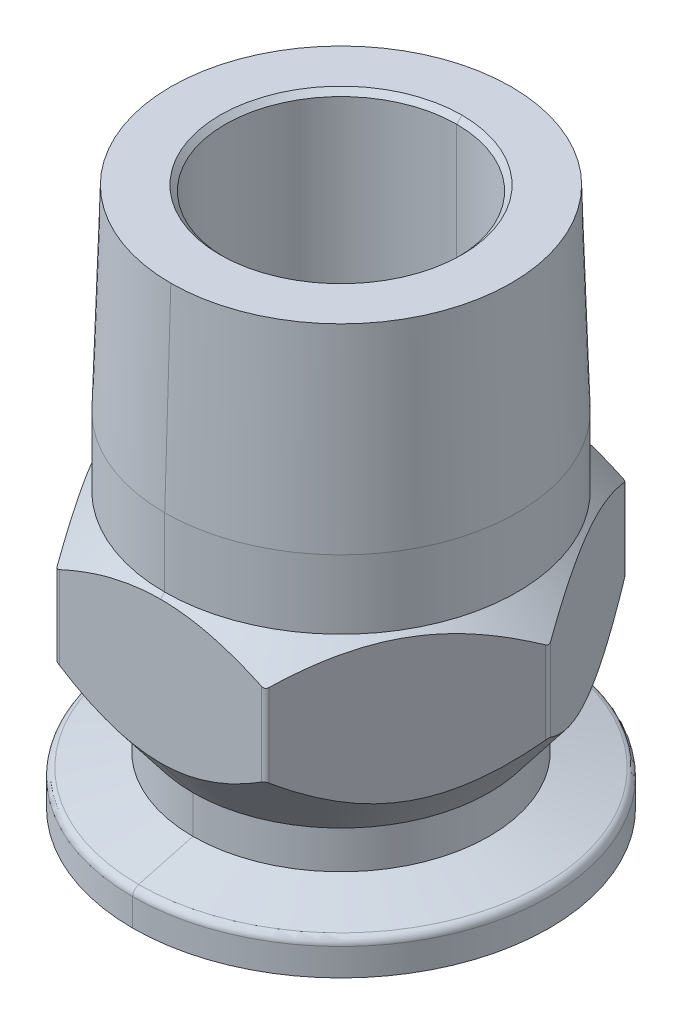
ISO-10303-21;
HEADER;
FILE_DESCRIPTION(('STEP AP214'),'2;1');
FILE_NAME('part.step','',(''),(''),'','','');
FILE_SCHEMA(('AUTOMOTIVE_DESIGN { 1 0 10303 214 1 1 1 1 }'));
ENDSEC;
DATA;
#1=APPLICATION_CONTEXT('core data for automotive mechanical design processes');
#2=APPLICATION_PROTOCOL_DEFINITION('international standard','automotive_design',2000,#1);
#3=PRODUCT_CONTEXT('',#1,'mechanical');
#4=PRODUCT('Part','Part','',(#3));
#5=PRODUCT_RELATED_PRODUCT_CATEGORY('part','',(#4));
#6=PRODUCT_DEFINITION_FORMATION('','',#4);
#7=PRODUCT_DEFINITION_CONTEXT('part definition',#1,'design');
#8=PRODUCT_DEFINITION('design','',#6,#7);
#9=PRODUCT_DEFINITION_SHAPE('','',#8);
#10=(LENGTH_UNIT() NAMED_UNIT(*) SI_UNIT(.MILLI.,.METRE.));
#11=(NAMED_UNIT(*) PLANE_ANGLE_UNIT() SI_UNIT($,.RADIAN.));
#12=(NAMED_UNIT(*) SI_UNIT($,.STERADIAN.) SOLID_ANGLE_UNIT());
#13=UNCERTAINTY_MEASURE_WITH_UNIT(LENGTH_MEASURE(1.E-05),#10,'distance_accuracy_value','');
#14=(GEOMETRIC_REPRESENTATION_CONTEXT(3) GLOBAL_UNCERTAINTY_ASSIGNED_CONTEXT((#13)) GLOBAL_UNIT_ASSIGNED_CONTEXT((#10,
#11,#12)) REPRESENTATION_CONTEXT('',''));
#15=CARTESIAN_POINT('',(0.,0.,0.));
#16=DIRECTION('',(0.,0.,1.));
#17=DIRECTION('',(1.,0.,0.));
#18=AXIS2_PLACEMENT_3D('',#15,#16,#17);
#19=CARTESIAN_POINT('',(0.,51.308,0.));
#20=DIRECTION('',(0.,1.,0.));
#21=DIRECTION('',(0.,0.,1.));
#22=AXIS2_PLACEMENT_3D('',#19,#20,#21);
#23=CONICAL_SURFACE('',#22,11.1125,0.785398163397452);
#24=CARTESIAN_POINT('',(0.,51.308,0.));
#25=DIRECTION('',(0.,1.,0.));
#26=DIRECTION('',(0.,0.,-1.));
#27=AXIS2_PLACEMENT_3D('',#24,#25,#26);
#28=CIRCLE('',#27,11.1125);
#29=CARTESIAN_POINT('',(0.,51.308,-11.1125));
#30=VERTEX_POINT('',#29);
#31=CARTESIAN_POINT('',(0.,51.308,11.1125));
#32=VERTEX_POINT('',#31);
#33=EDGE_CURVE('E11',#30,#32,#28,.T.);
#34=ORIENTED_EDGE('',*,*,#33,.F.);
#35=DIRECTION('',(0.,0.707106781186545,-0.70710678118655));
#36=VECTOR('',#35,1.);
#37=CARTESIAN_POINT('',(0.,51.308,-11.1125));
#38=LINE('',#37,#36);
#39=CARTESIAN_POINT('',(0.,51.816,-11.6205));
#40=VERTEX_POINT('',#39);
#41=EDGE_CURVE('E744',#30,#40,#38,.T.);
#42=ORIENTED_EDGE('',*,*,#41,.T.);
#43=CARTESIAN_POINT('',(0.,51.816,0.));
#44=DIRECTION('',(0.,-1.,0.));
#45=DIRECTION('',(0.,0.,-1.));
#46=AXIS2_PLACEMENT_3D('',#43,#44,#45);
#47=CIRCLE('',#46,11.6205);
#48=CARTESIAN_POINT('',(0.,51.816,11.6205));
#49=VERTEX_POINT('',#48);
#50=EDGE_CURVE('E628',#49,#40,#47,.T.);
#51=ORIENTED_EDGE('',*,*,#50,.F.);
#52=DIRECTION('',(0.,0.707106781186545,0.70710678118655));
#53=VECTOR('',#52,1.);
#54=CARTESIAN_POINT('',(0.,51.308,11.1125));
#55=LINE('',#54,#53);
#56=EDGE_CURVE('E671',#32,#49,#55,.T.);
#57=ORIENTED_EDGE('',*,*,#56,.F.);
#58=EDGE_LOOP('',(#34,#42,#51,#57));
#59=FACE_BOUND('',#58,.T.);
#60=ADVANCED_FACE('F16',(#59),#23,.F.);
#61=CARTESIAN_POINT('',(0.,2.61529683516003,0.));
#62=DIRECTION('',(0.,1.,0.));
#63=DIRECTION('',(0.,0.,1.));
#64=AXIS2_PLACEMENT_3D('',#61,#62,#63);
#65=TOROIDAL_SURFACE('',#64,19.238,0.762);
#66=CARTESIAN_POINT('',(0.,2.61529683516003,0.));
#67=DIRECTION('',(0.,-1.,0.));
#68=DIRECTION('',(0.,0.,1.));
#69=AXIS2_PLACEMENT_3D('',#66,#67,#68);
#70=CIRCLE('',#69,20.);
#71=CARTESIAN_POINT('',(0.,2.61529683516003,-20.));
#72=VERTEX_POINT('',#71);
#73=CARTESIAN_POINT('',(0.,2.61529683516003,20.));
#74=VERTEX_POINT('',#73);
#75=EDGE_CURVE('E805',#72,#74,#70,.T.);
#76=ORIENTED_EDGE('',*,*,#75,.F.);
#77=CARTESIAN_POINT('',(0.,2.61529683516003,-19.238));
#78=DIRECTION('',(1.,0.,0.));
#79=DIRECTION('',(0.,0.,-1.));
#80=AXIS2_PLACEMENT_3D('',#77,#78,#79);
#81=CIRCLE('',#80,0.762);
#82=CARTESIAN_POINT('',(0.,3.3513323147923,-19.4352201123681));
#83=VERTEX_POINT('',#82);
#84=EDGE_CURVE('E855',#72,#83,#81,.T.);
#85=ORIENTED_EDGE('',*,*,#84,.T.);
#86=CARTESIAN_POINT('',(0.,3.3513323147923,0.));
#87=DIRECTION('',(0.,1.,0.));
#88=DIRECTION('',(0.,0.,1.));
#89=AXIS2_PLACEMENT_3D('',#86,#87,#88);
#90=CIRCLE('',#89,19.4352201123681);
#91=CARTESIAN_POINT('',(0.,3.3513323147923,19.4352201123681));
#92=VERTEX_POINT('',#91);
#93=EDGE_CURVE('E713',#92,#83,#90,.T.);
#94=ORIENTED_EDGE('',*,*,#93,.F.);
#95=CARTESIAN_POINT('',(0.,2.61529683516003,19.238));
#96=DIRECTION('',(-1.,0.,0.));
#97=DIRECTION('',(0.,0.,1.));
#98=AXIS2_PLACEMENT_3D('',#95,#96,#97);
#99=CIRCLE('',#98,0.762);
#100=EDGE_CURVE('E778',#74,#92,#99,.T.);
#101=ORIENTED_EDGE('',*,*,#100,.F.);
#102=EDGE_LOOP('',(#76,#85,#94,#101));
#103=FACE_BOUND('',#102,.T.);
#104=ADVANCED_FACE('F908',(#103),#65,.T.);
#105=CARTESIAN_POINT('',(0.,8.382,0.));
#106=DIRECTION('',(0.,1.,0.));
#107=DIRECTION('',(0.,0.,1.));
#108=AXIS2_PLACEMENT_3D('',#105,#106,#107);
#109=CONICAL_SURFACE('',#108,14.224,0.658161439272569);
#110=CARTESIAN_POINT('',(0.,8.382,0.));
#111=DIRECTION('',(0.,-1.,0.));
#112=DIRECTION('',(0.,0.,-1.));
#113=AXIS2_PLACEMENT_3D('',#110,#111,#112);
#114=CIRCLE('',#113,14.224);
#115=CARTESIAN_POINT('',(0.,8.382,-14.224));
#116=VERTEX_POINT('',#115);
#117=CARTESIAN_POINT('',(0.,8.382,14.224));
#118=VERTEX_POINT('',#117);
#119=EDGE_CURVE('E532',#116,#118,#114,.T.);
#120=ORIENTED_EDGE('',*,*,#119,.F.);
#121=DIRECTION('',(0.,0.791118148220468,-0.611663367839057));
#122=VECTOR('',#121,1.);
#123=CARTESIAN_POINT('',(0.,8.382,-14.224));
#124=LINE('',#123,#122);
#125=CARTESIAN_POINT('',(0.,12.4063772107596,-17.3355));
#126=VERTEX_POINT('',#125);
#127=EDGE_CURVE('E521',#116,#126,#124,.T.);
#128=ORIENTED_EDGE('',*,*,#127,.T.);
#129=CARTESIAN_POINT('',(0.,12.4063772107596,-17.3355));
#130=CARTESIAN_POINT('',(0.21459913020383,12.4063407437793,-17.3354904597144));
#131=CARTESIAN_POINT('',(0.429194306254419,12.4114844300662,-17.3354645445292));
#132=CARTESIAN_POINT('',(0.858010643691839,12.432011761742,-17.3354174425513));
#133=CARTESIAN_POINT('',(1.07223154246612,12.4474009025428,-17.3353962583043));
#134=CARTESIAN_POINT('',(1.50087836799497,12.488411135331,-17.3353961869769));
#135=CARTESIAN_POINT('',(1.71529893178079,12.514088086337,-17.335417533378));
#136=CARTESIAN_POINT('',(2.144927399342,12.5756082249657,-17.3354685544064));
#137=CARTESIAN_POINT('',(2.36012062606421,12.611553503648,-17.335498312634));
#138=CARTESIAN_POINT('',(2.78386646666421,12.6920651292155,-17.3355016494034));
#139=CARTESIAN_POINT('',(2.99245955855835,12.7364193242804,-17.3354764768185));
#140=CARTESIAN_POINT('',(3.40983548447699,12.8343655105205,-17.3354392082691));
#141=CARTESIAN_POINT('',(3.6185961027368,12.8880519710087,-17.335427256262));
#142=CARTESIAN_POINT('',(4.03677983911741,13.0046282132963,-17.3354298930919));
#143=CARTESIAN_POINT('',(4.24616888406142,13.0676398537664,-17.3354448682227));
#144=CARTESIAN_POINT('',(4.66607078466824,13.2028379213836,-17.3354788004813));
#145=CARTESIAN_POINT('',(4.87653740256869,13.2751675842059,-17.3354978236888));
#146=CARTESIAN_POINT('',(5.28373821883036,13.423430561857,-17.3355020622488));
#147=CARTESIAN_POINT('',(5.48061401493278,13.4989763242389,-17.3354889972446));
#148=CARTESIAN_POINT('',(5.87514330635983,13.6577413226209,-17.3354711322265));
#149=CARTESIAN_POINT('',(6.07275297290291,13.7410693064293,-17.3354664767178));
#150=CARTESIAN_POINT('',(6.46905495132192,13.9153858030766,-17.3354687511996));
#151=CARTESIAN_POINT('',(6.66769630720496,14.006489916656,-17.3354759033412));
#152=CARTESIAN_POINT('',(7.06635237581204,14.1963520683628,-17.3354909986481));
#153=CARTESIAN_POINT('',(7.26631002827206,14.2952297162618,-17.3354989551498));
#154=CARTESIAN_POINT('',(7.65171250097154,14.4923802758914,-17.3355009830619));
#155=CARTESIAN_POINT('',(7.8373162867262,14.59034316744,-17.3354958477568));
#156=CARTESIAN_POINT('',(8.20973502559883,14.7926193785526,-17.3354894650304));
#157=CARTESIAN_POINT('',(8.39650287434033,14.8970193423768,-17.3354882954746));
#158=CARTESIAN_POINT('',(8.77142943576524,15.1121652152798,-17.3354894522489));
#159=CARTESIAN_POINT('',(8.95953867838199,15.2229971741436,-17.3354918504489));
#160=CARTESIAN_POINT('',(9.33731747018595,15.4510158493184,-17.335496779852));
#161=CARTESIAN_POINT('',(9.5269358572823,15.5682873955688,-17.3354993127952));
#162=CARTESIAN_POINT('',(9.71536165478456,15.6874281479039,-17.3355));
#163=B_SPLINE_CURVE_WITH_KNOTS('',3,(#129,#130,#131,#132,#133,#134,#135,#136,#137,#138,#139,
#140,#141,#142,#143,#144,#145,#146,#147,#148,#149,#150,#151,#152,#153,#154,#155,#156,#157,#158,
#159,#160,#161,#162),.UNSPECIFIED.,.F.,.F.,(4,2,2,2,2,2,2,2,2,2,2,2,2,2,2,2,4),(0.,
0.643728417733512,1.28780239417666,1.93542190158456,2.58971880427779,3.22929527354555,
3.87576948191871,4.53159204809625,5.19907776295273,5.83157999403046,6.47485105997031,
7.13036319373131,7.7994800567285,8.42902801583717,9.07086742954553,9.72581255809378,
10.394611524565),.UNSPECIFIED.);
#164=CARTESIAN_POINT('',(9.71536165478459,15.6874281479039,-17.3355));
#165=VERTEX_POINT('',#164);
#166=EDGE_CURVE('E528',#126,#165,#163,.T.);
#167=ORIENTED_EDGE('',*,*,#166,.T.);
#168=CARTESIAN_POINT('',(9.71536165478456,15.6874281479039,-17.3355));
#169=CARTESIAN_POINT('',(9.72056112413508,15.6907160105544,-17.3355000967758));
#170=CARTESIAN_POINT('',(9.72580261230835,15.6939381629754,-17.3354166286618));
#171=CARTESIAN_POINT('',(9.7362932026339,15.7001980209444,-17.3350780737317));
#172=CARTESIAN_POINT('',(9.74154124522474,15.703237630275,-17.3348253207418));
#173=CARTESIAN_POINT('',(9.75204473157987,15.709132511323,-17.3341482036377));
#174=CARTESIAN_POINT('',(9.7572993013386,15.71198958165,-17.3337259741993));
#175=CARTESIAN_POINT('',(9.76781529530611,15.7175194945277,-17.3327100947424));
#176=CARTESIAN_POINT('',(9.77307603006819,15.7201939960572,-17.3321183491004));
#177=CARTESIAN_POINT('',(9.78360389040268,15.7253589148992,-17.3307636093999));
#178=CARTESIAN_POINT('',(9.78887049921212,15.7278508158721,-17.3300022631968));
#179=CARTESIAN_POINT('',(9.79940961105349,15.7326507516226,-17.3283085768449));
#180=CARTESIAN_POINT('',(9.80468175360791,15.7349600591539,-17.3273776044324));
#181=CARTESIAN_POINT('',(9.81523149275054,15.7393949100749,-17.3253447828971));
#182=CARTESIAN_POINT('',(9.82050886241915,15.7415214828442,-17.3242440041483));
#183=CARTESIAN_POINT('',(9.83106846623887,15.7455915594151,-17.3218722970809));
#184=CARTESIAN_POINT('',(9.8363505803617,15.7475358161,-17.3206021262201));
#185=CARTESIAN_POINT('',(9.8472671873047,15.7513616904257,-17.3178010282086));
#186=CARTESIAN_POINT('',(9.85290287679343,15.7532316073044,-17.3162587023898));
#187=CARTESIAN_POINT('',(9.86408251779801,15.7567188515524,-17.3129958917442));
#188=CARTESIAN_POINT('',(9.86962631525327,15.758340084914,-17.3112790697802));
#189=CARTESIAN_POINT('',(9.88062143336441,15.761330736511,-17.3076683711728));
#190=CARTESIAN_POINT('',(9.88607283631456,15.7627037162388,-17.305777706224));
#191=CARTESIAN_POINT('',(9.89688250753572,15.7651981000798,-17.3018199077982));
#192=CARTESIAN_POINT('',(9.90224104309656,15.766322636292,-17.2997554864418));
#193=CARTESIAN_POINT('',(9.91286436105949,15.7683206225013,-17.2954509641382));
#194=CARTESIAN_POINT('',(9.91812952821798,15.7691966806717,-17.2932130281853));
#195=CARTESIAN_POINT('',(9.92856558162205,15.7706982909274,-17.2885622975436));
#196=CARTESIAN_POINT('',(9.93373688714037,15.7713258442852,-17.2861510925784));
#197=CARTESIAN_POINT('',(9.9439847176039,15.7723309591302,-17.2811545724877));
#198=CARTESIAN_POINT('',(9.94906160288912,15.7727098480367,-17.2785702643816));
#199=CARTESIAN_POINT('',(9.95912040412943,15.7732187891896,-17.2732286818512));
#200=CARTESIAN_POINT('',(9.96410252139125,15.773349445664,-17.2704718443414));
#201=CARTESIAN_POINT('',(9.97396390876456,15.773360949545,-17.2647888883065));
#202=CARTESIAN_POINT('',(9.97884326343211,15.7732420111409,-17.2618629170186));
#203=CARTESIAN_POINT('',(9.98850376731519,15.7727539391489,-17.2558386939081));
#204=CARTESIAN_POINT('',(9.99328454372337,15.7723839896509,-17.2527399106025));
#205=CARTESIAN_POINT('',(10.0027480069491,15.7713951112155,-17.2463710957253));
#206=CARTESIAN_POINT('',(10.007429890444,15.7707746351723,-17.2431001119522));
#207=CARTESIAN_POINT('',(10.0166955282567,15.7692853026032,-17.2363874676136));
#208=CARTESIAN_POINT('',(10.0212779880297,15.768414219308,-17.2329445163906));
#209=CARTESIAN_POINT('',(10.0303448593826,15.7664243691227,-17.2258885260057));
#210=CARTESIAN_POINT('',(10.0348274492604,15.7653027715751,-17.222273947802));
#211=CARTESIAN_POINT('',(10.0436946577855,15.762812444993,-17.2148751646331));
#212=CARTESIAN_POINT('',(10.0480769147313,15.761440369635,-17.2110892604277));
#213=CARTESIAN_POINT('',(10.0567436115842,15.7584496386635,-17.2033482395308));
#214=CARTESIAN_POINT('',(10.0610251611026,15.7568272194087,-17.19939134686));
#215=CARTESIAN_POINT('',(10.0694903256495,15.7533359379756,-17.1913085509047));
#216=CARTESIAN_POINT('',(10.0736705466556,15.7514629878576,-17.1871808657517));
#217=CARTESIAN_POINT('',(10.0816022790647,15.7476320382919,-17.1790951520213));
#218=CARTESIAN_POINT('',(10.0853644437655,15.7456859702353,-17.1751418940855));
#219=CARTESIAN_POINT('',(10.0927380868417,15.7416114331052,-17.1671556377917));
#220=CARTESIAN_POINT('',(10.0963489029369,15.7394822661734,-17.1631223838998));
#221=CARTESIAN_POINT('',(10.1034197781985,15.7350416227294,-17.154976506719));
#222=CARTESIAN_POINT('',(10.1068788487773,15.7327291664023,-17.1508635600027));
#223=CARTESIAN_POINT('',(10.1136465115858,15.7279222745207,-17.1425586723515));
#224=CARTESIAN_POINT('',(10.1169537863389,15.7254266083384,-17.1383663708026));
#225=CARTESIAN_POINT('',(10.123418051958,15.7202535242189,-17.12990310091));
#226=CARTESIAN_POINT('',(10.1265733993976,15.7175746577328,-17.1256317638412));
#227=CARTESIAN_POINT('',(10.1327340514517,15.7120353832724,-17.117010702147));
#228=CARTESIAN_POINT('',(10.135737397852,15.7091733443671,-17.1126606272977));
#229=CARTESIAN_POINT('',(10.141594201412,15.7032679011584,-17.1038823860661));
#230=CARTESIAN_POINT('',(10.1444454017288,15.7002227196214,-17.0994539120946));
#231=CARTESIAN_POINT('',(10.1499983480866,15.6939511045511,-17.0905189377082));
#232=CARTESIAN_POINT('',(10.1526975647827,15.6907227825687,-17.0860121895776));
#233=CARTESIAN_POINT('',(10.1553025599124,15.6874281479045,-17.0814999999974));
#234=B_SPLINE_CURVE_WITH_KNOTS('',3,(#168,#169,#170,#171,#172,#173,#174,#175,#176,#177,#178,
#179,#180,#181,#182,#183,#184,#185,#186,#187,#188,#189,#190,#191,#192,#193,#194,#195,#196,#197,
#198,#199,#200,#201,#202,#203,#204,#205,#206,#207,#208,#209,#210,#211,#212,#213,#214,#215,#216,
#217,#218,#219,#220,#221,#222,#223,#224,#225,#226,#227,#228,#229,#230,#231,#232,#233),
.UNSPECIFIED.,.F.,.F.,(4,2,2,2,2,2,2,2,2,2,2,2,2,2,2,2,2,2,2,2,2,2,2,2,2,2,2,2,2,2,2,2,4),(0.,
0.0184548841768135,0.036660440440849,0.0546435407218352,0.0724320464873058,0.0900547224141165,
0.107541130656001,0.124921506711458,0.142226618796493,0.160624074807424,0.178693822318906,
0.196479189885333,0.214025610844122,0.231380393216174,0.248592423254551,0.265711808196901,
0.282789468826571,0.299852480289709,0.316971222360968,0.334197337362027,0.35158150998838,
0.369173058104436,0.387019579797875,0.405166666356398,0.423657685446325,0.44103413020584,
0.458480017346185,0.476026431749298,0.493703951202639,0.511542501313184,0.529571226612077,
0.547818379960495,0.5663112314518),.UNSPECIFIED.);
#235=CARTESIAN_POINT('',(10.1553025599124,15.6874281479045,-17.0814999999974));
#236=VERTEX_POINT('',#235);
#237=EDGE_CURVE('E558',#165,#236,#234,.T.);
#238=ORIENTED_EDGE('',*,*,#237,.T.);
#239=CARTESIAN_POINT('',(10.1553025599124,15.6874281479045,-17.0814999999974));
#240=CARTESIAN_POINT('',(10.2490992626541,15.5688129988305,-16.9190380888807));
#241=CARTESIAN_POINT('',(10.3434858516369,15.4520510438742,-16.7555515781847));
#242=CARTESIAN_POINT('',(10.5315400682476,15.2249888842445,-16.429824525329));
#243=CARTESIAN_POINT('',(10.6251824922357,15.1146051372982,-16.2676276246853));
#244=CARTESIAN_POINT('',(10.811832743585,14.9002933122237,-15.9443395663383));
#245=CARTESIAN_POINT('',(10.9048161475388,14.7962805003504,-15.7832905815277));
#246=CARTESIAN_POINT('',(11.0902334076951,14.5947152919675,-15.4621489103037));
#247=CARTESIAN_POINT('',(11.1826440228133,14.4970775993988,-15.30209639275));
#248=CARTESIAN_POINT('',(11.3737231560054,14.3013647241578,-14.9711294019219));
#249=CARTESIAN_POINT('',(11.4724589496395,14.2035538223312,-14.8000971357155));
#250=CARTESIAN_POINT('',(11.6693252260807,14.015620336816,-14.4590865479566));
#251=CARTESIAN_POINT('',(11.7674282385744,13.9253830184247,-14.2891557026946));
#252=CARTESIAN_POINT('',(11.9631698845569,13.7525948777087,-13.9501210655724));
#253=CARTESIAN_POINT('',(12.0607838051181,13.6699331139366,-13.7810596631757));
#254=CARTESIAN_POINT('',(12.2556818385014,13.512294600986,-13.4435200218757));
#255=CARTESIAN_POINT('',(12.352944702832,13.4372133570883,-13.2750783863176));
#256=CARTESIAN_POINT('',(12.554726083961,13.2892385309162,-12.9255699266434));
#257=CARTESIAN_POINT('',(12.6593209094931,13.2167683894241,-12.7443672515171));
#258=CARTESIAN_POINT('',(12.8680119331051,13.0811640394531,-12.3828382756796));
#259=CARTESIAN_POINT('',(12.972085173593,13.0178893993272,-12.2025515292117));
#260=CARTESIAN_POINT('',(13.1799638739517,12.9006614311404,-11.8424946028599));
#261=CARTESIAN_POINT('',(13.2837520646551,12.8465882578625,-11.6627535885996));
#262=CARTESIAN_POINT('',(13.4912666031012,12.7477432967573,-11.3034003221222));
#263=CARTESIAN_POINT('',(13.5949816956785,12.7028780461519,-11.1238073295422));
#264=CARTESIAN_POINT('',(13.8065821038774,12.6208347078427,-10.7572917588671));
#265=CARTESIAN_POINT('',(13.914494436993,12.5839495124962,-10.5703189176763));
#266=CARTESIAN_POINT('',(14.1299495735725,12.520615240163,-10.1970362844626));
#267=CARTESIAN_POINT('',(14.2374845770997,12.4940617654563,-10.0107397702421));
#268=CARTESIAN_POINT('',(14.4524940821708,12.4513514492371,-9.63833348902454));
#269=CARTESIAN_POINT('',(14.5599655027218,12.4351368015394,-9.45222859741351));
#270=CARTESIAN_POINT('',(14.7751110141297,12.41305379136,-9.07969265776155));
#271=CARTESIAN_POINT('',(14.8827849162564,12.4071783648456,-8.89326191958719));
#272=CARTESIAN_POINT('',(15.0985016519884,12.4057249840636,-8.51962646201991));
#273=CARTESIAN_POINT('',(15.2065443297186,12.4101863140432,-8.33242149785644));
#274=CARTESIAN_POINT('',(15.4224485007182,12.4295382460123,-7.95835550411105));
#275=CARTESIAN_POINT('',(15.5303099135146,12.4444326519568,-7.77149462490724));
#276=CARTESIAN_POINT('',(15.7461718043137,12.4845977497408,-7.3976148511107));
#277=CARTESIAN_POINT('',(15.854169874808,12.5099241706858,-7.21060057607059));
#278=CARTESIAN_POINT('',(16.0705745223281,12.5708972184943,-6.83588244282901));
#279=CARTESIAN_POINT('',(16.1789738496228,12.6066474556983,-6.64819132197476));
#280=CARTESIAN_POINT('',(16.3914397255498,12.686567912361,-6.28019741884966));
#281=CARTESIAN_POINT('',(16.4955359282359,12.7304405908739,-6.09984684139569));
#282=CARTESIAN_POINT('',(16.7038313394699,12.8273994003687,-5.73899389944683));
#283=CARTESIAN_POINT('',(16.8080197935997,12.880578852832,-5.55851045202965));
#284=CARTESIAN_POINT('',(17.0167466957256,12.9961161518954,-5.1969901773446));
#285=CARTESIAN_POINT('',(17.1212687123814,13.0585947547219,-5.01598257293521));
#286=CARTESIAN_POINT('',(17.3308734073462,13.1927019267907,-4.65300437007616));
#287=CARTESIAN_POINT('',(17.4359333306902,13.2644727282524,-4.4710733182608));
#288=CARTESIAN_POINT('',(17.6399037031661,13.4121680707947,-4.11779462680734));
#289=CARTESIAN_POINT('',(17.7388766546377,13.4877556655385,-3.94634173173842));
#290=CARTESIAN_POINT('',(17.9372190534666,13.6466954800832,-3.60276595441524));
#291=CARTESIAN_POINT('',(18.0365664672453,13.7301581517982,-3.43068152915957));
#292=CARTESIAN_POINT('',(18.2358165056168,13.9048348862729,-3.08557493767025));
#293=CARTESIAN_POINT('',(18.3356935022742,13.9961665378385,-2.91259762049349));
#294=CARTESIAN_POINT('',(18.5361413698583,14.1865743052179,-2.56544281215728));
#295=CARTESIAN_POINT('',(18.6366832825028,14.2857721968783,-2.39131550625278));
#296=CARTESIAN_POINT('',(18.8306728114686,14.4838393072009,-2.05531999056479));
#297=CARTESIAN_POINT('',(18.9241985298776,14.5824059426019,-1.89331807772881));
#298=CARTESIAN_POINT('',(19.1118671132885,14.7859918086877,-1.56825334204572));
#299=CARTESIAN_POINT('',(19.2059859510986,14.8910998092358,-1.40523229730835));
#300=CARTESIAN_POINT('',(19.3949326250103,15.1077637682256,-1.07796943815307));
#301=CARTESIAN_POINT('',(19.4897352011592,15.219407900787,-0.91377152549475));
#302=CARTESIAN_POINT('',(19.6801332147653,15.4491532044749,-0.584002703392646));
#303=CARTESIAN_POINT('',(19.7757024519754,15.5673412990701,-0.418477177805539));
#304=CARTESIAN_POINT('',(19.8706642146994,15.6874281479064,-0.253999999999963));
#305=B_SPLINE_CURVE_WITH_KNOTS('',3,(#239,#240,#241,#242,#243,#244,#245,#246,#247,#248,#249,
#250,#251,#252,#253,#254,#255,#256,#257,#258,#259,#260,#261,#262,#263,#264,#265,#266,#267,#268,
#269,#270,#271,#272,#273,#274,#275,#276,#277,#278,#279,#280,#281,#282,#283,#284,#285,#286,#287,
#288,#289,#290,#291,#292,#293,#294,#295,#296,#297,#298,#299,#300,#301,#302,#303,#304),
.UNSPECIFIED.,.F.,.F.,(4,2,2,2,2,2,2,2,2,2,2,2,2,2,2,2,2,2,2,2,2,2,2,2,2,2,2,2,2,2,2,2,4),(0.,
0.665848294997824,1.31798844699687,1.95715764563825,2.58415792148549,3.24521373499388,
3.89303219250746,4.52892178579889,5.15429395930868,5.81839531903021,6.47094838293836,
7.11421426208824,7.75058702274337,8.40738161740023,9.05735562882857,9.70366289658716,
10.3495284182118,10.9978525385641,11.6464131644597,12.2984843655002,12.9572718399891,
13.5955028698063,14.2405445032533,14.8948422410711,15.5607070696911,16.196314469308,
16.8427637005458,17.5015580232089,18.1740894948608,18.8083465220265,19.4550753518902,
20.1151114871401,20.7892220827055),.UNSPECIFIED.);
#306=CARTESIAN_POINT('',(19.8706642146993,15.6874281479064,-0.254));
#307=VERTEX_POINT('',#306);
#308=EDGE_CURVE('E847',#236,#307,#305,.T.);
#309=ORIENTED_EDGE('',*,*,#308,.T.);
#310=CARTESIAN_POINT('',(19.8706642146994,15.6874281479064,-0.253999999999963));
#311=CARTESIAN_POINT('',(19.8732640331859,15.6907160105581,-0.249497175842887));
#312=CARTESIAN_POINT('',(19.8758124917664,15.6939381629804,-0.244916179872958));
#313=CARTESIAN_POINT('',(19.8807645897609,15.7001980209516,-0.235661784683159));
#314=CARTESIAN_POINT('',(19.8831697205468,15.703237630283,-0.230990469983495));
#315=CARTESIAN_POINT('',(19.8878350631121,15.7091325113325,-0.221555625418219));
#316=CARTESIAN_POINT('',(19.890096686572,15.71198958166,-0.216793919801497));
#317=CARTESIAN_POINT('',(19.8944749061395,15.7175194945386,-0.207178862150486));
#318=CARTESIAN_POINT('',(19.8965928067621,15.7201939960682,-0.20232705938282));
#319=CARTESIAN_POINT('',(19.9006834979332,15.7253589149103,-0.192532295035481));
#320=CARTESIAN_POINT('',(19.9026574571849,15.727850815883,-0.187590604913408));
#321=CARTESIAN_POINT('',(19.9064602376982,15.7326507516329,-0.177616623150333));
#322=CARTESIAN_POINT('',(19.9082900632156,15.7349600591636,-0.172585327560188));
#323=CARTESIAN_POINT('',(19.9118044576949,15.7393949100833,-0.162432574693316));
#324=CARTESIAN_POINT('',(19.9134898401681,15.7415214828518,-0.157311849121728));
#325=CARTESIAN_POINT('',(19.9167156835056,15.7455915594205,-0.146981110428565));
#326=CARTESIAN_POINT('',(19.9182567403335,15.7475358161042,-0.141771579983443));
#327=CARTESIAN_POINT('',(19.9212892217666,15.7513616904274,-0.130916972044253));
#328=CARTESIAN_POINT('',(19.92277137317,15.7532316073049,-0.125265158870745));
#329=CARTESIAN_POINT('',(19.9255355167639,15.7567188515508,-0.113951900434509));
#330=CARTESIAN_POINT('',(19.9268206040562,15.7583400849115,-0.108292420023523));
#331=CARTESIAN_POINT('',(19.9291912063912,15.761330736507,-0.096965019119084));
#332=CARTESIAN_POINT('',(19.9302795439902,15.7627037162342,-0.0912986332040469));
#333=CARTESIAN_POINT('',(19.9322568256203,15.7651981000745,-0.0799582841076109));
#334=CARTESIAN_POINT('',(19.9331482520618,15.7663226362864,-0.0742854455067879));
#335=CARTESIAN_POINT('',(19.9347320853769,15.7683206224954,-0.0629331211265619));
#336=CARTESIAN_POINT('',(19.935426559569,15.7691966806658,-0.0572543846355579));
#337=CARTESIAN_POINT('',(19.9366169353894,15.7706982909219,-0.0458911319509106));
#338=CARTESIAN_POINT('',(19.9371144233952,15.77132584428,-0.0402070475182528));
#339=CARTESIAN_POINT('',(19.9379112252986,15.772330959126,-0.0288339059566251));
#340=CARTESIAN_POINT('',(19.9382115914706,15.772709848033,-0.0231450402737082));
#341=CARTESIAN_POINT('',(19.9386150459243,15.7732187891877,-0.0117630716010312));
#342=CARTESIAN_POINT('',(19.9387186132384,15.773349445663,-0.00607001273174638));
#343=CARTESIAN_POINT('',(19.9387277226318,15.773360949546,0.00531167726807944));
#344=CARTESIAN_POINT('',(19.9386334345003,15.773242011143,0.0110003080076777));
#345=CARTESIAN_POINT('',(19.9382465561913,15.7727539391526,0.0223786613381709));
#346=CARTESIAN_POINT('',(19.9379533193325,15.7723839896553,0.0280683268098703));
#347=CARTESIAN_POINT('',(19.9371694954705,15.7713951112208,0.0394483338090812));
#348=CARTESIAN_POINT('',(19.9366776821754,15.7707746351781,0.0451384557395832));
#349=CARTESIAN_POINT('',(19.9354971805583,15.7692853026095,0.0565190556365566));
#350=CARTESIAN_POINT('',(19.9348067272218,15.7684142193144,0.0622090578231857));
#351=CARTESIAN_POINT('',(19.933229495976,15.7664243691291,0.0735891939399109));
#352=CARTESIAN_POINT('',(19.9323404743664,15.7653027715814,0.0792785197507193));
#353=CARTESIAN_POINT('',(19.9303665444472,15.7628124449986,0.0906571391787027));
#354=CARTESIAN_POINT('',(19.9292789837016,15.7614403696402,0.0963452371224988));
#355=CARTESIAN_POINT('',(19.9269084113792,15.7584496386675,0.107721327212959));
#356=CARTESIAN_POINT('',(19.9256224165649,15.7568272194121,0.113407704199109));
#357=CARTESIAN_POINT('',(19.9228550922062,15.7533359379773,0.124780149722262));
#358=CARTESIAN_POINT('',(19.921370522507,15.7514629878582,0.130464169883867));
#359=CARTESIAN_POINT('',(19.9183339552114,15.74763203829,0.141376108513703));
#360=CARTESIAN_POINT('',(19.9167914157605,15.7456859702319,0.146610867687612));
#361=CARTESIAN_POINT('',(19.9135619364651,15.7416114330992,0.156989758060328));
#362=CARTESIAN_POINT('',(19.9118744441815,15.7394822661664,0.162133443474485));
#363=CARTESIAN_POINT('',(19.9083553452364,15.7350416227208,0.172329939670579));
#364=CARTESIAN_POINT('',(19.9065229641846,15.7327291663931,0.177382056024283));
#365=CARTESIAN_POINT('',(19.9027145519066,15.7279222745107,0.187395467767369));
#366=CARTESIAN_POINT('',(19.9007375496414,15.7254266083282,0.192355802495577));
#367=CARTESIAN_POINT('',(19.8966402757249,15.7202535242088,0.202185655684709));
#368=CARTESIAN_POINT('',(19.8945188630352,15.7175746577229,0.2070539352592));
#369=CARTESIAN_POINT('',(19.8901331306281,15.7120353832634,0.216699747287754));
#370=CARTESIAN_POINT('',(19.8878675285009,15.7091733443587,0.221475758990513));
#371=CARTESIAN_POINT('',(19.8831937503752,15.7032679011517,0.230937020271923));
#372=CARTESIAN_POINT('',(19.8807841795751,15.7002227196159,0.235620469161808));
#373=CARTESIAN_POINT('',(19.8758227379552,15.6939511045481,0.244896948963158));
#374=CARTESIAN_POINT('',(19.873269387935,15.6907227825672,0.249487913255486));
#375=CARTESIAN_POINT('',(19.8706642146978,15.6874281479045,0.25400000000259));
#376=B_SPLINE_CURVE_WITH_KNOTS('',3,(#310,#311,#312,#313,#314,#315,#316,#317,#318,#319,#320,
#321,#322,#323,#324,#325,#326,#327,#328,#329,#330,#331,#332,#333,#334,#335,#336,#337,#338,#339,
#340,#341,#342,#343,#344,#345,#346,#347,#348,#349,#350,#351,#352,#353,#354,#355,#356,#357,#358,
#359,#360,#361,#362,#363,#364,#365,#366,#367,#368,#369,#370,#371,#372,#373,#374,#375),
.UNSPECIFIED.,.F.,.F.,(4,2,2,2,2,2,2,2,2,2,2,2,2,2,2,2,2,2,2,2,2,2,2,2,2,2,2,2,2,2,2,2,4),(0.,
0.0184548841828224,0.0366604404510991,0.0546435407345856,0.0724320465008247,0.0900547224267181,
0.10754113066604,0.124921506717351,0.142226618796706,0.160624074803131,0.178693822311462,
0.196479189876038,0.214025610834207,0.231380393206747,0.248592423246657,0.265711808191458,
0.282789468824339,0.299852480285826,0.316971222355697,0.334197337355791,0.351581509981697,
0.369173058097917,0.38701957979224,0.405166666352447,0.423657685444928,0.441034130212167,
0.458480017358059,0.476026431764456,0.493703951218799,0.511542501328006,0.529571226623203,
0.547818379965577,0.566311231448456),.UNSPECIFIED.);
#377=CARTESIAN_POINT('',(19.8706642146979,15.6874281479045,0.254000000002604));
#378=VERTEX_POINT('',#377);
#379=EDGE_CURVE('E547',#307,#378,#376,.T.);
#380=ORIENTED_EDGE('',*,*,#379,.T.);
#381=CARTESIAN_POINT('',(19.8706642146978,15.6874281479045,0.25400000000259));
#382=CARTESIAN_POINT('',(19.7768664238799,15.5688129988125,0.416461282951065));
#383=CARTESIAN_POINT('',(19.6824762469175,15.4520510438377,0.579945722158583));
#384=CARTESIAN_POINT('',(19.4944154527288,15.224988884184,0.905668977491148));
#385=CARTESIAN_POINT('',(19.4007700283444,15.1146051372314,1.06786414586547));
#386=CARTESIAN_POINT('',(19.2141194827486,14.9002933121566,1.39115203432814));
#387=CARTESIAN_POINT('',(19.12113867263,14.7962805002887,1.55220251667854));
#388=CARTESIAN_POINT('',(18.9357304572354,14.5947152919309,1.8733494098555));
#389=CARTESIAN_POINT('',(18.8433262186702,14.4970775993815,2.03340560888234));
#390=CARTESIAN_POINT('',(18.6522399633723,14.3013647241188,2.36436848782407));
#391=CARTESIAN_POINT('',(18.5534895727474,14.2035538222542,2.53539232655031));
#392=CARTESIAN_POINT('',(18.3565988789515,14.0156203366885,2.87638881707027));
#393=CARTESIAN_POINT('',(18.258485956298,13.9253830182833,3.04631394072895));
#394=CARTESIAN_POINT('',(18.0627441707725,13.7525948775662,3.38534849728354));
#395=CARTESIAN_POINT('',(17.9651396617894,13.6699331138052,3.55441533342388));
#396=CARTESIAN_POINT('',(17.7702707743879,13.5122946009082,3.8919718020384));
#397=CARTESIAN_POINT('',(17.6730274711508,13.437213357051,4.0604247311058));
#398=CARTESIAN_POINT('',(17.4712349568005,13.2892385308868,4.4099267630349));
#399=CARTESIAN_POINT('',(17.3666062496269,13.2167683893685,4.59110987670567));
#400=CARTESIAN_POINT('',(17.1578584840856,13.0811640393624,4.95260609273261));
#401=CARTESIAN_POINT('',(17.0537622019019,13.0178893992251,5.13287953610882));
#402=CARTESIAN_POINT('',(16.8458831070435,12.9006614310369,5.49293623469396));
#403=CARTESIAN_POINT('',(16.7421169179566,12.8465882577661,5.67268995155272));
#404=CARTESIAN_POINT('',(16.5346651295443,12.7477432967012,6.03207944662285));
#405=CARTESIAN_POINT('',(16.4309905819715,12.7028780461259,6.21169584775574));
#406=CARTESIAN_POINT('',(16.2193789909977,12.6208347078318,6.57820496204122));
#407=CARTESIAN_POINT('',(16.1114119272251,12.5839495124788,6.7651462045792));
#408=CARTESIAN_POINT('',(15.8958672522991,12.5206152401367,7.13837714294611));
#409=CARTESIAN_POINT('',(15.7882972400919,12.4940617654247,7.32465344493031));
#410=CARTESIAN_POINT('',(15.5732886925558,12.4513514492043,7.69706027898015));
#411=CARTESIAN_POINT('',(15.4658528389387,12.4351368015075,7.88318570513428));
#412=CARTESIAN_POINT('',(15.2508000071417,12.413053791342,8.25577515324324));
#413=CARTESIAN_POINT('',(15.1431832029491,12.4071783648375,8.44223885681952));
#414=CARTESIAN_POINT('',(14.9274637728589,12.4057249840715,8.81587275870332));
#415=CARTESIAN_POINT('',(14.8193608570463,12.410186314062,9.0030429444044));
#416=CARTESIAN_POINT('',(14.6033622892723,12.4295382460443,9.37705443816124));
#417=CARTESIAN_POINT('',(14.4954667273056,12.4444326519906,9.56389560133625));
#418=CARTESIAN_POINT('',(14.2796082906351,12.4845977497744,9.93777736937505));
#419=CARTESIAN_POINT('',(14.1716482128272,12.509924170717,10.1248135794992));
#420=CARTESIAN_POINT('',(13.9553351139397,12.5708972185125,10.4995845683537));
#421=CARTESIAN_POINT('',(13.8469894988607,12.6066474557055,10.6873066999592));
#422=CARTESIAN_POINT('',(13.6345303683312,12.6865679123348,11.0553044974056));
#423=CARTESIAN_POINT('',(13.5303902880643,12.7304405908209,11.2356297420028));
#424=CARTESIAN_POINT('',(13.3220301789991,12.8273994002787,11.5964453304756));
#425=CARTESIAN_POINT('',(13.2178211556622,12.8805788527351,11.7769169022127));
#426=CARTESIAN_POINT('',(13.0090988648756,12.9961161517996,12.1384398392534));
#427=CARTESIAN_POINT('',(12.904602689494,13.0585947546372,12.3194623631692));
#428=CARTESIAN_POINT('',(12.6950566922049,13.1927019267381,12.6824744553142));
#429=CARTESIAN_POINT('',(12.5900297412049,13.2644727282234,12.8644245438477));
#430=CARTESIAN_POINT('',(12.3860666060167,13.4121680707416,13.2177074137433));
#431=CARTESIAN_POINT('',(12.2870705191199,13.4877556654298,13.3891469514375));
#432=CARTESIAN_POINT('',(12.0886963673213,13.6466954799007,13.7327043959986));
#433=CARTESIAN_POINT('',(11.9893405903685,13.7301581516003,13.9047839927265));
#434=CARTESIAN_POINT('',(11.7900945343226,13.9048348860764,14.2498928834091));
#435=CARTESIAN_POINT('',(11.690230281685,13.9961665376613,14.4228775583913));
#436=CARTESIAN_POINT('',(11.489809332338,14.18657430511,14.7700479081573));
#437=CARTESIAN_POINT('',(11.3892816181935,14.2857721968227,14.9441834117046));
#438=CARTESIAN_POINT('',(11.1952957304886,14.4838393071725,15.2801810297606));
#439=CARTESIAN_POINT('',(11.1017608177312,14.5824059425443,15.4421776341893));
#440=CARTESIAN_POINT('',(10.9140807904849,14.785991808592,15.7672357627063));
#441=CARTESIAN_POINT('',(10.8199598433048,14.8910998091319,15.9302555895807));
#442=CARTESIAN_POINT('',(10.6310152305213,15.1077637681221,16.2575196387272));
#443=CARTESIAN_POINT('',(10.5362169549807,15.219407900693,16.4217200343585));
#444=CARTESIAN_POINT('',(10.3458277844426,15.4491532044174,16.7514939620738));
#445=CARTESIAN_POINT('',(10.2502630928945,15.5673412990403,16.9170221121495));
#446=CARTESIAN_POINT('',(10.1553025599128,15.687428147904,17.0814999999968));
#447=B_SPLINE_CURVE_WITH_KNOTS('',3,(#381,#382,#383,#384,#385,#386,#387,#388,#389,#390,#391,
#392,#393,#394,#395,#396,#397,#398,#399,#400,#401,#402,#403,#404,#405,#406,#407,#408,#409,#410,
#411,#412,#413,#414,#415,#416,#417,#418,#419,#420,#421,#422,#423,#424,#425,#426,#427,#428,#429,
#430,#431,#432,#433,#434,#435,#436,#437,#438,#439,#440,#441,#442,#443,#444,#445,#446),
.UNSPECIFIED.,.F.,.F.,(4,2,2,2,2,2,2,2,2,2,2,2,2,2,2,2,2,2,2,2,2,2,2,2,2,2,2,2,2,2,2,2,4),(0.,
0.665848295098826,1.31798844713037,1.95715764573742,2.58415792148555,3.24521373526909,
3.89303219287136,4.5289217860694,5.15429395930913,5.81839531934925,6.47094838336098,
7.11421426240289,7.75058702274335,8.40738161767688,9.05735562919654,9.70366289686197,
10.349528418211,10.9978525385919,11.6464131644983,12.2984843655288,12.9572718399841,
13.5955028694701,14.2405445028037,14.8948422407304,15.5607070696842,16.1963144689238,
16.8427637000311,17.5015580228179,18.174089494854,18.8083465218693,19.4550753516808,
20.1151114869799,20.7892220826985),.UNSPECIFIED.);
#448=CARTESIAN_POINT('',(10.1553025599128,15.6874281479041,17.0814999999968));
#449=VERTEX_POINT('',#448);
#450=EDGE_CURVE('E621',#378,#449,#447,.T.);
#451=ORIENTED_EDGE('',*,*,#450,.T.);
#452=CARTESIAN_POINT('',(10.1553025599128,15.687428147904,17.0814999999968));
#453=CARTESIAN_POINT('',(10.152702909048,15.6907160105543,17.0860029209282));
#454=CARTESIAN_POINT('',(10.1500098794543,15.6939381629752,17.0905004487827));
#455=CARTESIAN_POINT('',(10.1444713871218,15.700198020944,17.0994162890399));
#456=CARTESIAN_POINT('',(10.1416284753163,15.7032376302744,17.1038348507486));
#457=CARTESIAN_POINT('',(10.1357903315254,15.7091325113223,17.1125925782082));
#458=CARTESIAN_POINT('',(10.1327973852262,15.7119895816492,17.1169320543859));
#459=CARTESIAN_POINT('',(10.1266596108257,15.7175194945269,17.1255312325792));
#460=CARTESIAN_POINT('',(10.1235167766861,15.7201939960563,17.1297912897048));
#461=CARTESIAN_POINT('',(10.1170796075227,15.7253589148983,17.1382313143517));
#462=CARTESIAN_POINT('',(10.113786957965,15.7278508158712,17.1424116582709));
#463=CARTESIAN_POINT('',(10.1070506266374,15.7326507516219,17.1506919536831));
#464=CARTESIAN_POINT('',(10.1036083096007,15.7349600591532,17.1547922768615));
#465=CARTESIAN_POINT('',(10.0965729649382,15.7393949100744,17.1629122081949));
#466=CARTESIAN_POINT('',(10.0929809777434,15.7415214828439,17.1669321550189));
#467=CARTESIAN_POINT('',(10.0856472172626,15.7455915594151,17.1748911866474));
#468=CARTESIAN_POINT('',(10.0819061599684,15.7475358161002,17.1788305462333));
#469=CARTESIAN_POINT('',(10.0740220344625,15.751361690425,17.1868840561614));
#470=CARTESIAN_POINT('',(10.0698684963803,15.7532316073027,17.1909935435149));
#471=CARTESIAN_POINT('',(10.061452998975,15.7567188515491,17.1990439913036));
#472=CARTESIAN_POINT('',(10.0571942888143,15.75834008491,17.2029866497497));
#473=CARTESIAN_POINT('',(10.0485697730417,15.7613307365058,17.2107033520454));
#474=CARTESIAN_POINT('',(10.0442067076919,15.7627037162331,17.2144790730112));
#475=CARTESIAN_POINT('',(10.0353743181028,15.7651981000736,17.2218616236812));
#476=CARTESIAN_POINT('',(10.0309072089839,15.7663226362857,17.2254700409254));
#477=CARTESIAN_POINT('',(10.0218677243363,15.7683206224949,17.232517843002));
#478=CARTESIAN_POINT('',(10.0172970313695,15.7691966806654,17.2359586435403));
#479=CARTESIAN_POINT('',(10.0080513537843,15.7706982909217,17.2426711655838));
#480=CARTESIAN_POINT('',(10.0033775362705,15.7713258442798,17.2459440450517));
#481=CARTESIAN_POINT('',(9.99392650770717,15.7723309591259,17.2523206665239));
#482=CARTESIAN_POINT('',(9.98914998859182,15.772709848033,17.2554252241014));
#483=CARTESIAN_POINT('',(9.97949464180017,15.7732187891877,17.2614656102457));
#484=CARTESIAN_POINT('',(9.97461609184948,15.773349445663,17.2644018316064));
#485=CARTESIAN_POINT('',(9.96476381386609,15.7733609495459,17.2701005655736));
#486=CARTESIAN_POINT('',(9.95979017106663,15.773242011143,17.2728632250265));
#487=CARTESIAN_POINT('',(9.94974278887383,15.7727539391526,17.2782173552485));
#488=CARTESIAN_POINT('',(9.94466877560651,15.7723839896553,17.2808082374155));
#489=CARTESIAN_POINT('',(9.93442148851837,15.7713951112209,17.2858194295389));
#490=CARTESIAN_POINT('',(9.92924779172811,15.7707746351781,17.2882385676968));
#491=CARTESIAN_POINT('',(9.91880165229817,15.7692853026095,17.2929065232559));
#492=CARTESIAN_POINT('',(9.91352873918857,15.7684142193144,17.2951535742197));
#493=CARTESIAN_POINT('',(9.90288463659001,15.7664243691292,17.2994777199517));
#494=CARTESIAN_POINT('',(9.89751302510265,15.7653027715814,17.3015524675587));
#495=CARTESIAN_POINT('',(9.88667188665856,15.7628124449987,17.3055323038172));
#496=CARTESIAN_POINT('',(9.88120206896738,15.7614403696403,17.3074344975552));
#497=CARTESIAN_POINT('',(9.87016479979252,15.7584496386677,17.3110695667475));
#498=CARTESIAN_POINT('',(9.86459725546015,15.7568272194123,17.3127990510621));
#499=CARTESIAN_POINT('',(9.85336476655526,15.7533359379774,17.3160887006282));
#500=CARTESIAN_POINT('',(9.84769997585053,15.7514629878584,17.3176450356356));
#501=CARTESIAN_POINT('',(9.83673167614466,15.7476320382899,17.320471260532));
#502=CARTESIAN_POINT('',(9.83142697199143,15.7456859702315,17.3217527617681));
#503=CARTESIAN_POINT('',(9.82082384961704,15.7416114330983,17.3241453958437));
#504=CARTESIAN_POINT('',(9.81552554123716,15.7394822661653,17.3252558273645));
#505=CARTESIAN_POINT('',(9.80493556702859,15.7350416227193,17.3273064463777));
#506=CARTESIAN_POINT('',(9.79964411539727,15.7327291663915,17.3282456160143));
#507=CARTESIAN_POINT('',(9.78906804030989,15.7279222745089,17.329954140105));
#508=CARTESIAN_POINT('',(9.78378376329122,15.7254266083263,17.3307221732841));
#509=CARTESIAN_POINT('',(9.77322222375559,15.7202535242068,17.3320887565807));
#510=CARTESIAN_POINT('',(9.76794546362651,15.717574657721,17.3326856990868));
#511=CARTESIAN_POINT('',(9.75739907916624,15.7120353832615,17.3337104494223));
#512=CARTESIAN_POINT('',(9.7521301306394,15.7091733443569,17.3341363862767));
#513=CARTESIAN_POINT('',(9.74159954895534,15.7032679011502,17.3348194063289));
#514=CARTESIAN_POINT('',(9.73633877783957,15.7002227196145,17.3350743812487));
#515=CARTESIAN_POINT('',(9.72582438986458,15.693951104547,17.3354158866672));
#516=CARTESIAN_POINT('',(9.72057182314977,15.6907227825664,17.335500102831));
#517=CARTESIAN_POINT('',(9.7153616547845,15.6874281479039,17.3355));
#518=B_SPLINE_CURVE_WITH_KNOTS('',3,(#452,#453,#454,#455,#456,#457,#458,#459,#460,#461,#462,
#463,#464,#465,#466,#467,#468,#469,#470,#471,#472,#473,#474,#475,#476,#477,#478,#479,#480,#481,
#482,#483,#484,#485,#486,#487,#488,#489,#490,#491,#492,#493,#494,#495,#496,#497,#498,#499,#500,
#501,#502,#503,#504,#505,#506,#507,#508,#509,#510,#511,#512,#513,#514,#515,#516,#517),
.UNSPECIFIED.,.F.,.F.,(4,2,2,2,2,2,2,2,2,2,2,2,2,2,2,2,2,2,2,2,2,2,2,2,2,2,2,2,2,2,2,2,4),(0.,
0.0184548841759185,0.0366604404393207,0.0546435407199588,0.0724320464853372,0.0900547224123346,
0.107541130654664,0.124921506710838,0.14222661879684,0.160624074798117,0.178693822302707,
0.196479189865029,0.214025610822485,0.231380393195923,0.248592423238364,0.265711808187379,
0.282789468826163,0.299852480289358,0.316971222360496,0.334197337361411,0.35158150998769,
0.36917305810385,0.387019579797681,0.405166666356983,0.423657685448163,0.441034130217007,
0.458480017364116,0.476026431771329,0.493703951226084,0.511542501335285,0.529571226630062,
0.547818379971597,0.566311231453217),.UNSPECIFIED.);
#519=CARTESIAN_POINT('',(9.71536165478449,15.6874281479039,17.3355));
#520=VERTEX_POINT('',#519);
#521=EDGE_CURVE('E702',#449,#520,#518,.T.);
#522=ORIENTED_EDGE('',*,*,#521,.T.);
#523=CARTESIAN_POINT('',(9.7153616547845,15.6874281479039,17.3355));
#524=CARTESIAN_POINT('',(9.52694666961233,15.5682942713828,17.3354993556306));
#525=CARTESIAN_POINT('',(9.33733903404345,15.4510297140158,17.3354972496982));
#526=CARTESIAN_POINT('',(8.95957448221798,15.223020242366,17.3354933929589));
#527=CARTESIAN_POINT('',(8.77146863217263,15.1121906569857,17.3354916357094));
#528=CARTESIAN_POINT('',(8.39654175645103,14.897044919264,17.3354914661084));
#529=CARTESIAN_POINT('',(8.2097701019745,14.7926428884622,17.3354929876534));
#530=CARTESIAN_POINT('',(7.83733729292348,14.5903571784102,17.3354983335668));
#531=CARTESIAN_POINT('',(7.6517231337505,14.4923870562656,17.3355021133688));
#532=CARTESIAN_POINT('',(7.26633205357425,14.295239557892,17.3354977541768));
#533=CARTESIAN_POINT('',(7.06639659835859,14.1963713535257,17.3354888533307));
#534=CARTESIAN_POINT('',(6.66776983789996,14.0065217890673,17.3354739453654));
#535=CARTESIAN_POINT('',(6.46913540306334,13.9154212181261,17.3354678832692));
#536=CARTESIAN_POINT('',(6.07283287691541,13.7411050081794,17.3354678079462));
#537=CARTESIAN_POINT('',(5.87521554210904,13.6577742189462,17.3354735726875));
#538=CARTESIAN_POINT('',(5.48065729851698,13.4989958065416,17.3354913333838));
#539=CARTESIAN_POINT('',(5.28376001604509,13.4234399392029,17.3355032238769));
#540=CARTESIAN_POINT('',(4.87656042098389,13.2751744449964,17.3354965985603));
#541=CARTESIAN_POINT('',(4.66611708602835,13.2028507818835,17.3354763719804));
#542=CARTESIAN_POINT('',(4.24624597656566,13.0676607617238,17.3354425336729));
#543=CARTESIAN_POINT('',(4.03686426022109,13.0046517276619,17.3354288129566));
#544=CARTESIAN_POINT('',(3.61868010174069,12.8880758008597,17.3354286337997));
#545=CARTESIAN_POINT('',(3.4099115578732,12.8343876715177,17.3354417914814));
#546=CARTESIAN_POINT('',(2.99250515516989,12.7364323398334,17.3354790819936));
#547=CARTESIAN_POINT('',(2.78388935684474,12.6920713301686,17.3355030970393));
#548=CARTESIAN_POINT('',(2.36013232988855,12.6115538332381,17.3354968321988));
#549=CARTESIAN_POINT('',(2.14495091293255,12.5756079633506,17.3354652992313));
#550=CARTESIAN_POINT('',(1.71533813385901,12.5140872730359,17.3354129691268));
#551=CARTESIAN_POINT('',(1.50092140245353,12.4884106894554,17.3353920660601));
#552=CARTESIAN_POINT('',(1.07227452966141,12.4474006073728,17.3353934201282));
#553=CARTESIAN_POINT('',(0.858049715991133,12.4320116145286,17.3354154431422));
#554=CARTESIAN_POINT('',(0.429217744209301,12.4114842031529,17.3354639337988));
#555=CARTESIAN_POINT('',(0.214610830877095,12.4063406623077,17.3354903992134));
#556=CARTESIAN_POINT('',(0.,12.4063772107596,17.3355));
#557=B_SPLINE_CURVE_WITH_KNOTS('',3,(#523,#524,#525,#526,#527,#528,#529,#530,#531,#532,#533,
#534,#535,#536,#537,#538,#539,#540,#541,#542,#543,#544,#545,#546,#547,#548,#549,#550,#551,#552,
#553,#554,#555,#556),.UNSPECIFIED.,.F.,.F.,(4,2,2,2,2,2,2,2,2,2,2,2,2,2,2,2,4),(0.,
0.668760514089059,1.32369325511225,1.96554568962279,2.59513131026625,3.26417590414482,
3.91966469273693,4.56296027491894,5.19553357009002,5.8629473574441,6.51874654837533,
7.16524510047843,7.8048924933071,8.45915471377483,9.10676258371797,9.75084825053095,
10.3946118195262),.UNSPECIFIED.);
#558=CARTESIAN_POINT('',(0.,12.4063772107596,17.3355));
#559=VERTEX_POINT('',#558);
#560=EDGE_CURVE('E734',#520,#559,#557,.T.);
#561=ORIENTED_EDGE('',*,*,#560,.T.);
#562=DIRECTION('',(0.,0.791118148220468,0.611663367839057));
#563=VECTOR('',#562,1.);
#564=CARTESIAN_POINT('',(0.,8.382,14.224));
#565=LINE('',#564,#563);
#566=EDGE_CURVE('E543',#118,#559,#565,.T.);
#567=ORIENTED_EDGE('',*,*,#566,.F.);
#568=EDGE_LOOP('',(#120,#128,#167,#238,#309,#380,#451,#522,#561,#567));
#569=FACE_BOUND('',#568,.T.);
#570=ADVANCED_FACE('F527',(#569),#109,.T.);
#571=CARTESIAN_POINT('',(0.,23.495,0.));
#572=DIRECTION('',(0.,-1.,0.));
#573=DIRECTION('',(0.,0.,-1.));
#574=AXIS2_PLACEMENT_3D('',#571,#572,#573);
#575=CONICAL_SURFACE('',#574,20.0173111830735,0.813216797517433);
#576=CARTESIAN_POINT('',(0.,26.416,0.));
#577=DIRECTION('',(0.,-1.,0.));
#578=DIRECTION('',(0.,0.,-1.));
#579=AXIS2_PLACEMENT_3D('',#576,#577,#578);
#580=CIRCLE('',#579,16.9291);
#581=CARTESIAN_POINT('',(0.,26.416,-16.9291));
#582=VERTEX_POINT('',#581);
#583=CARTESIAN_POINT('',(0.,26.416,16.9291));
#584=VERTEX_POINT('',#583);
#585=EDGE_CURVE('E30',#582,#584,#580,.T.);
#586=ORIENTED_EDGE('',*,*,#585,.T.);
#587=DIRECTION('',(0.,-0.687164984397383,0.726501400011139));
#588=VECTOR('',#587,1.);
#589=CARTESIAN_POINT('',(0.,23.495,20.0173111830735));
#590=LINE('',#589,#588);
#591=CARTESIAN_POINT('',(0.,26.0316045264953,17.3355));
#592=VERTEX_POINT('',#591);
#593=EDGE_CURVE('E524',#584,#592,#590,.T.);
#594=ORIENTED_EDGE('',*,*,#593,.T.);
#595=CARTESIAN_POINT('',(0.,26.0316045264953,17.3355));
#596=CARTESIAN_POINT('',(0.279662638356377,26.0316673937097,17.3354698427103));
#597=CARTESIAN_POINT('',(0.559315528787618,26.0252323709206,17.3354707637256));
#598=CARTESIAN_POINT('',(1.11860800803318,25.9996066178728,17.3355174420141));
#599=CARTESIAN_POINT('',(1.3982464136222,25.9803899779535,17.3355632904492));
#600=CARTESIAN_POINT('',(1.95879465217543,25.9292219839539,17.335683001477));
#601=CARTESIAN_POINT('',(2.23969447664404,25.8971616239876,17.3357571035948));
#602=CARTESIAN_POINT('',(2.79347632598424,25.8218169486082,17.3357579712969));
#603=CARTESIAN_POINT('',(3.06639550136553,25.7788042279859,17.3356880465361));
#604=CARTESIAN_POINT('',(3.61254385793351,25.6812300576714,17.3355723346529));
#605=CARTESIAN_POINT('',(3.88575606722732,25.6265738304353,17.3355267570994));
#606=CARTESIAN_POINT('',(4.43351657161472,25.505764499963,17.3354986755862));
#607=CARTESIAN_POINT('',(4.70803248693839,25.4394651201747,17.3355170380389));
#608=CARTESIAN_POINT('',(5.24096798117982,25.3002850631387,17.3354838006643));
#609=CARTESIAN_POINT('',(5.49951471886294,25.2278890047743,17.3354356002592));
#610=CARTESIAN_POINT('',(6.01761174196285,25.0735520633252,17.3353181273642));
#611=CARTESIAN_POINT('',(6.27712693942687,24.9914936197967,17.335248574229));
#612=CARTESIAN_POINT('',(6.79781342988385,24.8178422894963,17.3351578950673));
#613=CARTESIAN_POINT('',(7.05893872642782,24.7261118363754,17.3351376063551));
#614=CARTESIAN_POINT('',(7.58346121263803,24.5331371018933,17.3351501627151));
#615=CARTESIAN_POINT('',(7.8468026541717,24.4317416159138,17.3351840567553));
#616=CARTESIAN_POINT('',(8.3763225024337,24.219450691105,17.3352823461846));
#617=CARTESIAN_POINT('',(8.6424368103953,24.1083958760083,17.335347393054));
#618=CARTESIAN_POINT('',(9.17802985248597,23.8767801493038,17.335455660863));
#619=CARTESIAN_POINT('',(9.44743807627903,23.7560559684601,17.3354983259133));
#620=CARTESIAN_POINT('',(9.71536165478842,23.6321713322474,17.3355));
#621=B_SPLINE_CURVE_WITH_KNOTS('',3,(#595,#596,#597,#598,#599,#600,#601,#602,#603,#604,#605,
#606,#607,#608,#609,#610,#611,#612,#613,#614,#615,#616,#617,#618,#619,#620),.UNSPECIFIED.,.F.,
.F.,(4,2,2,2,2,2,2,2,2,2,2,2,4),(0.,0.838896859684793,1.679499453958,2.52739281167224,
3.35601955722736,4.19166826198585,5.03868414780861,5.84400538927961,6.66040048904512,
7.49057708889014,8.33702132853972,9.20199560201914,10.0875419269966),.UNSPECIFIED.);
#622=CARTESIAN_POINT('',(9.71536165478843,23.6321713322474,17.3355));
#623=VERTEX_POINT('',#622);
#624=EDGE_CURVE('E731',#592,#623,#621,.T.);
#625=ORIENTED_EDGE('',*,*,#624,.T.);
#626=CARTESIAN_POINT('',(9.71536165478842,23.6321713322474,17.3355));
#627=CARTESIAN_POINT('',(9.72071279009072,23.629696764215,17.3355001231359));
#628=CARTESIAN_POINT('',(9.72609057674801,23.6272792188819,17.3354143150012));
#629=CARTESIAN_POINT('',(9.7368391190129,23.6225884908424,17.3350676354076));
#630=CARTESIAN_POINT('',(9.74220940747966,23.6203141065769,17.3348085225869));
#631=CARTESIAN_POINT('',(9.75294270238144,23.6159096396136,17.3341152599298));
#632=CARTESIAN_POINT('',(9.75830536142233,23.6137784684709,17.3336826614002));
#633=CARTESIAN_POINT('',(9.76902291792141,23.6096602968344,17.3326426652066));
#634=CARTESIAN_POINT('',(9.77437757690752,23.6076723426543,17.3320365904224));
#635=CARTESIAN_POINT('',(9.78507871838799,23.6038404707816,17.3306498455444));
#636=CARTESIAN_POINT('',(9.79042505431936,23.6019957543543,17.3298702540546));
#637=CARTESIAN_POINT('',(9.80110912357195,23.5984501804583,17.3281367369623));
#638=CARTESIAN_POINT('',(9.80644678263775,23.5967486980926,17.3271836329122));
#639=CARTESIAN_POINT('',(9.81711309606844,23.5934894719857,17.3251032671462));
#640=CARTESIAN_POINT('',(9.82244172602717,23.5919312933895,17.3239765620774));
#641=CARTESIAN_POINT('',(9.83308955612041,23.5889582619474,17.3215495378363));
#642=CARTESIAN_POINT('',(9.83840875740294,23.5875431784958,17.3202495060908));
#643=CARTESIAN_POINT('',(9.849241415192,23.584805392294,17.3174218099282));
#644=CARTESIAN_POINT('',(9.85475451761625,23.5834882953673,17.3158873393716));
#645=CARTESIAN_POINT('',(9.86570058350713,23.5810312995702,17.3126430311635));
#646=CARTESIAN_POINT('',(9.87113376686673,23.5798896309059,17.3109352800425));
#647=CARTESIAN_POINT('',(9.88191950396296,23.577783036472,17.3073452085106));
#648=CARTESIAN_POINT('',(9.88727234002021,23.5768165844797,17.3054646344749));
#649=CARTESIAN_POINT('',(9.89789689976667,23.5750602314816,17.301529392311));
#650=CARTESIAN_POINT('',(9.90316893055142,23.5742690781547,17.2994761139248));
#651=CARTESIAN_POINT('',(9.91363143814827,23.5728630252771,17.2951960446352));
#652=CARTESIAN_POINT('',(9.91882220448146,23.5722471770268,17.2929702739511));
#653=CARTESIAN_POINT('',(9.92912179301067,23.571191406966,17.2883458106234));
#654=CARTESIAN_POINT('',(9.93423084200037,23.5707508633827,17.2859477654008));
#655=CARTESIAN_POINT('',(9.94436660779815,23.5700454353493,17.2809792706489));
#656=CARTESIAN_POINT('',(9.94939344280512,23.5697802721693,17.2784091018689));
#657=CARTESIAN_POINT('',(9.95936459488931,23.56942500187,17.2730971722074));
#658=CARTESIAN_POINT('',(9.96430887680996,23.5693349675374,17.270355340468));
#659=CARTESIAN_POINT('',(9.97409629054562,23.5693305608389,17.2647100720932));
#660=CARTESIAN_POINT('',(9.97893953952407,23.5694159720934,17.2618068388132));
#661=CARTESIAN_POINT('',(9.98852146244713,23.5697632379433,17.2558398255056));
#662=CARTESIAN_POINT('',(9.99326010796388,23.5700251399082,17.2527760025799));
#663=CARTESIAN_POINT('',(10.0026327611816,23.57072477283,17.2464886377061));
#664=CARTESIAN_POINT('',(10.0072665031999,23.5711629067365,17.2432647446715));
#665=CARTESIAN_POINT('',(10.016429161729,23.5722147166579,17.2366577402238));
#666=CARTESIAN_POINT('',(10.0209575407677,23.5728291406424,17.2332740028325));
#667=CARTESIAN_POINT('',(10.0299093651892,23.5742331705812,17.2263478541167));
#668=CARTESIAN_POINT('',(10.0343319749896,23.5750238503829,17.222804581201));
#669=CARTESIAN_POINT('',(10.0430721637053,23.5767800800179,17.2155598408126));
#670=CARTESIAN_POINT('',(10.0473885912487,23.5777470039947,17.2118573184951));
#671=CARTESIAN_POINT('',(10.0559163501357,23.5798554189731,17.2042945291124));
#672=CARTESIAN_POINT('',(10.0601262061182,23.5809985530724,17.200433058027));
#673=CARTESIAN_POINT('',(10.0684407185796,23.5834591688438,17.192552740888));
#674=CARTESIAN_POINT('',(10.0725435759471,23.5847785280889,17.1885325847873));
#675=CARTESIAN_POINT('',(10.0804353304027,23.5875187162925,17.180546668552));
#676=CARTESIAN_POINT('',(10.0842302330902,23.588933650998,17.1765848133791));
#677=CARTESIAN_POINT('',(10.0916737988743,23.591906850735,17.168566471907));
#678=CARTESIAN_POINT('',(10.0953222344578,23.5934653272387,17.1645098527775));
#679=CARTESIAN_POINT('',(10.1024728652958,23.5967254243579,17.1563024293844));
#680=CARTESIAN_POINT('',(10.1059745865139,23.5984274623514,17.1521513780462));
#681=CARTESIAN_POINT('',(10.1128318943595,23.6019744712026,17.1437555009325));
#682=CARTESIAN_POINT('',(10.1161867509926,23.6038200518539,17.1395103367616));
#683=CARTESIAN_POINT('',(10.1227504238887,23.6076539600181,17.1309266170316));
#684=CARTESIAN_POINT('',(10.1259582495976,23.6096430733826,17.1265876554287));
#685=CARTESIAN_POINT('',(10.1322279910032,23.6137638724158,17.1178166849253));
#686=CARTESIAN_POINT('',(10.1352886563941,23.6158965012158,17.1133842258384));
#687=CARTESIAN_POINT('',(10.1412641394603,23.620304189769,17.1044266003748));
#688=CARTESIAN_POINT('',(10.1441774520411,23.6225803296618,17.0999009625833));
#689=CARTESIAN_POINT('',(10.1498585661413,23.6272748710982,17.0907571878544));
#690=CARTESIAN_POINT('',(10.1526246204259,23.6296944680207,17.0861385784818));
#691=CARTESIAN_POINT('',(10.1553025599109,23.6321713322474,17.0815));
#692=B_SPLINE_CURVE_WITH_KNOTS('',3,(#626,#627,#628,#629,#630,#631,#632,#633,#634,#635,#636,
#637,#638,#639,#640,#641,#642,#643,#644,#645,#646,#647,#648,#649,#650,#651,#652,#653,#654,#655,
#656,#657,#658,#659,#660,#661,#662,#663,#664,#665,#666,#667,#668,#669,#670,#671,#672,#673,#674,
#675,#676,#677,#678,#679,#680,#681,#682,#683,#684,#685,#686,#687,#688,#689,#690,#691),
.UNSPECIFIED.,.F.,.F.,(4,2,2,2,2,2,2,2,2,2,2,2,2,2,2,2,2,2,2,2,2,2,2,2,2,2,2,2,2,2,2,2,4),(0.,
0.0176862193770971,0.0351956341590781,0.0525518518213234,0.0697790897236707,0.0869020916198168,
0.103946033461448,0.120936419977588,0.137898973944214,0.155510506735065,0.172930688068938,
0.190190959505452,0.207323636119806,0.224361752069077,0.241338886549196,0.258288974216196,
0.275246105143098,0.292182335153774,0.30912311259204,0.326102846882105,0.343155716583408,
0.360315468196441,0.377615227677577,0.395087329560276,0.41276316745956,0.429755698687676,
0.446773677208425,0.463842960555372,0.480989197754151,0.498237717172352,0.515613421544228,
0.533140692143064,0.550843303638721),.UNSPECIFIED.);
#693=CARTESIAN_POINT('',(10.1553025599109,23.6321713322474,17.0815));
#694=VERTEX_POINT('',#693);
#695=EDGE_CURVE('E1014',#623,#694,#692,.T.);
#696=ORIENTED_EDGE('',*,*,#695,.T.);
#697=CARTESIAN_POINT('',(10.1553025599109,23.6321713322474,17.0815));
#698=CARTESIAN_POINT('',(10.288545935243,23.7553931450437,16.8507123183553));
#699=CARTESIAN_POINT('',(10.4224897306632,23.8754871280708,16.6186327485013));
#700=CARTESIAN_POINT('',(10.6887669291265,24.1059523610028,16.1572191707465));
#701=CARTESIAN_POINT('',(10.8210661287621,24.2164840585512,15.92794545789));
#702=CARTESIAN_POINT('',(11.0843526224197,24.4278384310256,15.4717320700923));
#703=CARTESIAN_POINT('',(11.2153078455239,24.5288177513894,15.2448466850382));
#704=CARTESIAN_POINT('',(11.4761955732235,24.7210693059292,14.7929547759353));
#705=CARTESIAN_POINT('',(11.6060997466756,24.8124902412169,14.5679952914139));
#706=CARTESIAN_POINT('',(11.8651714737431,24.9856332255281,14.1194447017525));
#707=CARTESIAN_POINT('',(11.9943156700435,25.0674906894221,13.8958925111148));
#708=CARTESIAN_POINT('',(12.2521232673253,25.2215292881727,13.4495872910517));
#709=CARTESIAN_POINT('',(12.3807694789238,25.2938264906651,13.2268644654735));
#710=CARTESIAN_POINT('',(12.6464250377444,25.4332311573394,12.766763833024));
#711=CARTESIAN_POINT('',(12.7834985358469,25.4998196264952,12.5292650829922));
#712=CARTESIAN_POINT('',(13.0569350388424,25.6212145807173,12.0555815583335));
#713=CARTESIAN_POINT('',(13.1932803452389,25.6761754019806,11.8194262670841));
#714=CARTESIAN_POINT('',(13.4657530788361,25.774362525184,11.3475666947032));
#715=CARTESIAN_POINT('',(13.6018708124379,25.8176928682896,11.1118785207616));
#716=CARTESIAN_POINT('',(13.8790903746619,25.8940019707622,10.6317001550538));
#717=CARTESIAN_POINT('',(14.0202151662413,25.9266154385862,10.3871648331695));
#718=CARTESIAN_POINT('',(14.3020269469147,25.97877340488,9.89895643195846));
#719=CARTESIAN_POINT('',(14.4427090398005,25.998415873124,9.65529104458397));
#720=CARTESIAN_POINT('',(14.724276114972,26.024718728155,9.16769833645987));
#721=CARTESIAN_POINT('',(14.865160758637,26.031391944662,8.92377151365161));
#722=CARTESIAN_POINT('',(15.145376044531,26.0318043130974,8.43845382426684));
#723=CARTESIAN_POINT('',(15.2847073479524,26.0256796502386,8.19706345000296));
#724=CARTESIAN_POINT('',(15.5634181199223,26.0006944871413,7.71435804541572));
#725=CARTESIAN_POINT('',(15.7027971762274,25.9818097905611,7.47304403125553));
#726=CARTESIAN_POINT('',(15.9821912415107,25.9314079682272,6.98935485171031));
#727=CARTESIAN_POINT('',(16.1222015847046,25.8997848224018,6.74698810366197));
#728=CARTESIAN_POINT('',(16.3983922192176,25.825294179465,6.26861224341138));
#729=CARTESIAN_POINT('',(16.5345917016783,25.7826736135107,6.03257556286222));
#730=CARTESIAN_POINT('',(16.8071751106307,25.6859058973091,5.56023295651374));
#731=CARTESIAN_POINT('',(16.9435508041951,25.6316640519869,5.32394172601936));
#732=CARTESIAN_POINT('',(17.2170299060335,25.5117043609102,4.85022057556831));
#733=CARTESIAN_POINT('',(17.3541179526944,25.4458403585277,4.61281893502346));
#734=CARTESIAN_POINT('',(17.6210905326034,25.3070581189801,4.1503443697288));
#735=CARTESIAN_POINT('',(17.7510327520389,25.2345610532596,3.92517777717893));
#736=CARTESIAN_POINT('',(18.011398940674,25.0799114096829,3.47396818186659));
#737=CARTESIAN_POINT('',(18.1418049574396,24.9976397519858,3.24795571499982));
#738=CARTESIAN_POINT('',(18.4034925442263,24.8234524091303,2.79451337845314));
#739=CARTESIAN_POINT('',(18.5347515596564,24.7313970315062,2.56712429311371));
#740=CARTESIAN_POINT('',(18.798463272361,24.537663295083,2.11038787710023));
#741=CARTESIAN_POINT('',(18.9308886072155,24.4358311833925,1.88109010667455));
#742=CARTESIAN_POINT('',(19.1972006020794,24.2225583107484,1.42002610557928));
#743=CARTESIAN_POINT('',(19.3310552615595,24.1109553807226,1.18831664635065));
#744=CARTESIAN_POINT('',(19.600447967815,23.8781346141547,0.721937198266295));
#745=CARTESIAN_POINT('',(19.7359496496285,23.7567506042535,0.4873290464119));
#746=CARTESIAN_POINT('',(19.8706642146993,23.6321713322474,0.253999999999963));
#747=B_SPLINE_CURVE_WITH_KNOTS('',3,(#697,#698,#699,#700,#701,#702,#703,#704,#705,#706,#707,
#708,#709,#710,#711,#712,#713,#714,#715,#716,#717,#718,#719,#720,#721,#722,#723,#724,#725,#726,
#727,#728,#729,#730,#731,#732,#733,#734,#735,#736,#737,#738,#739,#740,#741,#742,#743,#744,#745,
#746),.UNSPECIFIED.,.F.,.F.,(4,2,2,2,2,2,2,2,2,2,2,2,2,2,2,2,2,2,2,2,2,2,2,2,4),(0.,
0.880806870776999,1.741280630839,2.58342795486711,3.40947096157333,4.2218505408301,
5.02322427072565,5.86957411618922,6.70386651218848,7.53042617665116,8.3827835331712,
9.22862708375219,10.073633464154,10.9096937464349,11.7473438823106,12.59211464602,
13.4193567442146,14.2536149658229,15.0992287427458,15.9087437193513,16.7293919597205,
17.5639337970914,18.414903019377,19.284604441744,20.1751173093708),.UNSPECIFIED.);
#748=CARTESIAN_POINT('',(19.8706642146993,23.6321713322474,0.254));
#749=VERTEX_POINT('',#748);
#750=EDGE_CURVE('E624',#694,#749,#747,.T.);
#751=ORIENTED_EDGE('',*,*,#750,.T.);
#752=CARTESIAN_POINT('',(19.8706642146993,23.6321713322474,0.253999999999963));
#753=CARTESIAN_POINT('',(19.8733398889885,23.6296967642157,0.249365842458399));
#754=CARTESIAN_POINT('',(19.8759544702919,23.6272792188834,0.244665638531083));
#755=CARTESIAN_POINT('',(19.8810285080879,23.6225884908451,0.235183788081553));
#756=CARTESIAN_POINT('',(19.8834892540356,23.6203141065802,0.23040342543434));
#757=CARTESIAN_POINT('',(19.888255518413,23.6159096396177,0.220761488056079));
#758=CARTESIAN_POINT('',(19.8905622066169,23.6137784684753,0.215900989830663));
#759=CARTESIAN_POINT('',(19.8950203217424,23.6096602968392,0.206099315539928));
#760=CARTESIAN_POINT('',(19.8971727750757,23.6076723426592,0.201159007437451));
#761=CARTESIAN_POINT('',(19.901322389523,23.6038404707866,0.191198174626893));
#762=CARTESIAN_POINT('',(19.903320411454,23.6019957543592,0.186178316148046));
#763=CARTESIAN_POINT('',(19.907161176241,23.5984501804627,0.176058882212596));
#764=CARTESIAN_POINT('',(19.9090045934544,23.5967486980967,0.170959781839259));
#765=CARTESIAN_POINT('',(19.9125361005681,23.593489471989,0.160682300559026));
#766=CARTESIAN_POINT('',(19.9142246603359,23.5919312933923,0.155504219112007));
#767=CARTESIAN_POINT('',(19.9174467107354,23.5889582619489,0.145069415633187));
#768=CARTESIAN_POINT('',(19.9189804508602,23.5875431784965,0.139812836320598));
#769=CARTESIAN_POINT('',(19.9219479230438,23.5848053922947,0.129017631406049));
#770=CARTESIAN_POINT('',(19.923375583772,23.5834882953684,0.123475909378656));
#771=CARTESIAN_POINT('',(19.9260389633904,23.5810312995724,0.112374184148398));
#772=CARTESIAN_POINT('',(19.9272765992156,23.5798896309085,0.106815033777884));
#773=CARTESIAN_POINT('',(19.9295603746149,23.5777830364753,0.0956792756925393));
#774=CARTESIAN_POINT('',(19.9306081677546,23.5768165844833,0.0901032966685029));
#775=CARTESIAN_POINT('',(19.9325124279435,23.5750602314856,0.0789345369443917));
#776=CARTESIAN_POINT('',(19.9333702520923,23.5742690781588,0.073342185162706));
#777=CARTESIAN_POINT('',(19.934894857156,23.5728630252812,0.0621413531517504));
#778=CARTESIAN_POINT('',(19.9355626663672,23.5722471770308,0.0565331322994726));
#779=CARTESIAN_POINT('',(19.9367075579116,23.5711914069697,0.045301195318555));
#780=CARTESIAN_POINT('',(19.9371853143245,23.5707508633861,0.0396776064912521));
#781=CARTESIAN_POINT('',(19.9379503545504,23.5700454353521,0.0284155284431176));
#782=CARTESIAN_POINT('',(19.9382379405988,23.5697802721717,0.0227770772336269));
#783=CARTESIAN_POINT('',(19.9386232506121,23.5694250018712,0.0114858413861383));
#784=CARTESIAN_POINT('',(19.9387208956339,23.5693349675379,0.00583305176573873));
#785=CARTESIAN_POINT('',(19.9387256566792,23.5693305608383,-0.00546573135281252));
#786=CARTESIAN_POINT('',(19.9386330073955,23.5694159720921,-0.0111117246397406));
#787=CARTESIAN_POINT('',(19.9382563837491,23.569763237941,-0.0223934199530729));
#788=CARTESIAN_POINT('',(19.9379723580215,23.5700251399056,-0.0280291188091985));
#789=CARTESIAN_POINT('',(19.9372136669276,23.5707247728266,-0.0392897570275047));
#790=CARTESIAN_POINT('',(19.93673856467,23.571162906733,-0.0449146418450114));
#791=CARTESIAN_POINT('',(19.9355980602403,23.5722147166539,-0.0561532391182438));
#792=CARTESIAN_POINT('',(19.9349318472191,23.5728291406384,-0.0617667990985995));
#793=CARTESIAN_POINT('',(19.9334095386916,23.5742331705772,-0.0729823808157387));
#794=CARTESIAN_POINT('',(19.9325522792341,23.575023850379,-0.0785841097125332));
#795=CARTESIAN_POINT('',(19.9306482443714,23.5767800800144,-0.0897757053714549));
#796=CARTESIAN_POINT('',(19.9295999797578,23.5777470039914,-0.0953651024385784));
#797=CARTESIAN_POINT('',(19.9273142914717,23.5798554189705,-0.106531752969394));
#798=CARTESIAN_POINT('',(19.9260750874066,23.5809985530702,-0.112108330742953));
#799=CARTESIAN_POINT('',(19.9234077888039,23.5834591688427,-0.123249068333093));
#800=CARTESIAN_POINT('',(19.9219776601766,23.5847785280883,-0.128812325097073));
#801=CARTESIAN_POINT('',(19.9190075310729,23.5875187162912,-0.13963974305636));
#802=CARTESIAN_POINT('',(19.9174739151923,23.5889336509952,-0.144907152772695));
#803=CARTESIAN_POINT('',(19.9142516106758,23.5919068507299,-0.155362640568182));
#804=CARTESIAN_POINT('',(19.9125626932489,23.5934653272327,-0.160550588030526));
#805=CARTESIAN_POINT('',(19.9090301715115,23.5967254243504,-0.170846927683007));
#806=CARTESIAN_POINT('',(19.9071861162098,23.5984274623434,-0.175955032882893));
#807=CARTESIAN_POINT('',(19.903343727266,23.6019744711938,-0.186091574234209));
#808=CARTESIAN_POINT('',(19.9013447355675,23.6038200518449,-0.191119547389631));
#809=CARTESIAN_POINT('',(19.8971928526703,23.6076539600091,-0.201095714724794));
#810=CARTESIAN_POINT('',(19.8950391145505,23.6096430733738,-0.206043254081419));
#811=CARTESIAN_POINT('',(19.8905781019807,23.6137638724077,-0.215858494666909));
#812=CARTESIAN_POINT('',(19.888269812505,23.6158965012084,-0.220725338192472));
#813=CARTESIAN_POINT('',(19.8835000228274,23.6203041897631,-0.23037907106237));
#814=CARTESIAN_POINT('',(19.881037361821,23.6225803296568,-0.235164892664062));
#815=CARTESIAN_POINT('',(19.875959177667,23.6272748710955,-0.244656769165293));
#816=CARTESIAN_POINT('',(19.873342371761,23.6296944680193,-0.249361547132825));
#817=CARTESIAN_POINT('',(19.8706642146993,23.6321713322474,-0.254000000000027));
#818=B_SPLINE_CURVE_WITH_KNOTS('',3,(#752,#753,#754,#755,#756,#757,#758,#759,#760,#761,#762,
#763,#764,#765,#766,#767,#768,#769,#770,#771,#772,#773,#774,#775,#776,#777,#778,#779,#780,#781,
#782,#783,#784,#785,#786,#787,#788,#789,#790,#791,#792,#793,#794,#795,#796,#797,#798,#799,#800,
#801,#802,#803,#804,#805,#806,#807,#808,#809,#810,#811,#812,#813,#814,#815,#816,#817),
.UNSPECIFIED.,.F.,.F.,(4,2,2,2,2,2,2,2,2,2,2,2,2,2,2,2,2,2,2,2,2,2,2,2,2,2,2,2,2,2,2,2,4),(0.,
0.0176862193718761,0.0351956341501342,0.0525518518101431,0.0697790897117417,0.0869020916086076,
0.103946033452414,0.120936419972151,0.13789897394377,0.155510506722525,0.172930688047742,
0.19019095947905,0.207323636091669,0.224361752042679,0.241338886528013,0.258288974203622,
0.275246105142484,0.292182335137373,0.30912311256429,0.326102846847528,0.343155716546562,
0.360315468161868,0.377615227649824,0.395087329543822,0.412763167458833,0.42975569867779,
0.446773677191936,0.463842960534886,0.480989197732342,0.498237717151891,0.515613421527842,
0.533140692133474,0.550843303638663),.UNSPECIFIED.);
#819=CARTESIAN_POINT('',(19.8706642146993,23.6321713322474,-0.253999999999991));
#820=VERTEX_POINT('',#819);
#821=EDGE_CURVE('E641',#749,#820,#818,.T.);
#822=ORIENTED_EDGE('',*,*,#821,.T.);
#823=CARTESIAN_POINT('',(19.8706642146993,23.6321713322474,-0.254000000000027));
#824=CARTESIAN_POINT('',(19.7374179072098,23.7553931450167,-0.48478598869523));
#825=CARTESIAN_POINT('',(19.6034030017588,23.875487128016,-0.716824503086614));
#826=CARTESIAN_POINT('',(19.3369457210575,24.105952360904,-1.1781341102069));
#827=CARTESIAN_POINT('',(19.2045384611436,24.2164840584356,-1.40734543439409));
#828=CARTESIAN_POINT('',(18.9410893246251,24.4278384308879,-1.86346492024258));
#829=CARTESIAN_POINT('',(18.810078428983,24.5288177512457,-2.09031816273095));
#830=CARTESIAN_POINT('',(18.549172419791,24.7210693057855,-2.54219951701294));
#831=CARTESIAN_POINT('',(18.419303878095,24.8124902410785,-2.76717957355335));
#832=CARTESIAN_POINT('',(18.1603835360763,24.9856332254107,-3.21581756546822));
#833=CARTESIAN_POINT('',(18.0313537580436,25.0674906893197,-3.43943581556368));
#834=CARTESIAN_POINT('',(17.7737458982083,25.2215292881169,-3.88585635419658));
#835=CARTESIAN_POINT('',(17.645185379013,25.2938264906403,-4.10862865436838));
#836=CARTESIAN_POINT('',(17.3795543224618,25.4332311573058,-4.56874343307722));
#837=CARTESIAN_POINT('',(17.2424111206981,25.4998196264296,-4.80620193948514));
#838=CARTESIAN_POINT('',(16.9689074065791,25.6212145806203,-5.27984665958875));
#839=CARTESIAN_POINT('',(16.8325635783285,25.6761754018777,-5.51600280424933));
#840=CARTESIAN_POINT('',(16.5601575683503,25.7743625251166,-5.98790089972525));
#841=CARTESIAN_POINT('',(16.4241044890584,25.8176928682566,-6.22362640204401));
#842=CARTESIAN_POINT('',(16.1468676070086,25.8940019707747,-6.70379476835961));
#843=CARTESIAN_POINT('',(16.0056562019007,25.9266154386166,-6.94828008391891));
#844=CARTESIAN_POINT('',(15.7237612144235,25.9787734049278,-7.43644044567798));
#845=CARTESIAN_POINT('',(15.5830818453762,25.9984158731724,-7.68010740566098));
#846=CARTESIAN_POINT('',(15.3015977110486,26.0247187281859,-8.16774799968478));
#847=CARTESIAN_POINT('',(15.1607932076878,26.0313919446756,-8.41172109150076));
#848=CARTESIAN_POINT('',(14.8806034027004,26.0318043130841,-8.89705349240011));
#849=CARTESIAN_POINT('',(14.7412188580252,26.0256796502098,-9.13841312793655));
#850=CARTESIAN_POINT('',(14.4625391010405,26.0006944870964,-9.62113643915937));
#851=CARTESIAN_POINT('',(14.3232445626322,25.9818097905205,-9.862499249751));
#852=CARTESIAN_POINT('',(14.0440544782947,25.9314079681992,-10.3463061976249));
#853=CARTESIAN_POINT('',(13.9041638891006,25.8997848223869,-10.5887420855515));
#854=CARTESIAN_POINT('',(13.6279735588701,25.8252941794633,-11.0671181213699));
#855=CARTESIAN_POINT('',(13.4916595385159,25.7826736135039,-11.3030886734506));
#856=CARTESIAN_POINT('',(13.218890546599,25.6859058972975,-11.7753241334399));
#857=CARTESIAN_POINT('',(13.0824441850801,25.6316640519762,-12.011574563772));
#858=CARTESIAN_POINT('',(12.8089291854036,25.5117043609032,-12.4852749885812));
#859=CARTESIAN_POINT('',(12.6718773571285,25.4458403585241,-12.7226975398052));
#860=CARTESIAN_POINT('',(12.40484892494,25.3070581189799,-13.1851398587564));
#861=CARTESIAN_POINT('',(12.274820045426,25.234561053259,-13.4102564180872));
#862=CARTESIAN_POINT('',(12.0142441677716,25.0799114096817,-13.8613449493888));
#863=CARTESIAN_POINT('',(11.8837146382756,24.9976397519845,-14.0872861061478));
#864=CARTESIAN_POINT('',(11.6218658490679,24.8234524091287,-14.5406353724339));
#865=CARTESIAN_POINT('',(11.4905706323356,24.7313970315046,-14.7680035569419));
#866=CARTESIAN_POINT('',(11.2268811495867,24.5376632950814,-15.2247528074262));
#867=CARTESIAN_POINT('',(11.0945161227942,24.435831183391,-15.4540853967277));
#868=CARTESIAN_POINT('',(10.8283789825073,24.2225583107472,-15.9152503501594));
#869=CARTESIAN_POINT('',(10.6946400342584,24.1109553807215,-16.1470266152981));
#870=CARTESIAN_POINT('',(10.4254399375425,23.8781346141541,-16.6135172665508));
#871=CARTESIAN_POINT('',(10.2900141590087,23.7567506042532,-16.8481692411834));
#872=CARTESIAN_POINT('',(10.1553025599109,23.6321713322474,-17.0815));
#873=B_SPLINE_CURVE_WITH_KNOTS('',3,(#823,#824,#825,#826,#827,#828,#829,#830,#831,#832,#833,
#834,#835,#836,#837,#838,#839,#840,#841,#842,#843,#844,#845,#846,#847,#848,#849,#850,#851,#852,
#853,#854,#855,#856,#857,#858,#859,#860,#861,#862,#863,#864,#865,#866,#867,#868,#869,#870,#871,
#872),.UNSPECIFIED.,.F.,.F.,(4,2,2,2,2,2,2,2,2,2,2,2,2,2,2,2,2,2,2,2,2,2,2,2,4),(0.,
0.880806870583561,1.74128063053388,2.58342795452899,3.40947096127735,4.22185054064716,
5.02322427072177,5.86957411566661,6.70386651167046,7.53042617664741,8.38278353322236,
9.22862708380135,10.0736334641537,10.9096937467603,11.7473438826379,12.5921146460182,
13.419356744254,14.2536149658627,15.0992287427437,15.9087437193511,16.7293919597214,
17.5639337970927,18.4149030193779,19.2846044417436,20.1751173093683),.UNSPECIFIED.);
#874=CARTESIAN_POINT('',(10.1553025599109,23.6321713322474,-17.0815));
#875=VERTEX_POINT('',#874);
#876=EDGE_CURVE('E1469',#820,#875,#873,.T.);
#877=ORIENTED_EDGE('',*,*,#876,.T.);
#878=CARTESIAN_POINT('',(10.1553025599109,23.6321713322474,-17.0815));
#879=CARTESIAN_POINT('',(10.1526270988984,23.6296967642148,-17.0861342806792));
#880=CARTESIAN_POINT('',(10.1498638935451,23.6272792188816,-17.0907486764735));
#881=CARTESIAN_POINT('',(10.1441893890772,23.6225884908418,-17.0998838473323));
#882=CARTESIAN_POINT('',(10.1412798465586,23.6203141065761,-17.1044050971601));
#883=CARTESIAN_POINT('',(10.1353128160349,23.6159096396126,-17.1133537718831));
#884=CARTESIAN_POINT('',(10.1322568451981,23.6137784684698,-17.1177816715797));
#885=CARTESIAN_POINT('',(10.1259974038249,23.6096602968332,-17.1265433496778));
#886=CARTESIAN_POINT('',(10.1227951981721,23.6076723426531,-17.1308775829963));
#887=CARTESIAN_POINT('',(10.116243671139,23.6038404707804,-17.1394516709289));
#888=CARTESIAN_POINT('',(10.1128953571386,23.6019957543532,-17.1436919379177));
#889=CARTESIAN_POINT('',(10.1060520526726,23.5984501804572,-17.1520778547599));
#890=CARTESIAN_POINT('',(10.1025578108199,23.5967486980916,-17.1562238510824));
#891=CARTESIAN_POINT('',(10.0954230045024,23.5934894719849,-17.1644209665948));
#892=CARTESIAN_POINT('',(10.091782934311,23.5919312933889,-17.1684723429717));
#893=CARTESIAN_POINT('',(10.0843571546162,23.588958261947,-17.1764801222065));
#894=CARTESIAN_POINT('',(10.0805716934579,23.5875431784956,-17.1804366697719));
#895=CARTESIAN_POINT('',(10.0727065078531,23.5848053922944,-17.1884041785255));
#896=CARTESIAN_POINT('',(10.0686210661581,23.5834882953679,-17.1924114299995));
#897=CARTESIAN_POINT('',(10.0603383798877,23.5810312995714,-17.2002688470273));
#898=CARTESIAN_POINT('',(10.0561428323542,23.5798896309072,-17.2041202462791));
#899=CARTESIAN_POINT('',(10.0476408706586,23.5777830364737,-17.2116659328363));
#900=CARTESIAN_POINT('',(10.0433358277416,23.5768165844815,-17.215361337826));
#901=CARTESIAN_POINT('',(10.0346155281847,23.5750602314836,-17.2225948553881));
#902=CARTESIAN_POINT('',(10.0302013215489,23.5742690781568,-17.226133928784));
#903=CARTESIAN_POINT('',(10.0212634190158,23.5728630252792,-17.2330546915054));
#904=CARTESIAN_POINT('',(10.0167404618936,23.5722471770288,-17.2364371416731));
#905=CARTESIAN_POINT('',(10.0075857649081,23.5711914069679,-17.2430446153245));
#906=CARTESIAN_POINT('',(10.0029544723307,23.5707508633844,-17.2462701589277));
#907=CARTESIAN_POINT('',(9.99358374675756,23.5700454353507,-17.2525637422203));
#908=CARTESIAN_POINT('',(9.98884449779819,23.5697802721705,-17.2556320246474));
#909=CARTESIAN_POINT('',(9.97925865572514,23.5694250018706,-17.2616113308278));
#910=CARTESIAN_POINT('',(9.9744120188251,23.5693349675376,-17.2645222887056));
#911=CARTESIAN_POINT('',(9.96462936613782,23.5693305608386,-17.2701758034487));
#912=CARTESIAN_POINT('',(9.95969346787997,23.5694159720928,-17.2729185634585));
#913=CARTESIAN_POINT('',(9.94973492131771,23.5697632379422,-17.278233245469));
#914=CARTESIAN_POINT('',(9.94471225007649,23.5700251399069,-17.2808051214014));
#915=CARTESIAN_POINT('',(9.9345809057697,23.5707247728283,-17.2857783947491));
#916=CARTESIAN_POINT('',(9.9294720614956,23.5711629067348,-17.2881793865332));
#917=CARTESIAN_POINT('',(9.91916889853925,23.5722147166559,-17.2928109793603));
#918=CARTESIAN_POINT('',(9.91397430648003,23.5728291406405,-17.2950408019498));
#919=CARTESIAN_POINT('',(9.90350017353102,23.5742331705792,-17.2993302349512));
#920=CARTESIAN_POINT('',(9.89822030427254,23.575023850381,-17.3013886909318));
#921=CARTESIAN_POINT('',(9.88757608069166,23.5767800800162,-17.3053355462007));
#922=CARTESIAN_POINT('',(9.88221138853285,23.5777470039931,-17.3072224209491));
#923=CARTESIAN_POINT('',(9.87139794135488,23.5798554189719,-17.3108262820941));
#924=CARTESIAN_POINT('',(9.8659488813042,23.5809985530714,-17.3125413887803));
#925=CARTESIAN_POINT('',(9.85496707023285,23.5834591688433,-17.3158018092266));
#926=CARTESIAN_POINT('',(9.84943408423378,23.5847785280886,-17.3173449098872));
#927=CARTESIAN_POINT('',(9.83857220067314,23.5875187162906,-17.3201864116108));
#928=CARTESIAN_POINT('',(9.83324368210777,23.5889336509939,-17.3214919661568));
#929=CARTESIAN_POINT('',(9.82257781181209,23.5919068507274,-17.3239291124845));
#930=CARTESIAN_POINT('',(9.81724045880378,23.5934653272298,-17.3250604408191));
#931=CARTESIAN_POINT('',(9.80655730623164,23.5967254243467,-17.3271493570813));
#932=CARTESIAN_POINT('',(9.8012115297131,23.5984274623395,-17.328106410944));
#933=CARTESIAN_POINT('',(9.79051183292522,23.6019744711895,-17.3298470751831));
#934=CARTESIAN_POINT('',(9.78515798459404,23.6038200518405,-17.3306298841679));
#935=CARTESIAN_POINT('',(9.77444242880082,23.6076539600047,-17.3320223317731));
#936=CARTESIAN_POINT('',(9.76908086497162,23.6096430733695,-17.3326309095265));
#937=CARTESIAN_POINT('',(9.75835011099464,23.6137638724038,-17.3336751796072));
#938=CARTESIAN_POINT('',(9.75298115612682,23.6158965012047,-17.3341095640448));
#939=CARTESIAN_POINT('',(9.74223588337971,23.6203041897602,-17.3348056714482));
#940=CARTESIAN_POINT('',(9.73685990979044,23.6225803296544,-17.3350658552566));
#941=CARTESIAN_POINT('',(9.72610061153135,23.6272748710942,-17.3354139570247));
#942=CARTESIAN_POINT('',(9.7207177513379,23.6296944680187,-17.3355001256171));
#943=CARTESIAN_POINT('',(9.71536165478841,23.6321713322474,-17.3355));
#944=B_SPLINE_CURVE_WITH_KNOTS('',3,(#878,#879,#880,#881,#882,#883,#884,#885,#886,#887,#888,
#889,#890,#891,#892,#893,#894,#895,#896,#897,#898,#899,#900,#901,#902,#903,#904,#905,#906,#907,
#908,#909,#910,#911,#912,#913,#914,#915,#916,#917,#918,#919,#920,#921,#922,#923,#924,#925,#926,
#927,#928,#929,#930,#931,#932,#933,#934,#935,#936,#937,#938,#939,#940,#941,#942,#943),
.UNSPECIFIED.,.F.,.F.,(4,2,2,2,2,2,2,2,2,2,2,2,2,2,2,2,2,2,2,2,2,2,2,2,2,2,2,2,2,2,2,2,4),(0.,
0.0176862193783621,0.0351956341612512,0.0525518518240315,0.0697790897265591,0.0869020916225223,
0.103946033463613,0.120936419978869,0.137898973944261,0.155510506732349,0.172930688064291,
0.190190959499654,0.207323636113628,0.224361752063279,0.241338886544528,0.25828897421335,
0.275246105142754,0.292182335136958,0.309123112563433,0.326102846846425,0.34315571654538,
0.360315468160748,0.377615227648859,0.395087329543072,0.412763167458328,0.429755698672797,
0.446773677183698,0.463842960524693,0.480989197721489,0.498237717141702,0.515613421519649,
0.533140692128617,0.550843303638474),.UNSPECIFIED.);
#945=CARTESIAN_POINT('',(9.71536165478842,23.6321713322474,-17.3355));
#946=VERTEX_POINT('',#945);
#947=EDGE_CURVE('E617',#875,#946,#944,.T.);
#948=ORIENTED_EDGE('',*,*,#947,.T.);
#949=CARTESIAN_POINT('',(9.71536165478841,23.6321713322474,-17.3355));
#950=CARTESIAN_POINT('',(9.44744783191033,23.7560514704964,-17.3354983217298));
#951=CARTESIAN_POINT('',(9.17804930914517,23.8767710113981,-17.3354561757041));
#952=CARTESIAN_POINT('',(8.64247156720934,24.1083794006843,-17.3353494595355));
#953=CARTESIAN_POINT('',(8.37636281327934,24.2194314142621,-17.3352854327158));
#954=CARTESIAN_POINT('',(7.84685014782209,24.4317186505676,-17.3351891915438));
#955=CARTESIAN_POINT('',(7.58351028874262,24.5331131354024,-17.3351563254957));
#956=CARTESIAN_POINT('',(7.0589872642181,24.7260878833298,-17.3351452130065));
#957=CARTESIAN_POINT('',(6.7978598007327,24.8178192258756,-17.3351659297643));
#958=CARTESIAN_POINT('',(6.27716540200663,24.9914740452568,-17.3352567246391));
#959=CARTESIAN_POINT('',(6.01764442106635,25.0735349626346,-17.3353259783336));
#960=CARTESIAN_POINT('',(5.49953278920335,25.2278797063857,-17.3354403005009));
#961=CARTESIAN_POINT('',(5.24097718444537,25.3002809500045,-17.3354856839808));
#962=CARTESIAN_POINT('',(4.70806285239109,25.4394589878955,-17.3355150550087));
#963=CARTESIAN_POINT('',(4.43357731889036,25.5057525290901,-17.3354957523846));
#964=CARTESIAN_POINT('',(3.8858469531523,25.6265560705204,-17.3355256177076));
#965=CARTESIAN_POINT('',(3.6126342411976,25.6812111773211,-17.3355738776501));
#966=CARTESIAN_POINT('',(3.06645563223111,25.7787919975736,-17.3356910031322));
#967=CARTESIAN_POINT('',(2.79350648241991,25.8218112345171,-17.33575969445));
#968=CARTESIAN_POINT('',(2.23970981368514,25.8971611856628,-17.3357553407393));
#969=CARTESIAN_POINT('',(1.95882540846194,25.9292222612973,-17.3356789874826));
#970=CARTESIAN_POINT('',(1.39829259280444,25.9803910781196,-17.3355583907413));
#971=CARTESIAN_POINT('',(1.11865413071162,25.9996071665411,-17.3355138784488));
#972=CARTESIAN_POINT('',(0.559346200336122,26.0252325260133,-17.3354698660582));
#973=CARTESIAN_POINT('',(0.279677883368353,26.0316670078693,-17.3354702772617));
#974=CARTESIAN_POINT('',(0.,26.0316045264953,-17.3355));
#975=B_SPLINE_CURVE_WITH_KNOTS('',3,(#949,#950,#951,#952,#953,#954,#955,#956,#957,#958,#959,
#960,#961,#962,#963,#964,#965,#966,#967,#968,#969,#970,#971,#972,#973,#974),.UNSPECIFIED.,.F.,
.F.,(4,2,2,2,2,2,2,2,2,2,2,2,4),(0.,0.885514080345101,1.75046973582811,2.59690847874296,
3.42709210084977,4.24350603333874,5.04885709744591,5.89578019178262,6.73142973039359,
7.56014841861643,8.407996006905,9.24859860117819,10.0875415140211),.UNSPECIFIED.);
#976=CARTESIAN_POINT('',(0.,26.0316045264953,-17.3355));
#977=VERTEX_POINT('',#976);
#978=EDGE_CURVE('E564',#946,#977,#975,.T.);
#979=ORIENTED_EDGE('',*,*,#978,.T.);
#980=DIRECTION('',(0.,-0.687164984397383,-0.726501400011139));
#981=VECTOR('',#980,1.);
#982=CARTESIAN_POINT('',(0.,23.495,-20.0173111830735));
#983=LINE('',#982,#981);
#984=EDGE_CURVE('E500',#582,#977,#983,.T.);
#985=ORIENTED_EDGE('',*,*,#984,.F.);
#986=EDGE_LOOP('',(#586,#594,#625,#696,#751,#822,#877,#948,#979,#985));
#987=FACE_BOUND('',#986,.T.);
#988=ADVANCED_FACE('F309',(#987),#575,.T.);
#989=CARTESIAN_POINT('',(0.,51.816,0.));
#990=DIRECTION('',(0.,-1.,0.));
#991=DIRECTION('',(0.,0.,-1.));
#992=AXIS2_PLACEMENT_3D('',#989,#990,#991);
#993=CYLINDRICAL_SURFACE('',#992,11.1125);
#994=ORIENTED_EDGE('',*,*,#33,.T.);
#995=DIRECTION('',(0.,-1.,0.));
#996=VECTOR('',#995,1.);
#997=CARTESIAN_POINT('',(0.,51.816,11.1125));
#998=LINE('',#997,#996);
#999=CARTESIAN_POINT('',(0.,2.5,11.1125));
#1000=VERTEX_POINT('',#999);
#1001=EDGE_CURVE('E667',#32,#1000,#998,.T.);
#1002=ORIENTED_EDGE('',*,*,#1001,.T.);
#1003=CARTESIAN_POINT('',(0.,2.5,0.));
#1004=DIRECTION('',(0.,-1.,0.));
#1005=DIRECTION('',(0.,0.,1.));
#1006=AXIS2_PLACEMENT_3D('',#1003,#1004,#1005);
#1007=CIRCLE('',#1006,11.1125);
#1008=CARTESIAN_POINT('',(0.,2.5,-11.1125));
#1009=VERTEX_POINT('',#1008);
#1010=EDGE_CURVE('E625',#1000,#1009,#1007,.T.);
#1011=ORIENTED_EDGE('',*,*,#1010,.T.);
#1012=DIRECTION('',(0.,-1.,0.));
#1013=VECTOR('',#1012,1.);
#1014=CARTESIAN_POINT('',(0.,51.816,-11.1125));
#1015=LINE('',#1014,#1013);
#1016=EDGE_CURVE('E662',#30,#1009,#1015,.T.);
#1017=ORIENTED_EDGE('',*,*,#1016,.F.);
#1018=EDGE_LOOP('',(#994,#1002,#1011,#1017));
#1019=FACE_BOUND('',#1018,.T.);
#1020=ADVANCED_FACE('F1103',(#1019),#993,.F.);
#1021=CARTESIAN_POINT('',(0.,51.816,0.));
#1022=DIRECTION('',(0.,-1.,0.));
#1023=DIRECTION('',(0.,0.,-1.));
#1024=AXIS2_PLACEMENT_3D('',#1021,#1022,#1023);
#1025=CONICAL_SURFACE('',#1024,16.3416246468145,0.0312396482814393);
#1026=CARTESIAN_POINT('',(0.,51.816,0.));
#1027=DIRECTION('',(0.,-1.,0.));
#1028=DIRECTION('',(0.,0.,-1.));
#1029=AXIS2_PLACEMENT_3D('',#1026,#1027,#1028);
#1030=CIRCLE('',#1029,16.3416246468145);
#1031=CARTESIAN_POINT('',(0.,51.816,-16.3416246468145));
#1032=VERTEX_POINT('',#1031);
#1033=CARTESIAN_POINT('',(0.,51.816,16.3416246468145));
#1034=VERTEX_POINT('',#1033);
#1035=EDGE_CURVE('E632',#1032,#1034,#1030,.T.);
#1036=ORIENTED_EDGE('',*,*,#1035,.T.);
#1037=DIRECTION('',(0.,-0.99951208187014,0.0312345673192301));
#1038=VECTOR('',#1037,1.);
#1039=CARTESIAN_POINT('',(0.,51.816,16.3416246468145));
#1040=LINE('',#1039,#1038);
#1041=CARTESIAN_POINT('',(0.,33.0166772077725,16.9291));
#1042=VERTEX_POINT('',#1041);
#1043=EDGE_CURVE('E836',#1034,#1042,#1040,.T.);
#1044=ORIENTED_EDGE('',*,*,#1043,.T.);
#1045=CARTESIAN_POINT('',(0.,33.0166772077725,0.));
#1046=DIRECTION('',(0.,-1.,0.));
#1047=DIRECTION('',(0.,0.,-1.));
#1048=AXIS2_PLACEMENT_3D('',#1045,#1046,#1047);
#1049=CIRCLE('',#1048,16.9291);
#1050=CARTESIAN_POINT('',(0.,33.0166772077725,-16.9291));
#1051=VERTEX_POINT('',#1050);
#1052=EDGE_CURVE('E712',#1051,#1042,#1049,.T.);
#1053=ORIENTED_EDGE('',*,*,#1052,.F.);
#1054=DIRECTION('',(0.,-0.99951208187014,-0.0312345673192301));
#1055=VECTOR('',#1054,1.);
#1056=CARTESIAN_POINT('',(0.,51.816,-16.3416246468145));
#1057=LINE('',#1056,#1055);
#1058=EDGE_CURVE('E691',#1032,#1051,#1057,.T.);
#1059=ORIENTED_EDGE('',*,*,#1058,.F.);
#1060=EDGE_LOOP('',(#1036,#1044,#1053,#1059));
#1061=FACE_BOUND('',#1060,.T.);
#1062=ADVANCED_FACE('F1086',(#1061),#1025,.T.);
#1063=CARTESIAN_POINT('',(0.,0.,0.));
#1064=DIRECTION('',(0.,-1.,0.));
#1065=DIRECTION('',(0.,0.,-1.));
#1066=AXIS2_PLACEMENT_3D('',#1063,#1064,#1065);
#1067=CYLINDRICAL_SURFACE('',#1066,16.9291);
#1068=ORIENTED_EDGE('',*,*,#1052,.T.);
#1069=DIRECTION('',(0.,-1.,0.));
#1070=VECTOR('',#1069,1.);
#1071=CARTESIAN_POINT('',(0.,0.,16.9291));
#1072=LINE('',#1071,#1070);
#1073=EDGE_CURVE('E690',#1042,#584,#1072,.T.);
#1074=ORIENTED_EDGE('',*,*,#1073,.T.);
#1075=ORIENTED_EDGE('',*,*,#585,.F.);
#1076=DIRECTION('',(0.,-1.,0.));
#1077=VECTOR('',#1076,1.);
#1078=CARTESIAN_POINT('',(0.,0.,-16.9291));
#1079=LINE('',#1078,#1077);
#1080=EDGE_CURVE('E813',#1051,#582,#1079,.T.);
#1081=ORIENTED_EDGE('',*,*,#1080,.F.);
#1082=EDGE_LOOP('',(#1068,#1074,#1075,#1081));
#1083=FACE_BOUND('',#1082,.T.);
#1084=ADVANCED_FACE('F1079',(#1083),#1067,.T.);
#1085=CARTESIAN_POINT('',(0.,56.9955474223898,0.));
#1086=DIRECTION('',(0.,-1.,0.));
#1087=DIRECTION('',(0.,0.,-1.));
#1088=AXIS2_PLACEMENT_3D('',#1085,#1086,#1087);
#1089=CYLINDRICAL_SURFACE('',#1088,14.224);
#1090=ORIENTED_EDGE('',*,*,#119,.T.);
#1091=DIRECTION('',(0.,-1.,0.));
#1092=VECTOR('',#1091,1.);
#1093=CARTESIAN_POINT('',(0.,56.9955474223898,14.224));
#1094=LINE('',#1093,#1092);
#1095=CARTESIAN_POINT('',(0.,4.74767453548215,14.224));
#1096=VERTEX_POINT('',#1095);
#1097=EDGE_CURVE('E809',#118,#1096,#1094,.T.);
#1098=ORIENTED_EDGE('',*,*,#1097,.T.);
#1099=CARTESIAN_POINT('',(0.,4.74767453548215,0.));
#1100=DIRECTION('',(0.,-1.,0.));
#1101=DIRECTION('',(0.,0.,-1.));
#1102=AXIS2_PLACEMENT_3D('',#1099,#1100,#1101);
#1103=CIRCLE('',#1102,14.224);
#1104=CARTESIAN_POINT('',(0.,4.74767453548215,-14.224));
#1105=VERTEX_POINT('',#1104);
#1106=EDGE_CURVE('E802',#1105,#1096,#1103,.T.);
#1107=ORIENTED_EDGE('',*,*,#1106,.F.);
#1108=DIRECTION('',(0.,-1.,0.));
#1109=VECTOR('',#1108,1.);
#1110=CARTESIAN_POINT('',(0.,56.9955474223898,-14.224));
#1111=LINE('',#1110,#1109);
#1112=EDGE_CURVE('E812',#116,#1105,#1111,.T.);
#1113=ORIENTED_EDGE('',*,*,#1112,.F.);
#1114=EDGE_LOOP('',(#1090,#1098,#1107,#1113));
#1115=FACE_BOUND('',#1114,.T.);
#1116=ADVANCED_FACE('F1002',(#1115),#1089,.T.);
#1117=CARTESIAN_POINT('',(0.,0.,0.));
#1118=DIRECTION('',(0.,-1.,0.));
#1119=DIRECTION('',(0.,0.,-1.));
#1120=AXIS2_PLACEMENT_3D('',#1117,#1118,#1119);
#1121=CYLINDRICAL_SURFACE('',#1120,13.125);
#1122=CARTESIAN_POINT('',(0.,2.5,0.));
#1123=DIRECTION('',(0.,-1.,0.));
#1124=DIRECTION('',(0.,0.,-1.));
#1125=AXIS2_PLACEMENT_3D('',#1122,#1123,#1124);
#1126=CIRCLE('',#1125,13.125);
#1127=CARTESIAN_POINT('',(0.,2.5,13.125));
#1128=VERTEX_POINT('',#1127);
#1129=CARTESIAN_POINT('',(0.,2.5,-13.125));
#1130=VERTEX_POINT('',#1129);
#1131=EDGE_CURVE('E631',#1128,#1130,#1126,.T.);
#1132=ORIENTED_EDGE('',*,*,#1131,.F.);
#1133=DIRECTION('',(0.,-1.,0.));
#1134=VECTOR('',#1133,1.);
#1135=CARTESIAN_POINT('',(0.,0.,13.125));
#1136=LINE('',#1135,#1134);
#1137=CARTESIAN_POINT('',(0.,0.,13.125));
#1138=VERTEX_POINT('',#1137);
#1139=EDGE_CURVE('E653',#1128,#1138,#1136,.T.);
#1140=ORIENTED_EDGE('',*,*,#1139,.T.);
#1141=CARTESIAN_POINT('',(0.,0.,0.));
#1142=DIRECTION('',(0.,-1.,0.));
#1143=DIRECTION('',(0.,0.,-1.));
#1144=AXIS2_PLACEMENT_3D('',#1141,#1142,#1143);
#1145=CIRCLE('',#1144,13.125);
#1146=CARTESIAN_POINT('',(0.,0.,-13.125));
#1147=VERTEX_POINT('',#1146);
#1148=EDGE_CURVE('E831',#1138,#1147,#1145,.T.);
#1149=ORIENTED_EDGE('',*,*,#1148,.T.);
#1150=DIRECTION('',(0.,-1.,0.));
#1151=VECTOR('',#1150,1.);
#1152=CARTESIAN_POINT('',(0.,0.,-13.125));
#1153=LINE('',#1152,#1151);
#1154=EDGE_CURVE('E748',#1130,#1147,#1153,.T.);
#1155=ORIENTED_EDGE('',*,*,#1154,.F.);
#1156=EDGE_LOOP('',(#1132,#1140,#1149,#1155));
#1157=FACE_BOUND('',#1156,.T.);
#1158=ADVANCED_FACE('F1078',(#1157),#1121,.F.);
#1159=CARTESIAN_POINT('',(0.,7.62,0.));
#1160=DIRECTION('',(0.,-1.,0.));
#1161=DIRECTION('',(0.,0.,-1.));
#1162=AXIS2_PLACEMENT_3D('',#1159,#1160,#1161);
#1163=CONICAL_SURFACE('',#1162,3.50433543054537,1.30899693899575);
#1164=ORIENTED_EDGE('',*,*,#1106,.T.);
#1165=DIRECTION('',(0.,-0.258819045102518,0.965925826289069));
#1166=VECTOR('',#1165,1.);
#1167=CARTESIAN_POINT('',(0.,7.62,3.50433543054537));
#1168=LINE('',#1167,#1166);
#1169=EDGE_CURVE('E828',#1096,#92,#1168,.T.);
#1170=ORIENTED_EDGE('',*,*,#1169,.T.);
#1171=ORIENTED_EDGE('',*,*,#93,.T.);
#1172=DIRECTION('',(0.,-0.258819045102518,-0.965925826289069));
#1173=VECTOR('',#1172,1.);
#1174=CARTESIAN_POINT('',(0.,7.62,-3.50433543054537));
#1175=LINE('',#1174,#1173);
#1176=EDGE_CURVE('E825',#1105,#83,#1175,.T.);
#1177=ORIENTED_EDGE('',*,*,#1176,.F.);
#1178=EDGE_LOOP('',(#1164,#1170,#1171,#1177));
#1179=FACE_BOUND('',#1178,.T.);
#1180=ADVANCED_FACE('F592',(#1179),#1163,.T.);
#1181=CARTESIAN_POINT('',(0.,0.,0.));
#1182=DIRECTION('',(0.,-1.,0.));
#1183=DIRECTION('',(0.,0.,-1.));
#1184=AXIS2_PLACEMENT_3D('',#1181,#1182,#1183);
#1185=CYLINDRICAL_SURFACE('',#1184,20.);
#1186=ORIENTED_EDGE('',*,*,#75,.T.);
#1187=DIRECTION('',(0.,-1.,0.));
#1188=VECTOR('',#1187,1.);
#1189=CARTESIAN_POINT('',(0.,0.,20.));
#1190=LINE('',#1189,#1188);
#1191=CARTESIAN_POINT('',(0.,0.,20.));
#1192=VERTEX_POINT('',#1191);
#1193=EDGE_CURVE('E789',#74,#1192,#1190,.T.);
#1194=ORIENTED_EDGE('',*,*,#1193,.T.);
#1195=CARTESIAN_POINT('',(0.,0.,0.));
#1196=DIRECTION('',(0.,-1.,0.));
#1197=DIRECTION('',(0.,0.,-1.));
#1198=AXIS2_PLACEMENT_3D('',#1195,#1196,#1197);
#1199=CIRCLE('',#1198,20.);
#1200=CARTESIAN_POINT('',(0.,0.,-20.));
#1201=VERTEX_POINT('',#1200);
#1202=EDGE_CURVE('E45',#1201,#1192,#1199,.T.);
#1203=ORIENTED_EDGE('',*,*,#1202,.F.);
#1204=DIRECTION('',(0.,-1.,0.));
#1205=VECTOR('',#1204,1.);
#1206=CARTESIAN_POINT('',(0.,0.,-20.));
#1207=LINE('',#1206,#1205);
#1208=EDGE_CURVE('E683',#72,#1201,#1207,.T.);
#1209=ORIENTED_EDGE('',*,*,#1208,.F.);
#1210=EDGE_LOOP('',(#1186,#1194,#1203,#1209));
#1211=FACE_BOUND('',#1210,.T.);
#1212=ADVANCED_FACE('F454',(#1211),#1185,.T.);
#1213=CARTESIAN_POINT('',(20.0173111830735,26.416,0.));
#1214=DIRECTION('',(-0.866025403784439,0.,0.5));
#1215=DIRECTION('',(0.,1.,0.));
#1216=AXIS2_PLACEMENT_3D('',#1213,#1214,#1215);
#1217=PLANE('',#1216);
#1218=ORIENTED_EDGE('',*,*,#876,.F.);
#1219=DIRECTION('',(0.,-1.,0.));
#1220=VECTOR('',#1219,1.);
#1221=CARTESIAN_POINT('',(19.8706642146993,26.416,-0.254000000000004));
#1222=LINE('',#1221,#1220);
#1223=EDGE_CURVE('E536',#820,#307,#1222,.T.);
#1224=ORIENTED_EDGE('',*,*,#1223,.T.);
#1225=ORIENTED_EDGE('',*,*,#308,.F.);
#1226=DIRECTION('',(0.,1.,0.));
#1227=VECTOR('',#1226,1.);
#1228=CARTESIAN_POINT('',(10.1553025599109,26.416,-17.0815));
#1229=LINE('',#1228,#1227);
#1230=EDGE_CURVE('E613',#236,#875,#1229,.T.);
#1231=ORIENTED_EDGE('',*,*,#1230,.T.);
#1232=EDGE_LOOP('',(#1218,#1224,#1225,#1231));
#1233=FACE_BOUND('',#1232,.T.);
#1234=ADVANCED_FACE('F589',(#1233),#1217,.F.);
#1235=CARTESIAN_POINT('',(10.0086555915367,26.416,-17.3355));
#1236=DIRECTION('',(0.,0.,1.));
#1237=DIRECTION('',(1.,0.,0.));
#1238=AXIS2_PLACEMENT_3D('',#1235,#1236,#1237);
#1239=PLANE('',#1238);
#1240=CARTESIAN_POINT('',(-9.7153616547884,15.6874281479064,-17.3355));
#1241=CARTESIAN_POINT('',(-9.52763345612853,15.5687284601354,-17.3354993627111));
#1242=CARTESIAN_POINT('',(-9.33872129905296,15.4518846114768,-17.3354972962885));
#1243=CARTESIAN_POINT('',(-8.96233737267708,15.2246680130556,-17.3354935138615));
#1244=CARTESIAN_POINT('',(-8.77491610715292,15.11421154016,-17.3354917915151));
#1245=CARTESIAN_POINT('',(-8.40134996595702,14.8997635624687,-17.3354916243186));
#1246=CARTESIAN_POINT('',(-8.21525392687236,14.7956871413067,-17.3354931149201));
#1247=CARTESIAN_POINT('',(-7.84416596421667,14.5940041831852,-17.3354983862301));
#1248=CARTESIAN_POINT('',(-7.65922054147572,14.496312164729,-17.3355021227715));
#1249=CARTESIAN_POINT('',(-7.2739439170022,14.2990411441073,-17.3354977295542));
#1250=CARTESIAN_POINT('',(-7.07343742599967,14.1998036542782,-17.3354887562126));
#1251=CARTESIAN_POINT('',(-6.67367708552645,14.009259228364,-17.3354736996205));
#1252=CARTESIAN_POINT('',(-6.47448062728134,13.9178320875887,-17.3354675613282));
#1253=CARTESIAN_POINT('',(-6.07706038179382,13.7429065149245,-17.3354674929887));
#1254=CARTESIAN_POINT('',(-5.87888781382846,13.659291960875,-17.3354733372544));
#1255=CARTESIAN_POINT('',(-5.48322305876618,13.4999895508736,-17.3354911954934));
#1256=CARTESIAN_POINT('',(-5.28577488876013,13.424192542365,-17.3355031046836));
#1257=CARTESIAN_POINT('',(-4.87977902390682,13.2763266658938,-17.3354967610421));
#1258=CARTESIAN_POINT('',(-4.67112060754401,13.2045608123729,-17.3354771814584));
#1259=CARTESIAN_POINT('',(-4.25480063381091,13.070323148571,-17.3354445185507));
#1260=CARTESIAN_POINT('',(-4.04718401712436,13.0077123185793,-17.3354313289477));
#1261=CARTESIAN_POINT('',(-3.63252273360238,12.8917698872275,-17.335431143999));
#1262=CARTESIAN_POINT('',(-3.42551126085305,12.8383199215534,-17.3354437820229));
#1263=CARTESIAN_POINT('',(-3.01162362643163,12.740679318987,-17.3354799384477));
#1264=CARTESIAN_POINT('',(-2.80476920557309,12.6963967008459,-17.3355033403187));
#1265=CARTESIAN_POINT('',(-2.38090002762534,12.6151642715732,-17.335496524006));
#1266=CARTESIAN_POINT('',(-2.16381384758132,12.5785853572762,-17.3354640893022));
#1267=CARTESIAN_POINT('',(-1.7304113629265,12.5159827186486,-17.3354100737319));
#1268=CARTESIAN_POINT('',(-1.51411032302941,12.4898537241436,-17.3353883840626));
#1269=CARTESIAN_POINT('',(-1.08169974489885,12.4481223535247,-17.3353897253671));
#1270=CARTESIAN_POINT('',(-0.865595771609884,12.4324625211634,-17.3354125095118));
#1271=CARTESIAN_POINT('',(-0.432995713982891,12.4115736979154,-17.3354626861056));
#1272=CARTESIAN_POINT('',(-0.216499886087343,12.406339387,-17.3354900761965));
#1273=CARTESIAN_POINT('',(0.,12.4063772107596,-17.3355));
#1274=B_SPLINE_CURVE_WITH_KNOTS('',3,(#1240,#1241,#1242,#1243,#1244,#1245,#1246,#1247,#1248,
#1249,#1250,#1251,#1252,#1253,#1254,#1255,#1256,#1257,#1258,#1259,#1260,#1261,#1262,#1263,#1264,
#1265,#1266,#1267,#1268,#1269,#1270,#1271,#1272,#1273),.UNSPECIFIED.,.F.,.F.,(4,2,2,2,2,2,2,2,2,
2,2,2,2,2,2,2,4),(0.,0.666322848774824,1.31891850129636,1.95852580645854,2.58594864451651,
3.25701924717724,3.91444831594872,4.55960874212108,5.19398292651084,5.85579313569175,
6.50618204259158,7.14740264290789,7.78183908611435,8.44204474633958,9.09542116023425,
9.74518165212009,10.3946104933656),.UNSPECIFIED.);
#1275=CARTESIAN_POINT('',(-9.71536165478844,15.6874281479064,-17.3355));
#1276=VERTEX_POINT('',#1275);
#1277=EDGE_CURVE('E505',#1276,#126,#1274,.T.);
#1278=ORIENTED_EDGE('',*,*,#1277,.F.);
#1279=DIRECTION('',(0.,1.,0.));
#1280=VECTOR('',#1279,1.);
#1281=CARTESIAN_POINT('',(-9.71536165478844,26.416,-17.3355));
#1282=LINE('',#1281,#1280);
#1283=CARTESIAN_POINT('',(-9.71536165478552,23.6321713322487,-17.3355));
#1284=VERTEX_POINT('',#1283);
#1285=EDGE_CURVE('E485',#1276,#1284,#1282,.T.);
#1286=ORIENTED_EDGE('',*,*,#1285,.T.);
#1287=CARTESIAN_POINT('',(0.,26.0316045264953,-17.3355));
#1288=CARTESIAN_POINT('',(-0.279696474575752,26.0316673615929,-17.3354698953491));
#1289=CARTESIAN_POINT('',(-0.559383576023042,26.0252364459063,-17.3354648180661));
#1290=CARTESIAN_POINT('',(-1.11868873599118,25.9996220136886,-17.335495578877));
#1291=CARTESIAN_POINT('',(-1.39830572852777,25.9804151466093,-17.3355314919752));
#1292=CARTESIAN_POINT('',(-1.95875467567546,25.9292696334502,-17.3356355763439));
#1293=CARTESIAN_POINT('',(-2.23957685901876,25.897224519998,-17.3357040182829));
#1294=CARTESIAN_POINT('',(-2.79292955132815,25.8219432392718,-17.3357054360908));
#1295=CARTESIAN_POINT('',(-3.06549881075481,25.7789903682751,-17.335641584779));
#1296=CARTESIAN_POINT('',(-3.61099862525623,25.6815522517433,-17.3355418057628));
#1297=CARTESIAN_POINT('',(-3.88391188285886,25.6269703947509,-17.3355061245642));
#1298=CARTESIAN_POINT('',(-4.4311243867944,25.506327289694,-17.3354925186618));
#1299=CARTESIAN_POINT('',(-4.70539093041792,25.4401182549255,-17.3355153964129));
#1300=CARTESIAN_POINT('',(-5.23823871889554,25.3010327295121,-17.335485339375));
#1301=CARTESIAN_POINT('',(-5.49694317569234,25.2286260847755,-17.3354359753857));
#1302=CARTESIAN_POINT('',(-6.01535484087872,25.0742547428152,-17.3353174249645));
#1303=CARTESIAN_POINT('',(-6.2750269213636,24.9921723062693,-17.3352479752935));
#1304=CARTESIAN_POINT('',(-6.79602817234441,24.8184612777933,-17.3351572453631));
#1305=CARTESIAN_POINT('',(-7.05731128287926,24.7266948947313,-17.3351367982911));
#1306=CARTESIAN_POINT('',(-7.58215155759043,24.5336362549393,-17.3351492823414));
#1307=CARTESIAN_POINT('',(-7.84565288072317,24.4321925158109,-17.3351832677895));
#1308=CARTESIAN_POINT('',(-8.37549583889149,24.2197931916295,-17.3352818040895));
#1309=CARTESIAN_POINT('',(-8.64177325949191,24.1086779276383,-17.3353470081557));
#1310=CARTESIAN_POINT('',(-9.17769692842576,23.8769293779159,-17.3354555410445));
#1311=CARTESIAN_POINT('',(-9.44727253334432,23.7561325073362,-17.3354983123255));
#1312=CARTESIAN_POINT('',(-9.71536165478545,23.6321713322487,-17.3355));
#1313=B_SPLINE_CURVE_WITH_KNOTS('',3,(#1287,#1288,#1289,#1290,#1291,#1292,#1293,#1294,#1295,
#1296,#1297,#1298,#1299,#1300,#1301,#1302,#1303,#1304,#1305,#1306,#1307,#1308,#1309,#1310,#1311,
#1312),.UNSPECIFIED.,.F.,.F.,(4,2,2,2,2,2,2,2,2,2,2,2,4),(0.,0.838999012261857,1.67953568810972,
2.52719219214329,3.35475464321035,4.18948089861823,5.03570676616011,5.8414918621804,
6.65835708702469,7.48901583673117,8.33595945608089,9.20145497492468,10.0875484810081),.UNSPECIFIED.);
#1314=EDGE_CURVE('E495',#977,#1284,#1313,.T.);
#1315=ORIENTED_EDGE('',*,*,#1314,.F.);
#1316=ORIENTED_EDGE('',*,*,#978,.F.);
#1317=DIRECTION('',(0.,-1.,0.));
#1318=VECTOR('',#1317,1.);
#1319=CARTESIAN_POINT('',(9.71536165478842,26.416,-17.3355));
#1320=LINE('',#1319,#1318);
#1321=EDGE_CURVE('E512',#946,#165,#1320,.T.);
#1322=ORIENTED_EDGE('',*,*,#1321,.T.);
#1323=ORIENTED_EDGE('',*,*,#166,.F.);
#1324=EDGE_LOOP('',(#1278,#1286,#1315,#1316,#1322,#1323));
#1325=FACE_BOUND('',#1324,.T.);
#1326=ADVANCED_FACE('F503',(#1325),#1239,.F.);
#1327=CARTESIAN_POINT('',(-10.0086555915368,26.416,-17.3355));
#1328=DIRECTION('',(0.866025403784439,0.,0.5));
#1329=DIRECTION('',(0.,-1.,0.));
#1330=AXIS2_PLACEMENT_3D('',#1327,#1328,#1329);
#1331=PLANE('',#1330);
#1332=CARTESIAN_POINT('',(-19.8706642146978,15.6874281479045,-0.254000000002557));
#1333=CARTESIAN_POINT('',(-19.7768664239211,15.5688129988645,-0.416461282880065));
#1334=CARTESIAN_POINT('',(-19.6824762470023,15.4520510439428,-0.579945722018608));
#1335=CARTESIAN_POINT('',(-19.4944154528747,15.224988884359,-0.905668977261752));
#1336=CARTESIAN_POINT('',(-19.4007700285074,15.1146051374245,-1.06786414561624));
#1337=CARTESIAN_POINT('',(-19.2141194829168,14.9002933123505,-1.39115203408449));
#1338=CARTESIAN_POINT('',(-19.1211386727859,14.7962805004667,-1.55220251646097));
#1339=CARTESIAN_POINT('',(-18.9357304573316,14.5947152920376,-1.873349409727));
#1340=CARTESIAN_POINT('',(-18.8433262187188,14.4970775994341,-2.03340560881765));
#1341=CARTESIAN_POINT('',(-18.6522399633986,14.3013647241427,-2.36436848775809));
#1342=CARTESIAN_POINT('',(-18.5534895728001,14.2035538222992,-2.53539232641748));
#1343=CARTESIAN_POINT('',(-18.3565988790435,14.0156203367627,-2.87638881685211));
#1344=CARTESIAN_POINT('',(-18.2584859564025,13.9253830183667,-3.04631394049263));
#1345=CARTESIAN_POINT('',(-18.0627441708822,13.7525948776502,-3.38534849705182));
#1346=CARTESIAN_POINT('',(-17.9651396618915,13.6699331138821,-3.5544153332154));
#1347=CARTESIAN_POINT('',(-17.7702707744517,13.5122946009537,-3.89197180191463));
#1348=CARTESIAN_POINT('',(-17.6730274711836,13.4372133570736,-4.06042473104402));
#1349=CARTESIAN_POINT('',(-17.4712349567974,13.2892385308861,-4.40992676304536));
#1350=CARTESIAN_POINT('',(-17.3666062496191,13.2167683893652,-4.5911098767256));
#1351=CARTESIAN_POINT('',(-17.1578584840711,13.081164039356,-4.95260609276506));
#1352=CARTESIAN_POINT('',(-17.0537622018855,13.017889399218,-5.13287953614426));
#1353=CARTESIAN_POINT('',(-16.8458831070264,12.9006614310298,-5.49293623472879));
#1354=CARTESIAN_POINT('',(-16.7421169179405,12.8465882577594,-5.67268995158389));
#1355=CARTESIAN_POINT('',(-16.5346651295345,12.7477432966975,-6.03207944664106));
#1356=CARTESIAN_POINT('',(-16.4309905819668,12.7028780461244,-6.21169584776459));
#1357=CARTESIAN_POINT('',(-16.2193789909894,12.6208347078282,-6.57820496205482));
#1358=CARTESIAN_POINT('',(-16.1114119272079,12.583949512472,-6.76514620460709));
#1359=CARTESIAN_POINT('',(-15.8958672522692,12.5206152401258,-7.13837714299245));
#1360=CARTESIAN_POINT('',(-15.7882972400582,12.4940617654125,-7.32465344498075));
#1361=CARTESIAN_POINT('',(-15.5732886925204,12.4513514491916,-7.69706027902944));
#1362=CARTESIAN_POINT('',(-15.4658528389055,12.4351368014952,-7.88318570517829));
#1363=CARTESIAN_POINT('',(-15.2508000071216,12.4130537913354,-8.25577515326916));
#1364=CARTESIAN_POINT('',(-15.1431832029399,12.4071783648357,-8.44223885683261));
#1365=CARTESIAN_POINT('',(-14.9274637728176,12.4057249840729,-8.81587275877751));
#1366=CARTESIAN_POINT('',(-14.8193608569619,12.4101863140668,-9.00304294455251));
#1367=CARTESIAN_POINT('',(-14.6033622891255,12.4295382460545,-9.37705443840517));
#1368=CARTESIAN_POINT('',(-14.4954667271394,12.4444326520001,-9.56389560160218));
#1369=CARTESIAN_POINT('',(-14.2796082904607,12.4845977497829,-9.93777736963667));
#1370=CARTESIAN_POINT('',(-14.1716482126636,12.5099241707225,-10.1248135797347));
#1371=CARTESIAN_POINT('',(-13.9553351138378,12.5708972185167,-10.4995845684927));
#1372=CARTESIAN_POINT('',(-13.8469894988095,12.6066474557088,-10.6873067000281));
#1373=CARTESIAN_POINT('',(-13.6345303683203,12.6865679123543,-11.0553044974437));
#1374=CARTESIAN_POINT('',(-13.5303902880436,12.7304405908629,-11.2356297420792));
#1375=CARTESIAN_POINT('',(-13.3220301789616,12.8273994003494,-11.5964453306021));
#1376=CARTESIAN_POINT('',(-13.2178211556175,12.8805788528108,-11.7769169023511));
#1377=CARTESIAN_POINT('',(-13.0090988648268,12.9961161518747,-12.1384398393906));
#1378=CARTESIAN_POINT('',(-12.9046026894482,13.0585947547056,-12.3194623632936));
#1379=CARTESIAN_POINT('',(-12.6950566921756,13.1927019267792,-12.6824744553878));
#1380=CARTESIAN_POINT('',(-12.5900297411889,13.2644727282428,-12.8644245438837));
#1381=CARTESIAN_POINT('',(-12.3860666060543,13.4121680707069,-13.2177074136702));
#1382=CARTESIAN_POINT('',(-12.2870705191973,13.4877556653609,-13.3891469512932));
#1383=CARTESIAN_POINT('',(-12.0886963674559,13.6466954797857,-13.7327043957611));
#1384=CARTESIAN_POINT('',(-11.9893405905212,13.7301581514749,-13.9047839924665));
#1385=CARTESIAN_POINT('',(-11.7900945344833,13.9048348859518,-14.2498928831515));
#1386=CARTESIAN_POINT('',(-11.6902302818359,13.9961665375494,-14.422877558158));
#1387=CARTESIAN_POINT('',(-11.4898093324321,14.1865743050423,-14.7700479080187));
#1388=CARTESIAN_POINT('',(-11.3892816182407,14.2857721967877,-14.9441834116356));
#1389=CARTESIAN_POINT('',(-11.1952957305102,14.4838393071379,-15.2801810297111));
#1390=CARTESIAN_POINT('',(-11.1017608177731,14.5824059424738,-15.4421776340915));
#1391=CARTESIAN_POINT('',(-10.9140807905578,14.785991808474,-15.7672357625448));
#1392=CARTESIAN_POINT('',(-10.8199598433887,14.8910998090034,-15.9302555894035));
#1393=CARTESIAN_POINT('',(-10.6310152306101,15.1077637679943,-16.2575196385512));
#1394=CARTESIAN_POINT('',(-10.5362169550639,15.2194079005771,-16.4217200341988));
#1395=CARTESIAN_POINT('',(-10.3458277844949,15.4491532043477,-16.7514939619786));
#1396=CARTESIAN_POINT('',(-10.2502630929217,15.5673412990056,-16.9170221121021));
#1397=CARTESIAN_POINT('',(-10.155302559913,15.6874281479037,-17.0814999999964));
#1398=B_SPLINE_CURVE_WITH_KNOTS('',3,(#1332,#1333,#1334,#1335,#1336,#1337,#1338,#1339,#1340,
#1341,#1342,#1343,#1344,#1345,#1346,#1347,#1348,#1349,#1350,#1351,#1352,#1353,#1354,#1355,#1356,
#1357,#1358,#1359,#1360,#1361,#1362,#1363,#1364,#1365,#1366,#1367,#1368,#1369,#1370,#1371,#1372,
#1373,#1374,#1375,#1376,#1377,#1378,#1379,#1380,#1381,#1382,#1383,#1384,#1385,#1386,#1387,#1388,
#1389,#1390,#1391,#1392,#1393,#1394,#1395,#1396,#1397),.UNSPECIFIED.,.F.,.F.,(4,2,2,2,2,2,2,2,2,
2,2,2,2,2,2,2,2,2,2,2,2,2,2,2,2,2,2,2,2,2,2,2,4),(0.,0.665848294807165,1.3179884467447,
1.9571576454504,2.58415792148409,3.24521373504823,3.89303219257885,4.52892178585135,
5.15429395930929,5.81839531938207,6.47094838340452,7.11421426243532,7.75058702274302,
8.40738161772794,9.05735562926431,9.70366289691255,10.3495284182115,10.9978525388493,
11.6464131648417,12.2984843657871,12.9572718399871,13.5955028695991,14.2405445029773,
14.8948422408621,15.5607070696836,16.1963144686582,16.8427636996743,17.5015580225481,
18.174089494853,18.8083465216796,19.4550753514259,20.115111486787,20.7892220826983),.UNSPECIFIED.);
#1399=CARTESIAN_POINT('',(-19.8706642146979,15.6874281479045,-0.254000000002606));
#1400=VERTEX_POINT('',#1399);
#1401=CARTESIAN_POINT('',(-10.155302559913,15.6874281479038,-17.0814999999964));
#1402=VERTEX_POINT('',#1401);
#1403=EDGE_CURVE('E248',#1400,#1402,#1398,.T.);
#1404=ORIENTED_EDGE('',*,*,#1403,.F.);
#1405=DIRECTION('',(0.,1.,0.));
#1406=VECTOR('',#1405,1.);
#1407=CARTESIAN_POINT('',(-19.8706642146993,26.416,-0.253999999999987));
#1408=LINE('',#1407,#1406);
#1409=CARTESIAN_POINT('',(-19.8706642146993,23.6321713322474,-0.253999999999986));
#1410=VERTEX_POINT('',#1409);
#1411=EDGE_CURVE('E467',#1400,#1410,#1408,.T.);
#1412=ORIENTED_EDGE('',*,*,#1411,.T.);
#1413=CARTESIAN_POINT('',(-10.1553025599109,23.6321713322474,-17.0815));
#1414=CARTESIAN_POINT('',(-10.2885459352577,23.7553931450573,-16.8507123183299));
#1415=CARTESIAN_POINT('',(-10.4224897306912,23.8754871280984,-16.6186327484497));
#1416=CARTESIAN_POINT('',(-10.6887669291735,24.1059523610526,-16.1572191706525));
#1417=CARTESIAN_POINT('',(-10.8210661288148,24.2164840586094,-15.92794545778));
#1418=CARTESIAN_POINT('',(-11.084352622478,24.427838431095,-15.4717320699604));
#1419=CARTESIAN_POINT('',(-11.2153078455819,24.5288177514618,-15.2448466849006));
#1420=CARTESIAN_POINT('',(-11.4761955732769,24.7210693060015,-14.7929547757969));
#1421=CARTESIAN_POINT('',(-11.6060997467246,24.8124902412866,-14.5679952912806));
#1422=CARTESIAN_POINT('',(-11.86517147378,24.9856332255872,-14.1194447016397));
#1423=CARTESIAN_POINT('',(-11.9943156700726,25.0674906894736,-13.8958925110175));
#1424=CARTESIAN_POINT('',(-12.2521232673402,25.221529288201,-13.4495872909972));
#1425=CARTESIAN_POINT('',(-12.3807694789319,25.2938264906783,-13.2268644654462));
#1426=CARTESIAN_POINT('',(-12.6464250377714,25.4332311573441,-12.7667638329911));
#1427=CARTESIAN_POINT('',(-12.7834985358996,25.4998196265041,-12.5292650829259));
#1428=CARTESIAN_POINT('',(-13.0569350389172,25.6212145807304,-12.0555815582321));
#1429=CARTESIAN_POINT('',(-13.1932803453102,25.6761754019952,-11.8194262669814));
#1430=CARTESIAN_POINT('',(-13.4657530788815,25.774362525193,-11.3475666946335));
#1431=CARTESIAN_POINT('',(-13.6018708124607,25.8176928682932,-11.1118785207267));
#1432=CARTESIAN_POINT('',(-13.8790903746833,25.8940019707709,-10.6317001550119));
#1433=CARTESIAN_POINT('',(-14.0202151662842,25.9266154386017,-10.3871648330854));
#1434=CARTESIAN_POINT('',(-14.3020269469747,25.9787734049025,-9.89895643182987));
#1435=CARTESIAN_POINT('',(-14.4427090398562,25.9984158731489,-9.65529104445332));
#1436=CARTESIAN_POINT('',(-14.724276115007,26.0247187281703,-9.16769833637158));
#1437=CARTESIAN_POINT('',(-14.8651607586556,26.0313919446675,-8.92377151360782));
#1438=CARTESIAN_POINT('',(-15.1453760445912,26.0318043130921,-8.43845382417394));
#1439=CARTESIAN_POINT('',(-15.2847073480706,26.0256796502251,-8.19706344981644));
#1440=CARTESIAN_POINT('',(-15.5634181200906,26.0006944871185,-7.71435804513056));
#1441=CARTESIAN_POINT('',(-15.7027971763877,25.9818097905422,-7.47304403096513));
#1442=CARTESIAN_POINT('',(-15.9821912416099,25.9314079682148,-6.9893548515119));
#1443=CARTESIAN_POINT('',(-16.1222015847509,25.8997848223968,-6.74698810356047));
#1444=CARTESIAN_POINT('',(-16.3983922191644,25.8252941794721,-6.26861224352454));
#1445=CARTESIAN_POINT('',(-16.5345917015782,25.7826736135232,-6.03257556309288));
#1446=CARTESIAN_POINT('',(-16.8071751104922,25.6859058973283,-5.56023295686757));
#1447=CARTESIAN_POINT('',(-16.9435508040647,25.6316640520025,-5.3239417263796));
#1448=CARTESIAN_POINT('',(-17.2170299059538,25.5117043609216,-4.85022057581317));
#1449=CARTESIAN_POINT('',(-17.3541179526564,25.4458403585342,-4.61281893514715));
#1450=CARTESIAN_POINT('',(-17.6210905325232,25.3070581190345,-4.1503443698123));
#1451=CARTESIAN_POINT('',(-17.7510327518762,25.2345610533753,-3.92517777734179));
#1452=CARTESIAN_POINT('',(-18.0113989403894,25.0799114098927,-3.47396818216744));
#1453=CARTESIAN_POINT('',(-18.1418049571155,24.9976397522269,-3.24795571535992));
#1454=CARTESIAN_POINT('',(-18.4034925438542,24.8234524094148,-2.79451337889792));
#1455=CARTESIAN_POINT('',(-18.5347515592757,24.7313970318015,-2.56712429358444));
#1456=CARTESIAN_POINT('',(-18.7984632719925,24.5376632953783,-2.11038787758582));
#1457=CARTESIAN_POINT('',(-18.9308886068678,24.4358311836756,-1.8810901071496));
#1458=CARTESIAN_POINT('',(-19.1972006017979,24.2225583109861,-1.42002610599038));
#1459=CARTESIAN_POINT('',(-19.3310552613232,24.1109553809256,-1.18831664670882));
#1460=CARTESIAN_POINT('',(-19.6004479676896,23.8781346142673,-0.72193719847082));
#1461=CARTESIAN_POINT('',(-19.7359496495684,23.7567506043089,-0.487329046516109));
#1462=CARTESIAN_POINT('',(-19.8706642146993,23.6321713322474,-0.253999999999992));
#1463=B_SPLINE_CURVE_WITH_KNOTS('',3,(#1413,#1414,#1415,#1416,#1417,#1418,#1419,#1420,#1421,
#1422,#1423,#1424,#1425,#1426,#1427,#1428,#1429,#1430,#1431,#1432,#1433,#1434,#1435,#1436,#1437,
#1438,#1439,#1440,#1441,#1442,#1443,#1444,#1445,#1446,#1447,#1448,#1449,#1450,#1451,#1452,#1453,
#1454,#1455,#1456,#1457,#1458,#1459,#1460,#1461,#1462),.UNSPECIFIED.,.F.,.F.,(4,2,2,2,2,2,2,2,2,
2,2,2,2,2,2,2,2,2,2,2,2,2,2,2,4),(0.,0.880806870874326,1.74128063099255,2.58342795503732,
3.40947096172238,4.22185054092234,5.02322427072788,5.86957411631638,6.7038665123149,
7.53042617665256,8.38278353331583,9.2286270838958,10.0736334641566,10.9096937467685,
11.7473438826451,12.5921146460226,13.4193567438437,14.2536149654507,15.0992287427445,
15.9087437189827,16.7293919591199,17.5639337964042,18.4149030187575,19.2846044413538,
20.175117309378),.UNSPECIFIED.);
#1464=CARTESIAN_POINT('',(-10.1553025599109,23.6321713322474,-17.0815));
#1465=VERTEX_POINT('',#1464);
#1466=EDGE_CURVE('E289',#1465,#1410,#1463,.T.);
#1467=ORIENTED_EDGE('',*,*,#1466,.F.);
#1468=DIRECTION('',(0.,-1.,0.));
#1469=VECTOR('',#1468,1.);
#1470=CARTESIAN_POINT('',(-10.1553025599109,26.416,-17.0815));
#1471=LINE('',#1470,#1469);
#1472=EDGE_CURVE('E469',#1465,#1402,#1471,.T.);
#1473=ORIENTED_EDGE('',*,*,#1472,.T.);
#1474=EDGE_LOOP('',(#1404,#1412,#1467,#1473));
#1475=FACE_BOUND('',#1474,.T.);
#1476=ADVANCED_FACE('F588',(#1475),#1331,.F.);
#1477=CARTESIAN_POINT('',(-20.0173111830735,26.416,0.));
#1478=DIRECTION('',(0.866025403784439,0.,-0.5));
#1479=DIRECTION('',(0.,-1.,0.));
#1480=AXIS2_PLACEMENT_3D('',#1477,#1478,#1479);
#1481=PLANE('',#1480);
#1482=CARTESIAN_POINT('',(-19.8706642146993,23.6321713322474,0.253999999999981));
#1483=CARTESIAN_POINT('',(-19.7374179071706,23.7553931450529,0.484785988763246));
#1484=CARTESIAN_POINT('',(-19.6034030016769,23.8754871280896,0.716824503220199));
#1485=CARTESIAN_POINT('',(-19.3369457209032,24.1059523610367,1.17813411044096));
#1486=CARTESIAN_POINT('',(-19.2045384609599,24.2164840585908,1.40734543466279));
#1487=CARTESIAN_POINT('',(-18.9410893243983,24.4278384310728,1.86346492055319));
#1488=CARTESIAN_POINT('',(-18.8100784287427,24.5288177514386,2.09031816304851));
#1489=CARTESIAN_POINT('',(-18.5491724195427,24.7210693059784,2.54219951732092));
#1490=CARTESIAN_POINT('',(-18.4193038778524,24.8124902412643,2.76717957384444));
#1491=CARTESIAN_POINT('',(-18.160383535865,24.9856332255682,3.21581756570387));
#1492=CARTESIAN_POINT('',(-18.0313537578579,25.0674906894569,3.43943581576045));
#1493=CARTESIAN_POINT('',(-17.7737458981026,25.2215292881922,3.88585635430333));
#1494=CARTESIAN_POINT('',(-17.6451853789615,25.293826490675,4.10862865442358));
#1495=CARTESIAN_POINT('',(-17.379554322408,25.4332311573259,4.56874343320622));
#1496=CARTESIAN_POINT('',(-17.2424111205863,25.4998196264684,4.80620193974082));
#1497=CARTESIAN_POINT('',(-16.9689074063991,25.6212145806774,5.27984665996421));
#1498=CARTESIAN_POINT('',(-16.8325635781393,25.6761754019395,5.51600280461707));
#1499=CARTESIAN_POINT('',(-16.5601575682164,25.7743625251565,5.98790089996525));
#1500=CARTESIAN_POINT('',(-16.4241044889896,25.8176928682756,6.22362640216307));
#1501=CARTESIAN_POINT('',(-16.1468676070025,25.8940019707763,6.70379476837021));
#1502=CARTESIAN_POINT('',(-16.0056562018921,25.9266154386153,6.94828008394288));
#1503=CARTESIAN_POINT('',(-15.7237612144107,25.9787734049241,7.43644044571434));
#1504=CARTESIAN_POINT('',(-15.5830818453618,25.9984158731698,7.68010740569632));
#1505=CARTESIAN_POINT('',(-15.3015977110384,26.0247187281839,8.16774799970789));
#1506=CARTESIAN_POINT('',(-15.1607932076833,26.0313919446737,8.41172109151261));
#1507=CARTESIAN_POINT('',(-14.8806034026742,26.031804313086,8.89705349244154));
#1508=CARTESIAN_POINT('',(-14.7412188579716,26.0256796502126,9.13841312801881));
#1509=CARTESIAN_POINT('',(-14.4625391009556,26.0006944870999,9.62113643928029));
#1510=CARTESIAN_POINT('',(-14.3232445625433,25.981809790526,9.86249924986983));
#1511=CARTESIAN_POINT('',(-14.0440544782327,25.9314079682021,10.3463061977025));
#1512=CARTESIAN_POINT('',(-13.9041638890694,25.8997848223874,10.5887420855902));
#1513=CARTESIAN_POINT('',(-13.6279735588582,25.8252941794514,11.0671181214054));
#1514=CARTESIAN_POINT('',(-13.4916595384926,25.7826736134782,11.3030886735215));
#1515=CARTESIAN_POINT('',(-13.2188905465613,25.6859058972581,11.7753241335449));
#1516=CARTESIAN_POINT('',(-13.082444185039,25.6316640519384,12.011574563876));
#1517=CARTESIAN_POINT('',(-12.8089291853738,25.5117043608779,12.4852749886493));
#1518=CARTESIAN_POINT('',(-12.6718773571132,25.4458403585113,12.7226975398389));
#1519=CARTESIAN_POINT('',(-12.4048489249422,25.3070581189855,13.1851398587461));
#1520=CARTESIAN_POINT('',(-12.2748200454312,25.2345610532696,13.4102564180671));
#1521=CARTESIAN_POINT('',(-12.0142441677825,25.0799114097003,13.8613449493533));
#1522=CARTESIAN_POINT('',(-11.8837146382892,24.9976397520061,14.0872861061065));
#1523=CARTESIAN_POINT('',(-11.6218658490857,24.8234524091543,14.540635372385));
#1524=CARTESIAN_POINT('',(-11.4905706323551,24.7313970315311,14.7680035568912));
#1525=CARTESIAN_POINT('',(-11.226881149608,24.5376632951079,15.2247528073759));
#1526=CARTESIAN_POINT('',(-11.0945161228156,24.4358311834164,15.4540853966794));
#1527=CARTESIAN_POINT('',(-10.8283789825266,24.2225583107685,15.9152503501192));
#1528=CARTESIAN_POINT('',(-10.6946400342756,24.1109553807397,16.1470266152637));
#1529=CARTESIAN_POINT('',(-10.4254399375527,23.8781346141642,16.6135172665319));
#1530=CARTESIAN_POINT('',(-10.2900141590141,23.7567506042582,16.8481692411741));
#1531=CARTESIAN_POINT('',(-10.1553025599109,23.6321713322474,17.0815));
#1532=B_SPLINE_CURVE_WITH_KNOTS('',3,(#1482,#1483,#1484,#1485,#1486,#1487,#1488,#1489,#1490,
#1491,#1492,#1493,#1494,#1495,#1496,#1497,#1498,#1499,#1500,#1501,#1502,#1503,#1504,#1505,#1506,
#1507,#1508,#1509,#1510,#1511,#1512,#1513,#1514,#1515,#1516,#1517,#1518,#1519,#1520,#1521,#1522,
#1523,#1524,#1525,#1526,#1527,#1528,#1529,#1530,#1531),.UNSPECIFIED.,.F.,.F.,(4,2,2,2,2,2,2,2,2,
2,2,2,2,2,2,2,2,2,2,2,2,2,2,2,4),(0.,0.88080687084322,1.74128063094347,2.58342795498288,
3.40947096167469,4.22185054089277,5.02322427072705,5.86957411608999,6.70386651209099,
7.5304261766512,8.38278353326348,9.22862708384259,10.0736334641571,10.9096937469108,
11.7473438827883,12.5921146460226,13.4193567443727,14.2536149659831,15.0992287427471,
15.9087437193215,16.7293919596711,17.5639337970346,18.4149030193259,19.2846044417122,
20.1751173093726),.UNSPECIFIED.);
#1533=CARTESIAN_POINT('',(-19.8706642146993,23.6321713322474,0.254));
#1534=VERTEX_POINT('',#1533);
#1535=CARTESIAN_POINT('',(-10.1553025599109,23.6321713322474,17.0815));
#1536=VERTEX_POINT('',#1535);
#1537=EDGE_CURVE('E708',#1534,#1536,#1532,.T.);
#1538=ORIENTED_EDGE('',*,*,#1537,.F.);
#1539=DIRECTION('',(0.,-1.,0.));
#1540=VECTOR('',#1539,1.);
#1541=CARTESIAN_POINT('',(-19.8706642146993,26.416,0.254000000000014));
#1542=LINE('',#1541,#1540);
#1543=CARTESIAN_POINT('',(-19.8706642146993,15.6874281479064,0.254000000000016));
#1544=VERTEX_POINT('',#1543);
#1545=EDGE_CURVE('E242',#1534,#1544,#1542,.T.);
#1546=ORIENTED_EDGE('',*,*,#1545,.T.);
#1547=CARTESIAN_POINT('',(-10.1553025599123,15.6874281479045,17.0814999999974));
#1548=CARTESIAN_POINT('',(-10.2490992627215,15.5688129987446,16.9190380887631));
#1549=CARTESIAN_POINT('',(-10.343485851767,15.4520510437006,16.7555515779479));
#1550=CARTESIAN_POINT('',(-10.5315400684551,15.2249888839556,16.429824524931));
#1551=CARTESIAN_POINT('',(-10.6251824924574,15.1146051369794,16.2676276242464));
#1552=CARTESIAN_POINT('',(-10.8118327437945,14.9002933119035,15.9443395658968));
#1553=CARTESIAN_POINT('',(-10.904816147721,14.7962805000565,15.7832905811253));
#1554=CARTESIAN_POINT('',(-11.0902334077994,14.5947152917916,15.4621489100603));
#1555=CARTESIAN_POINT('',(-11.1826440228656,14.4970775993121,15.3020963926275));
#1556=CARTESIAN_POINT('',(-11.3737231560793,14.3013647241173,14.9711294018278));
#1557=CARTESIAN_POINT('',(-11.4724589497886,14.2035538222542,14.800097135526));
#1558=CARTESIAN_POINT('',(-11.6693252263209,14.0156203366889,14.459086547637));
#1559=CARTESIAN_POINT('',(-11.7674282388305,13.9253830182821,14.2891557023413));
#1560=CARTESIAN_POINT('',(-11.9631698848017,13.7525948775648,13.9501210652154));
#1561=CARTESIAN_POINT('',(-12.0607838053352,13.6699331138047,13.7810596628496));
#1562=CARTESIAN_POINT('',(-12.2556818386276,13.5122946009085,13.4435200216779));
#1563=CARTESIAN_POINT('',(-12.3529447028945,13.4372133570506,13.275078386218));
#1564=CARTESIAN_POINT('',(-12.5547260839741,13.289238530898,12.9255699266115));
#1565=CARTESIAN_POINT('',(-12.6593209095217,13.216768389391,12.7443672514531));
#1566=CARTESIAN_POINT('',(-12.8680119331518,13.0811640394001,12.3828382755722));
#1567=CARTESIAN_POINT('',(-12.9720851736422,13.0178893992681,12.202551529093));
#1568=CARTESIAN_POINT('',(-13.179963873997,12.9006614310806,11.8424946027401));
#1569=CARTESIAN_POINT('',(-13.2837520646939,12.8465882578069,11.6627535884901));
#1570=CARTESIAN_POINT('',(-13.4912666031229,12.7477432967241,11.3034003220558));
#1571=CARTESIAN_POINT('',(-13.5949816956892,12.7028780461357,11.1238073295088));
#1572=CARTESIAN_POINT('',(-13.8065821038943,12.6208347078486,10.7572917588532));
#1573=CARTESIAN_POINT('',(-13.9144944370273,12.5839495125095,10.5703189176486));
#1574=CARTESIAN_POINT('',(-14.1299495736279,12.5206152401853,10.1970362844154));
#1575=CARTESIAN_POINT('',(-14.2374845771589,12.4940617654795,10.0107397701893));
#1576=CARTESIAN_POINT('',(-14.4524940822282,12.4513514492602,9.63833348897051));
#1577=CARTESIAN_POINT('',(-14.5599655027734,12.4351368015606,9.45222859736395));
#1578=CARTESIAN_POINT('',(-14.7751110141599,12.4130537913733,9.07969265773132));
#1579=CARTESIAN_POINT('',(-14.882784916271,12.407178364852,8.89326191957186));
#1580=CARTESIAN_POINT('',(-15.0985016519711,12.4057249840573,8.51962646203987));
#1581=CARTESIAN_POINT('',(-15.2065443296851,12.4101863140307,8.33242149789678));
#1582=CARTESIAN_POINT('',(-15.4224485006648,12.4295382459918,7.95835550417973));
#1583=CARTESIAN_POINT('',(-15.5303099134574,12.4444326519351,7.77149462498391));
#1584=CARTESIAN_POINT('',(-15.7461718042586,12.4845977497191,7.39761485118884));
#1585=CARTESIAN_POINT('',(-15.8541698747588,12.5099241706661,7.21060057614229));
#1586=CARTESIAN_POINT('',(-16.0705745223,12.5708972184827,6.835882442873));
#1587=CARTESIAN_POINT('',(-16.1789738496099,12.6066474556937,6.64819132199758));
#1588=CARTESIAN_POINT('',(-16.3914397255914,12.6865679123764,6.28019741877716));
#1589=CARTESIAN_POINT('',(-16.4955359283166,12.7304405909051,6.09984684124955));
#1590=CARTESIAN_POINT('',(-16.7038313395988,12.8273994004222,5.7389938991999));
#1591=CARTESIAN_POINT('',(-16.808019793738,12.8805788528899,5.55851045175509));
#1592=CARTESIAN_POINT('',(-17.0167466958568,12.9961161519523,5.19699017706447));
#1593=CARTESIAN_POINT('',(-17.1212687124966,13.0585947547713,5.01598257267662));
#1594=CARTESIAN_POINT('',(-17.3308734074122,13.1927019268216,4.65300436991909));
#1595=CARTESIAN_POINT('',(-17.4359333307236,13.2644727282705,4.47107331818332));
#1596=CARTESIAN_POINT('',(-17.6399037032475,13.4121680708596,4.11779462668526));
#1597=CARTESIAN_POINT('',(-17.7388766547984,13.4877556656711,3.9463417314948));
#1598=CARTESIAN_POINT('',(-17.9372190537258,13.6466954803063,3.60276595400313));
#1599=CARTESIAN_POINT('',(-18.036566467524,13.7301581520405,3.43068152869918));
#1600=CARTESIAN_POINT('',(-18.2358165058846,13.9048348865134,3.08557493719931));
#1601=CARTESIAN_POINT('',(-18.3356935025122,13.996166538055,2.9125976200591));
#1602=CARTESIAN_POINT('',(-18.5361413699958,14.1865743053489,2.56544281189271));
#1603=CARTESIAN_POINT('',(-18.6366832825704,14.2857721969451,2.3913155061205));
#1604=CARTESIAN_POINT('',(-18.8306728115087,14.4838393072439,2.05531999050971));
#1605=CARTESIAN_POINT('',(-18.9241985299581,14.582405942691,1.89331807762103));
#1606=CARTESIAN_POINT('',(-19.1118671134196,14.7859918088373,1.56825334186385));
#1607=CARTESIAN_POINT('',(-19.2059859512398,14.8910998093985,1.40523229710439));
#1608=CARTESIAN_POINT('',(-19.394932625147,15.1077637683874,1.07796943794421));
#1609=CARTESIAN_POINT('',(-19.4897352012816,15.2194079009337,0.91377152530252));
#1610=CARTESIAN_POINT('',(-19.6801332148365,15.4491532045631,0.58400270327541));
#1611=CARTESIAN_POINT('',(-19.77570245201,15.5673412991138,0.418477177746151));
#1612=CARTESIAN_POINT('',(-19.8706642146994,15.6874281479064,0.253999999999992));
#1613=B_SPLINE_CURVE_WITH_KNOTS('',3,(#1547,#1548,#1549,#1550,#1551,#1552,#1553,#1554,#1555,
#1556,#1557,#1558,#1559,#1560,#1561,#1562,#1563,#1564,#1565,#1566,#1567,#1568,#1569,#1570,#1571,
#1572,#1573,#1574,#1575,#1576,#1577,#1578,#1579,#1580,#1581,#1582,#1583,#1584,#1585,#1586,#1587,
#1588,#1589,#1590,#1591,#1592,#1593,#1594,#1595,#1596,#1597,#1598,#1599,#1600,#1601,#1602,#1603,
#1604,#1605,#1606,#1607,#1608,#1609,#1610,#1611,#1612),.UNSPECIFIED.,.F.,.F.,(4,2,2,2,2,2,2,2,2,
2,2,2,2,2,2,2,2,2,2,2,2,2,2,2,2,2,2,2,2,2,2,2,4),(0.,0.665848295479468,1.31798844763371,
1.957157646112,2.58415792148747,3.24521373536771,3.89303219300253,4.52892178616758,
5.15429395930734,5.818395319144,6.47094838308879,7.11421426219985,7.75058702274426,
8.40738161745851,9.05735562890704,9.70366289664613,10.3495284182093,10.9978525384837,
11.6464131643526,12.2984843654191,12.9572718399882,13.5955028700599,14.2405445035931,
14.8948422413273,15.5607070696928,16.1963144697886,16.8427637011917,17.5015580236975,
18.1740894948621,18.8083465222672,19.4550753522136,20.1151114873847,20.7892220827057),.UNSPECIFIED.);
#1614=CARTESIAN_POINT('',(-10.1553025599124,15.6874281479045,17.0814999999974));
#1615=VERTEX_POINT('',#1614);
#1616=EDGE_CURVE('E234',#1615,#1544,#1613,.T.);
#1617=ORIENTED_EDGE('',*,*,#1616,.F.);
#1618=DIRECTION('',(0.,1.,0.));
#1619=VECTOR('',#1618,1.);
#1620=CARTESIAN_POINT('',(-10.1553025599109,26.416,17.0815));
#1621=LINE('',#1620,#1619);
#1622=EDGE_CURVE('E239',#1615,#1536,#1621,.T.);
#1623=ORIENTED_EDGE('',*,*,#1622,.T.);
#1624=EDGE_LOOP('',(#1538,#1546,#1617,#1623));
#1625=FACE_BOUND('',#1624,.T.);
#1626=ADVANCED_FACE('F237',(#1625),#1481,.F.);
#1627=CARTESIAN_POINT('',(-10.0086555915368,26.416,17.3355));
#1628=DIRECTION('',(0.,0.,-1.));
#1629=DIRECTION('',(-1.,0.,0.));
#1630=AXIS2_PLACEMENT_3D('',#1627,#1628,#1629);
#1631=PLANE('',#1630);
#1632=ORIENTED_EDGE('',*,*,#560,.F.);
#1633=DIRECTION('',(0.,1.,0.));
#1634=VECTOR('',#1633,1.);
#1635=CARTESIAN_POINT('',(9.71536165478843,26.416,17.3355));
#1636=LINE('',#1635,#1634);
#1637=EDGE_CURVE('E1023',#520,#623,#1636,.T.);
#1638=ORIENTED_EDGE('',*,*,#1637,.T.);
#1639=ORIENTED_EDGE('',*,*,#624,.F.);
#1640=CARTESIAN_POINT('',(-9.71536165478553,23.6321713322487,17.3355));
#1641=CARTESIAN_POINT('',(-9.44728164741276,23.7561283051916,17.3354983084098));
#1642=CARTESIAN_POINT('',(-9.1777151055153,23.8769208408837,17.3354560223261));
#1643=CARTESIAN_POINT('',(-8.64180573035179,24.1086625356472,17.3353489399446));
#1644=CARTESIAN_POINT('',(-8.37553349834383,24.2197751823,17.3352846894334));
#1645=CARTESIAN_POINT('',(-7.84569725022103,24.4321710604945,17.3351880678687));
#1646=CARTESIAN_POINT('',(-7.58219740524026,24.5336138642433,17.3351550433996));
#1647=CARTESIAN_POINT('',(-7.05735662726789,24.7266725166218,17.3351439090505));
#1648=CARTESIAN_POINT('',(-6.79607149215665,24.8184397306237,17.3351647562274));
#1649=CARTESIAN_POINT('',(-6.27506285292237,24.992154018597,17.3352555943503));
#1650=CARTESIAN_POINT('',(-6.01538536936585,25.0742387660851,17.3353247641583));
#1651=CARTESIAN_POINT('',(-5.49696005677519,25.2286173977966,17.3354403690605));
#1652=CARTESIAN_POINT('',(-5.23824731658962,25.30102888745,17.3354870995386));
#1653=CARTESIAN_POINT('',(-4.70541932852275,25.4401125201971,17.3355135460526));
#1654=CARTESIAN_POINT('',(-4.43118119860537,25.5063160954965,17.3354897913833));
#1655=CARTESIAN_POINT('',(-3.88399688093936,25.6269537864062,17.3355050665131));
#1656=CARTESIAN_POINT('',(-3.61108315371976,25.6815345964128,17.3355432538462));
#1657=CARTESIAN_POINT('',(-3.06555504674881,25.7789789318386,17.3356443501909));
#1658=CARTESIAN_POINT('',(-2.792957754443,25.821937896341,17.3357070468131));
#1659=CARTESIAN_POINT('',(-2.23959121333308,25.8972241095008,17.3357023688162));
#1660=CARTESIAN_POINT('',(-1.95878346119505,25.9292698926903,17.3356318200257));
#1661=CARTESIAN_POINT('',(-1.39834894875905,25.9804161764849,17.3355269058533));
#1662=CARTESIAN_POINT('',(-1.11873190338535,25.999622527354,17.335492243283));
#1663=CARTESIAN_POINT('',(-0.559412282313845,26.0252365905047,17.3354639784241));
#1664=CARTESIAN_POINT('',(-0.279710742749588,26.0316669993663,17.3354703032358));
#1665=CARTESIAN_POINT('',(0.,26.0316045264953,17.3355));
#1666=B_SPLINE_CURVE_WITH_KNOTS('',3,(#1640,#1641,#1642,#1643,#1644,#1645,#1646,#1647,#1648,
#1649,#1650,#1651,#1652,#1653,#1654,#1655,#1656,#1657,#1658,#1659,#1660,#1661,#1662,#1663,#1664,
#1665),.UNSPECIFIED.,.F.,.F.,(4,2,2,2,2,2,2,2,2,2,2,2,4),(0.,0.886063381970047,1.75154150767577,
2.59847999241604,3.42914530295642,4.24602812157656,5.05184107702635,5.89798016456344,
6.73270719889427,7.56035563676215,8.40796930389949,9.24850597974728,10.0875480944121),.UNSPECIFIED.);
#1667=CARTESIAN_POINT('',(-9.71536165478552,23.6321713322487,17.3355));
#1668=VERTEX_POINT('',#1667);
#1669=EDGE_CURVE('E870',#1668,#592,#1666,.T.);
#1670=ORIENTED_EDGE('',*,*,#1669,.F.);
#1671=DIRECTION('',(0.,-1.,0.));
#1672=VECTOR('',#1671,1.);
#1673=CARTESIAN_POINT('',(-9.71536165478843,26.416,17.3355));
#1674=LINE('',#1673,#1672);
#1675=CARTESIAN_POINT('',(-9.71536165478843,15.6874281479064,17.3355));
#1676=VERTEX_POINT('',#1675);
#1677=EDGE_CURVE('E265',#1668,#1676,#1674,.T.);
#1678=ORIENTED_EDGE('',*,*,#1677,.T.);
#1679=CARTESIAN_POINT('',(0.,12.4063772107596,17.3355));
#1680=CARTESIAN_POINT('',(-0.216488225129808,12.4063394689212,17.3354901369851));
#1681=CARTESIAN_POINT('',(-0.432972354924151,12.4115739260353,17.3354633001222));
#1682=CARTESIAN_POINT('',(-0.865556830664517,12.4324626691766,17.3354145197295));
#1683=CARTESIAN_POINT('',(-1.08165690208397,12.4481226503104,17.3353925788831));
#1684=CARTESIAN_POINT('',(-1.51406743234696,12.4898541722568,17.3353925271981));
#1685=CARTESIAN_POINT('',(-1.73037229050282,12.5159835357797,17.3354146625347));
#1686=CARTESIAN_POINT('',(-2.16379041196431,12.5785856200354,17.335467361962));
#1687=CARTESIAN_POINT('',(-2.3808883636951,12.6151639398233,17.3354980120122));
#1688=CARTESIAN_POINT('',(-2.80474647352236,12.6963905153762,17.3355019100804));
#1689=CARTESIAN_POINT('',(-3.01157834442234,12.7406663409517,17.3354773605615));
#1690=CARTESIAN_POINT('',(-3.42543571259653,12.8382978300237,17.3354412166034));
#1691=CARTESIAN_POINT('',(-3.63243931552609,12.8917461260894,17.3354297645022));
#1692=CARTESIAN_POINT('',(-4.04710018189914,13.0076888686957,17.3354323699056));
#1693=CARTESIAN_POINT('',(-4.25472407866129,13.0703022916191,17.3354467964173));
#1694=CARTESIAN_POINT('',(-4.67107462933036,13.2045479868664,17.3354795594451));
#1695=CARTESIAN_POINT('',(-4.87975616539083,13.2763198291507,17.335497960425));
#1696=CARTESIAN_POINT('',(-5.28575321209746,13.424183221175,17.3355019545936));
#1697=CARTESIAN_POINT('',(-5.4831800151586,13.4999701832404,17.3354888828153));
#1698=CARTESIAN_POINT('',(-5.87881597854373,13.6592592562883,17.3354709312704));
#1699=CARTESIAN_POINT('',(-6.076980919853,13.7428710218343,17.3354661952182));
#1700=CARTESIAN_POINT('',(-6.47440061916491,13.9177968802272,17.3354684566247));
#1701=CARTESIAN_POINT('',(-6.67360395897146,14.0092275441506,17.335475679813));
#1702=CARTESIAN_POINT('',(-7.0733934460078,14.1997844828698,17.3354909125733));
#1703=CARTESIAN_POINT('',(-7.27392201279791,14.299031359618,17.3354989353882));
#1704=CARTESIAN_POINT('',(-7.65920991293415,14.496305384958,17.335500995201));
#1705=CARTESIAN_POINT('',(-7.84414496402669,14.5939901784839,17.3354959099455));
#1706=CARTESIAN_POINT('',(-8.21521886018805,14.7956636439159,17.3354896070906));
#1707=CARTESIAN_POINT('',(-8.40131109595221,14.8997379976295,17.3354884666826));
#1708=CARTESIAN_POINT('',(-8.77487692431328,15.1141861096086,17.3354896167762));
#1709=CARTESIAN_POINT('',(-8.96230158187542,15.2246449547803,17.3354919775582));
#1710=CARTESIAN_POINT('',(-9.33869974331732,15.4518707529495,17.3354968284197));
#1711=CARTESIAN_POINT('',(-9.52762264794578,15.5687215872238,17.3354993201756));
#1712=CARTESIAN_POINT('',(-9.7153616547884,15.6874281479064,17.3355));
#1713=B_SPLINE_CURVE_WITH_KNOTS('',3,(#1679,#1680,#1681,#1682,#1683,#1684,#1685,#1686,#1687,
#1688,#1689,#1690,#1691,#1692,#1693,#1694,#1695,#1696,#1697,#1698,#1699,#1700,#1701,#1702,#1703,
#1704,#1705,#1706,#1707,#1708,#1709,#1710,#1711,#1712),.UNSPECIFIED.,.F.,.F.,(4,2,2,2,2,2,2,2,2,
2,2,2,2,2,2,2,4),(0.,0.649393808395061,1.29914264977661,1.95253066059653,2.61277087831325,
3.24713686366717,3.88833328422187,4.53874541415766,5.2006270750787,5.83493059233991,
6.48006663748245,7.13751891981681,7.808661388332,8.43604657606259,9.07564086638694,
9.72824890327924,10.3946101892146),.UNSPECIFIED.);
#1714=EDGE_CURVE('E249',#559,#1676,#1713,.T.);
#1715=ORIENTED_EDGE('',*,*,#1714,.F.);
#1716=EDGE_LOOP('',(#1632,#1638,#1639,#1670,#1678,#1715));
#1717=FACE_BOUND('',#1716,.T.);
#1718=ADVANCED_FACE('F372',(#1717),#1631,.F.);
#1719=CARTESIAN_POINT('',(10.0086555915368,26.416,17.3355));
#1720=DIRECTION('',(-0.866025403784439,0.,-0.5));
#1721=DIRECTION('',(-0.5,0.,0.866025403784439));
#1722=AXIS2_PLACEMENT_3D('',#1719,#1720,#1721);
#1723=PLANE('',#1722);
#1724=ORIENTED_EDGE('',*,*,#450,.F.);
#1725=DIRECTION('',(0.,1.,0.));
#1726=VECTOR('',#1725,1.);
#1727=CARTESIAN_POINT('',(19.8706642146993,26.416,0.253999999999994));
#1728=LINE('',#1727,#1726);
#1729=EDGE_CURVE('E645',#378,#749,#1728,.T.);
#1730=ORIENTED_EDGE('',*,*,#1729,.T.);
#1731=ORIENTED_EDGE('',*,*,#750,.F.);
#1732=DIRECTION('',(0.,-1.,0.));
#1733=VECTOR('',#1732,1.);
#1734=CARTESIAN_POINT('',(10.1553025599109,26.416,17.0815));
#1735=LINE('',#1734,#1733);
#1736=EDGE_CURVE('E650',#694,#449,#1735,.T.);
#1737=ORIENTED_EDGE('',*,*,#1736,.T.);
#1738=EDGE_LOOP('',(#1724,#1730,#1731,#1737));
#1739=FACE_BOUND('',#1738,.T.);
#1740=ADVANCED_FACE('F18',(#1739),#1723,.F.);
#1741=CARTESIAN_POINT('',(0.,2.5,0.));
#1742=DIRECTION('',(0.,1.,0.));
#1743=DIRECTION('',(1.,0.,0.));
#1744=AXIS2_PLACEMENT_3D('',#1741,#1742,#1743);
#1745=PLANE('',#1744);
#1746=CARTESIAN_POINT('',(0.,2.5,0.));
#1747=DIRECTION('',(0.,-1.,0.));
#1748=DIRECTION('',(0.,0.,1.));
#1749=AXIS2_PLACEMENT_3D('',#1746,#1747,#1748);
#1750=CIRCLE('',#1749,11.1125);
#1751=EDGE_CURVE('E666',#1009,#1000,#1750,.T.);
#1752=ORIENTED_EDGE('',*,*,#1751,.F.);
#1753=ORIENTED_EDGE('',*,*,#1010,.F.);
#1754=EDGE_LOOP('',(#1752,#1753));
#1755=FACE_BOUND('',#1754,.T.);
#1756=CARTESIAN_POINT('',(0.,2.5,0.));
#1757=DIRECTION('',(0.,-1.,0.));
#1758=DIRECTION('',(0.,0.,-1.));
#1759=AXIS2_PLACEMENT_3D('',#1756,#1757,#1758);
#1760=CIRCLE('',#1759,13.125);
#1761=EDGE_CURVE('E657',#1130,#1128,#1760,.T.);
#1762=ORIENTED_EDGE('',*,*,#1761,.T.);
#1763=ORIENTED_EDGE('',*,*,#1131,.T.);
#1764=EDGE_LOOP('',(#1762,#1763));
#1765=FACE_BOUND('',#1764,.T.);
#1766=ADVANCED_FACE('F456',(#1755,#1765),#1745,.F.);
#1767=CARTESIAN_POINT('',(-16.3416246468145,51.816,0.));
#1768=DIRECTION('',(0.,-1.,0.));
#1769=DIRECTION('',(0.,0.,-1.));
#1770=AXIS2_PLACEMENT_3D('',#1767,#1768,#1769);
#1771=PLANE('',#1770);
#1772=ORIENTED_EDGE('',*,*,#50,.T.);
#1773=CARTESIAN_POINT('',(0.,51.816,0.));
#1774=DIRECTION('',(0.,-1.,0.));
#1775=DIRECTION('',(0.,0.,-1.));
#1776=AXIS2_PLACEMENT_3D('',#1773,#1774,#1775);
#1777=CIRCLE('',#1776,11.6205);
#1778=EDGE_CURVE('E675',#40,#49,#1777,.T.);
#1779=ORIENTED_EDGE('',*,*,#1778,.T.);
#1780=EDGE_LOOP('',(#1772,#1779));
#1781=FACE_BOUND('',#1780,.T.);
#1782=ORIENTED_EDGE('',*,*,#1035,.F.);
#1783=CARTESIAN_POINT('',(0.,51.816,0.));
#1784=DIRECTION('',(0.,-1.,0.));
#1785=DIRECTION('',(0.,0.,-1.));
#1786=AXIS2_PLACEMENT_3D('',#1783,#1784,#1785);
#1787=CIRCLE('',#1786,16.3416246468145);
#1788=EDGE_CURVE('E832',#1034,#1032,#1787,.T.);
#1789=ORIENTED_EDGE('',*,*,#1788,.F.);
#1790=EDGE_LOOP('',(#1782,#1789));
#1791=FACE_BOUND('',#1790,.T.);
#1792=ADVANCED_FACE('F1110',(#1781,#1791),#1771,.F.);
#1793=CARTESIAN_POINT('',(0.,0.,13.125));
#1794=DIRECTION('',(0.,1.,0.));
#1795=DIRECTION('',(1.,0.,0.));
#1796=AXIS2_PLACEMENT_3D('',#1793,#1794,#1795);
#1797=PLANE('',#1796);
#1798=CARTESIAN_POINT('',(0.,0.,0.));
#1799=DIRECTION('',(0.,-1.,0.));
#1800=DIRECTION('',(0.,0.,-1.));
#1801=AXIS2_PLACEMENT_3D('',#1798,#1799,#1800);
#1802=CIRCLE('',#1801,13.125);
#1803=EDGE_CURVE('E751',#1147,#1138,#1802,.T.);
#1804=ORIENTED_EDGE('',*,*,#1803,.F.);
#1805=ORIENTED_EDGE('',*,*,#1148,.F.);
#1806=EDGE_LOOP('',(#1804,#1805));
#1807=FACE_BOUND('',#1806,.T.);
#1808=ORIENTED_EDGE('',*,*,#1202,.T.);
#1809=CARTESIAN_POINT('',(0.,0.,0.));
#1810=DIRECTION('',(0.,-1.,0.));
#1811=DIRECTION('',(0.,0.,-1.));
#1812=AXIS2_PLACEMENT_3D('',#1809,#1810,#1811);
#1813=CIRCLE('',#1812,20.);
#1814=EDGE_CURVE('E680',#1192,#1201,#1813,.T.);
#1815=ORIENTED_EDGE('',*,*,#1814,.T.);
#1816=EDGE_LOOP('',(#1808,#1815));
#1817=FACE_BOUND('',#1816,.T.);
#1818=ADVANCED_FACE('F590',(#1807,#1817),#1797,.F.);
#1819=CARTESIAN_POINT('',(0.,0.,0.));
#1820=DIRECTION('',(0.,-1.,0.));
#1821=DIRECTION('',(0.,0.,-1.));
#1822=AXIS2_PLACEMENT_3D('',#1819,#1820,#1821);
#1823=CYLINDRICAL_SURFACE('',#1822,20.);
#1824=ORIENTED_EDGE('',*,*,#1193,.F.);
#1825=CARTESIAN_POINT('',(0.,2.61529683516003,0.));
#1826=DIRECTION('',(0.,-1.,0.));
#1827=DIRECTION('',(0.,0.,1.));
#1828=AXIS2_PLACEMENT_3D('',#1825,#1826,#1827);
#1829=CIRCLE('',#1828,20.);
#1830=EDGE_CURVE('E782',#74,#72,#1829,.T.);
#1831=ORIENTED_EDGE('',*,*,#1830,.T.);
#1832=ORIENTED_EDGE('',*,*,#1208,.T.);
#1833=ORIENTED_EDGE('',*,*,#1814,.F.);
#1834=EDGE_LOOP('',(#1824,#1831,#1832,#1833));
#1835=FACE_BOUND('',#1834,.T.);
#1836=ADVANCED_FACE('F1277',(#1835),#1823,.T.);
#1837=CARTESIAN_POINT('',(0.,7.62,0.));
#1838=DIRECTION('',(0.,-1.,0.));
#1839=DIRECTION('',(0.,0.,-1.));
#1840=AXIS2_PLACEMENT_3D('',#1837,#1838,#1839);
#1841=CONICAL_SURFACE('',#1840,3.50433543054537,1.30899693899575);
#1842=ORIENTED_EDGE('',*,*,#1169,.F.);
#1843=CARTESIAN_POINT('',(0.,4.74767453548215,0.));
#1844=DIRECTION('',(0.,-1.,0.));
#1845=DIRECTION('',(0.,0.,-1.));
#1846=AXIS2_PLACEMENT_3D('',#1843,#1844,#1845);
#1847=CIRCLE('',#1846,14.224);
#1848=EDGE_CURVE('E658',#1096,#1105,#1847,.T.);
#1849=ORIENTED_EDGE('',*,*,#1848,.T.);
#1850=ORIENTED_EDGE('',*,*,#1176,.T.);
#1851=CARTESIAN_POINT('',(0.,3.3513323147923,0.));
#1852=DIRECTION('',(0.,1.,0.));
#1853=DIRECTION('',(0.,0.,1.));
#1854=AXIS2_PLACEMENT_3D('',#1851,#1852,#1853);
#1855=CIRCLE('',#1854,19.4352201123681);
#1856=EDGE_CURVE('E278',#83,#92,#1855,.T.);
#1857=ORIENTED_EDGE('',*,*,#1856,.T.);
#1858=EDGE_LOOP('',(#1842,#1849,#1850,#1857));
#1859=FACE_BOUND('',#1858,.T.);
#1860=ADVANCED_FACE('F1073',(#1859),#1841,.T.);
#1861=CARTESIAN_POINT('',(0.,0.,0.));
#1862=DIRECTION('',(0.,-1.,0.));
#1863=DIRECTION('',(0.,0.,-1.));
#1864=AXIS2_PLACEMENT_3D('',#1861,#1862,#1863);
#1865=CYLINDRICAL_SURFACE('',#1864,13.125);
#1866=ORIENTED_EDGE('',*,*,#1139,.F.);
#1867=ORIENTED_EDGE('',*,*,#1761,.F.);
#1868=ORIENTED_EDGE('',*,*,#1154,.T.);
#1869=ORIENTED_EDGE('',*,*,#1803,.T.);
#1870=EDGE_LOOP('',(#1866,#1867,#1868,#1869));
#1871=FACE_BOUND('',#1870,.T.);
#1872=ADVANCED_FACE('F1195',(#1871),#1865,.F.);
#1873=CARTESIAN_POINT('',(0.,56.9955474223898,0.));
#1874=DIRECTION('',(0.,-1.,0.));
#1875=DIRECTION('',(0.,0.,-1.));
#1876=AXIS2_PLACEMENT_3D('',#1873,#1874,#1875);
#1877=CYLINDRICAL_SURFACE('',#1876,14.224);
#1878=ORIENTED_EDGE('',*,*,#1097,.F.);
#1879=CARTESIAN_POINT('',(0.,8.382,0.));
#1880=DIRECTION('',(0.,-1.,0.));
#1881=DIRECTION('',(0.,0.,-1.));
#1882=AXIS2_PLACEMENT_3D('',#1879,#1880,#1881);
#1883=CIRCLE('',#1882,14.224);
#1884=EDGE_CURVE('E535',#118,#116,#1883,.T.);
#1885=ORIENTED_EDGE('',*,*,#1884,.T.);
#1886=ORIENTED_EDGE('',*,*,#1112,.T.);
#1887=ORIENTED_EDGE('',*,*,#1848,.F.);
#1888=EDGE_LOOP('',(#1878,#1885,#1886,#1887));
#1889=FACE_BOUND('',#1888,.T.);
#1890=ADVANCED_FACE('F1069',(#1889),#1877,.T.);
#1891=CARTESIAN_POINT('',(0.,0.,0.));
#1892=DIRECTION('',(0.,-1.,0.));
#1893=DIRECTION('',(0.,0.,-1.));
#1894=AXIS2_PLACEMENT_3D('',#1891,#1892,#1893);
#1895=CYLINDRICAL_SURFACE('',#1894,16.9291);
#1896=ORIENTED_EDGE('',*,*,#1073,.F.);
#1897=CARTESIAN_POINT('',(0.,33.0166772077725,0.));
#1898=DIRECTION('',(0.,-1.,0.));
#1899=DIRECTION('',(0.,0.,-1.));
#1900=AXIS2_PLACEMENT_3D('',#1897,#1898,#1899);
#1901=CIRCLE('',#1900,16.9291);
#1902=EDGE_CURVE('E687',#1042,#1051,#1901,.T.);
#1903=ORIENTED_EDGE('',*,*,#1902,.T.);
#1904=ORIENTED_EDGE('',*,*,#1080,.T.);
#1905=CARTESIAN_POINT('',(0.,26.416,0.));
#1906=DIRECTION('',(0.,-1.,0.));
#1907=DIRECTION('',(0.,0.,-1.));
#1908=AXIS2_PLACEMENT_3D('',#1905,#1906,#1907);
#1909=CIRCLE('',#1908,16.9291);
#1910=EDGE_CURVE('E756',#584,#582,#1909,.T.);
#1911=ORIENTED_EDGE('',*,*,#1910,.F.);
#1912=EDGE_LOOP('',(#1896,#1903,#1904,#1911));
#1913=FACE_BOUND('',#1912,.T.);
#1914=ADVANCED_FACE('F1126',(#1913),#1895,.T.);
#1915=CARTESIAN_POINT('',(0.,51.816,0.));
#1916=DIRECTION('',(0.,-1.,0.));
#1917=DIRECTION('',(0.,0.,-1.));
#1918=AXIS2_PLACEMENT_3D('',#1915,#1916,#1917);
#1919=CONICAL_SURFACE('',#1918,16.3416246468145,0.0312396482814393);
#1920=ORIENTED_EDGE('',*,*,#1043,.F.);
#1921=ORIENTED_EDGE('',*,*,#1788,.T.);
#1922=ORIENTED_EDGE('',*,*,#1058,.T.);
#1923=ORIENTED_EDGE('',*,*,#1902,.F.);
#1924=EDGE_LOOP('',(#1920,#1921,#1922,#1923));
#1925=FACE_BOUND('',#1924,.T.);
#1926=ADVANCED_FACE('F961',(#1925),#1919,.T.);
#1927=CARTESIAN_POINT('',(0.,51.816,0.));
#1928=DIRECTION('',(0.,-1.,0.));
#1929=DIRECTION('',(0.,0.,-1.));
#1930=AXIS2_PLACEMENT_3D('',#1927,#1928,#1929);
#1931=CYLINDRICAL_SURFACE('',#1930,11.1125);
#1932=ORIENTED_EDGE('',*,*,#1001,.F.);
#1933=CARTESIAN_POINT('',(0.,51.308,0.));
#1934=DIRECTION('',(0.,1.,0.));
#1935=DIRECTION('',(0.,0.,-1.));
#1936=AXIS2_PLACEMENT_3D('',#1933,#1934,#1935);
#1937=CIRCLE('',#1936,11.1125);
#1938=EDGE_CURVE('E676',#32,#30,#1937,.T.);
#1939=ORIENTED_EDGE('',*,*,#1938,.T.);
#1940=ORIENTED_EDGE('',*,*,#1016,.T.);
#1941=ORIENTED_EDGE('',*,*,#1751,.T.);
#1942=EDGE_LOOP('',(#1932,#1939,#1940,#1941));
#1943=FACE_BOUND('',#1942,.T.);
#1944=ADVANCED_FACE('F306',(#1943),#1931,.F.);
#1945=CARTESIAN_POINT('',(0.,23.495,0.));
#1946=DIRECTION('',(0.,-1.,0.));
#1947=DIRECTION('',(0.,0.,-1.));
#1948=AXIS2_PLACEMENT_3D('',#1945,#1946,#1947);
#1949=CONICAL_SURFACE('',#1948,20.0173111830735,0.813216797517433);
#1950=ORIENTED_EDGE('',*,*,#593,.F.);
#1951=ORIENTED_EDGE('',*,*,#1910,.T.);
#1952=ORIENTED_EDGE('',*,*,#984,.T.);
#1953=ORIENTED_EDGE('',*,*,#1314,.T.);
#1954=CARTESIAN_POINT('',(-9.71536165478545,23.6321713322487,-17.3355));
#1955=CARTESIAN_POINT('',(-9.72071279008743,23.6296967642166,-17.3355001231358));
#1956=CARTESIAN_POINT('',(-9.72609057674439,23.6272792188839,-17.3354143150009));
#1957=CARTESIAN_POINT('',(-9.73683911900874,23.6225884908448,-17.335067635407));
#1958=CARTESIAN_POINT('',(-9.74220940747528,23.6203141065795,-17.3348085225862));
#1959=CARTESIAN_POINT('',(-9.75294270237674,23.6159096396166,-17.3341152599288));
#1960=CARTESIAN_POINT('',(-9.75830536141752,23.613778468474,-17.3336826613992));
#1961=CARTESIAN_POINT('',(-9.76902291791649,23.6096602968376,-17.3326426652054));
#1962=CARTESIAN_POINT('',(-9.77437757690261,23.6076723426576,-17.3320365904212));
#1963=CARTESIAN_POINT('',(-9.78507871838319,23.6038404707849,-17.3306498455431));
#1964=CARTESIAN_POINT('',(-9.79042505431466,23.6019957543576,-17.3298702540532));
#1965=CARTESIAN_POINT('',(-9.80110912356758,23.5984501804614,-17.328136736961));
#1966=CARTESIAN_POINT('',(-9.80644678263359,23.5967486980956,-17.3271836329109));
#1967=CARTESIAN_POINT('',(-9.81711309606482,23.5934894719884,-17.325103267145));
#1968=CARTESIAN_POINT('',(-9.82244172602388,23.591931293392,-17.3239765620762));
#1969=CARTESIAN_POINT('',(-9.83308955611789,23.5889582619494,-17.3215495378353));
#1970=CARTESIAN_POINT('',(-9.83840875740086,23.5875431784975,-17.3202495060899));
#1971=CARTESIAN_POINT('',(-9.8492414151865,23.5848053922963,-17.3174218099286));
#1972=CARTESIAN_POINT('',(-9.8547545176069,23.5834882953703,-17.3158873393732));
#1973=CARTESIAN_POINT('',(-9.8657005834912,23.5810312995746,-17.3126430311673));
#1974=CARTESIAN_POINT('',(-9.87113376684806,23.5798896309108,-17.3109352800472));
#1975=CARTESIAN_POINT('',(-9.88191950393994,23.5777830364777,-17.3073452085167));
#1976=CARTESIAN_POINT('',(-9.88727233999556,23.5768165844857,-17.3054646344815));
#1977=CARTESIAN_POINT('',(-9.89789689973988,23.5750602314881,-17.3015293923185));
#1978=CARTESIAN_POINT('',(-9.9031689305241,23.5742690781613,-17.2994761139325));
#1979=CARTESIAN_POINT('',(-9.91363143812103,23.5728630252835,-17.295196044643));
#1980=CARTESIAN_POINT('',(-9.9188222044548,23.5722471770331,-17.2929702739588));
#1981=CARTESIAN_POINT('',(-9.9291217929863,23.5711914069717,-17.2883458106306));
#1982=CARTESIAN_POINT('',(-9.93423084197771,23.5707508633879,-17.2859477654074));
#1983=CARTESIAN_POINT('',(-9.94436660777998,23.5700454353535,-17.2809792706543));
#1984=CARTESIAN_POINT('',(-9.94939344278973,23.5697802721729,-17.2784091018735));
#1985=CARTESIAN_POINT('',(-9.9593645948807,23.5694250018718,-17.2730971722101));
#1986=CARTESIAN_POINT('',(-9.96430887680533,23.5693349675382,-17.2703553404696));
#1987=CARTESIAN_POINT('',(-9.97409629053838,23.569330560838,-17.2647100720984));
#1988=CARTESIAN_POINT('',(-9.97893953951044,23.5694159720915,-17.2618068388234));
#1989=CARTESIAN_POINT('',(-9.98852146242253,23.5697632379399,-17.2558398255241));
#1990=CARTESIAN_POINT('',(-9.99326010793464,23.5700251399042,-17.2527760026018));
#1991=CARTESIAN_POINT('',(-10.002632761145,23.5707247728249,-17.2464886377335));
#1992=CARTESIAN_POINT('',(-10.0072665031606,23.5711629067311,-17.243264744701));
#1993=CARTESIAN_POINT('',(-10.016429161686,23.572214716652,-17.236657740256));
#1994=CARTESIAN_POINT('',(-10.0209575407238,23.5728291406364,-17.2332740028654));
#1995=CARTESIAN_POINT('',(-10.0299093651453,23.5742331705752,-17.2263478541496));
#1996=CARTESIAN_POINT('',(-10.0343319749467,23.575023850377,-17.2228045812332));
#1997=CARTESIAN_POINT('',(-10.0430721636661,23.5767800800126,-17.215559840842));
#1998=CARTESIAN_POINT('',(-10.0473885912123,23.5777470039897,-17.2118573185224));
#1999=CARTESIAN_POINT('',(-10.0559163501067,23.5798554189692,-17.2042945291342));
#2000=CARTESIAN_POINT('',(-10.0601262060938,23.5809985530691,-17.2004330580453));
#2001=CARTESIAN_POINT('',(-10.0684407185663,23.583459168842,-17.1925527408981));
#2002=CARTESIAN_POINT('',(-10.0725435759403,23.5847785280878,-17.1885325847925));
#2003=CARTESIAN_POINT('',(-10.0804353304,23.5875187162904,-17.1805466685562));
#2004=CARTESIAN_POINT('',(-10.0842302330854,23.5889336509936,-17.1765848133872));
#2005=CARTESIAN_POINT('',(-10.0916737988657,23.591906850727,-17.1685664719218));
#2006=CARTESIAN_POINT('',(-10.0953222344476,23.5934653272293,-17.164509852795));
#2007=CARTESIAN_POINT('',(-10.102472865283,23.5967254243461,-17.1563024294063));
#2008=CARTESIAN_POINT('',(-10.1059745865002,23.5984274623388,-17.1521513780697));
#2009=CARTESIAN_POINT('',(-10.1128318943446,23.6019744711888,-17.1437555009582));
#2010=CARTESIAN_POINT('',(-10.1161867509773,23.6038200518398,-17.1395103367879));
#2011=CARTESIAN_POINT('',(-10.1227504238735,23.607653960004,-17.1309266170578));
#2012=CARTESIAN_POINT('',(-10.1259582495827,23.6096430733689,-17.1265876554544));
#2013=CARTESIAN_POINT('',(-10.1322279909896,23.6137638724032,-17.1178166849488));
#2014=CARTESIAN_POINT('',(-10.1352886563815,23.6158965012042,-17.1133842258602));
#2015=CARTESIAN_POINT('',(-10.1412641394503,23.6203041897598,-17.1044266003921));
#2016=CARTESIAN_POINT('',(-10.1441774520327,23.622580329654,-17.0999009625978));
#2017=CARTESIAN_POINT('',(-10.1498585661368,23.627274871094,-17.0907571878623));
#2018=CARTESIAN_POINT('',(-10.1526246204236,23.6296944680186,-17.0861385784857));
#2019=CARTESIAN_POINT('',(-10.1553025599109,23.6321713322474,-17.0815));
#2020=B_SPLINE_CURVE_WITH_KNOTS('',3,(#1954,#1955,#1956,#1957,#1958,#1959,#1960,#1961,#1962,
#1963,#1964,#1965,#1966,#1967,#1968,#1969,#1970,#1971,#1972,#1973,#1974,#1975,#1976,#1977,#1978,
#1979,#1980,#1981,#1982,#1983,#1984,#1985,#1986,#1987,#1988,#1989,#1990,#1991,#1992,#1993,#1994,
#1995,#1996,#1997,#1998,#1999,#2000,#2001,#2002,#2003,#2004,#2005,#2006,#2007,#2008,#2009,#2010,
#2011,#2012,#2013,#2014,#2015,#2016,#2017,#2018,#2019),.UNSPECIFIED.,.F.,.F.,(4,2,2,2,2,2,2,2,2,
2,2,2,2,2,2,2,2,2,2,2,2,2,2,2,2,2,2,2,2,2,2,2,4),(0.,0.0176862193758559,0.0351956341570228,
0.0525518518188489,0.0697790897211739,0.0869020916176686,0.103946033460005,0.120936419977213,
0.137898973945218,0.155510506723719,0.172930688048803,0.190190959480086,0.207323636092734,
0.224361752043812,0.24133888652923,0.258288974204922,0.275246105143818,0.29218233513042,
0.30912311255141,0.326102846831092,0.34315571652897,0.360315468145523,0.377615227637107,
0.395087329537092,0.412763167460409,0.42975569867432,0.446773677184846,0.46384296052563,
0.480989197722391,0.49823771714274,0.51561342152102,0.533140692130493,0.550843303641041),.UNSPECIFIED.);
#2021=EDGE_CURVE('E355',#1284,#1465,#2020,.T.);
#2022=ORIENTED_EDGE('',*,*,#2021,.T.);
#2023=ORIENTED_EDGE('',*,*,#1466,.T.);
#2024=CARTESIAN_POINT('',(-19.8706642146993,23.6321713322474,-0.253999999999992));
#2025=CARTESIAN_POINT('',(-19.8733398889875,23.6296967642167,-0.249365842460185));
#2026=CARTESIAN_POINT('',(-19.8759544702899,23.6272792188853,-0.244665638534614));
#2027=CARTESIAN_POINT('',(-19.8810285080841,23.6225884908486,-0.23518378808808));
#2028=CARTESIAN_POINT('',(-19.8834892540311,23.6203141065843,-0.230403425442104));
#2029=CARTESIAN_POINT('',(-19.8882555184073,23.6159096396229,-0.220761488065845));
#2030=CARTESIAN_POINT('',(-19.8905622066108,23.6137784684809,-0.21590098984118));
#2031=CARTESIAN_POINT('',(-19.8950203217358,23.6096602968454,-0.206099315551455));
#2032=CARTESIAN_POINT('',(-19.8971727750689,23.6076723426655,-0.201159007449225));
#2033=CARTESIAN_POINT('',(-19.9013223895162,23.6038404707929,-0.191198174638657));
#2034=CARTESIAN_POINT('',(-19.9033204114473,23.6019957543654,-0.186178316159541));
#2035=CARTESIAN_POINT('',(-19.9071611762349,23.5984501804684,-0.176058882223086));
#2036=CARTESIAN_POINT('',(-19.9090045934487,23.596748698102,-0.170959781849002));
#2037=CARTESIAN_POINT('',(-19.9125361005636,23.5934894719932,-0.160682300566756));
#2038=CARTESIAN_POINT('',(-19.914224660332,23.5919312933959,-0.155504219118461));
#2039=CARTESIAN_POINT('',(-19.9174467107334,23.5889582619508,-0.145069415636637));
#2040=CARTESIAN_POINT('',(-19.9189804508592,23.5875431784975,-0.13981283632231));
#2041=CARTESIAN_POINT('',(-19.9219479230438,23.5848053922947,-0.129017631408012));
#2042=CARTESIAN_POINT('',(-19.923375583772,23.5834882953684,-0.123475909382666));
#2043=CARTESIAN_POINT('',(-19.9260389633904,23.5810312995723,-0.112374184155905));
#2044=CARTESIAN_POINT('',(-19.9272765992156,23.5798896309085,-0.106815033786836));
#2045=CARTESIAN_POINT('',(-19.9295603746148,23.5777830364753,-0.0956792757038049));
#2046=CARTESIAN_POINT('',(-19.9306081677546,23.5768165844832,-0.0901032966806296));
#2047=CARTESIAN_POINT('',(-19.9325124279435,23.5750602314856,-0.0789345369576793));
#2048=CARTESIAN_POINT('',(-19.9333702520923,23.5742690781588,-0.0733421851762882));
#2049=CARTESIAN_POINT('',(-19.934894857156,23.5728630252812,-0.0621413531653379));
#2050=CARTESIAN_POINT('',(-19.9355626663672,23.5722471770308,-0.056533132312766));
#2051=CARTESIAN_POINT('',(-19.9367075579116,23.5711914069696,-0.0453011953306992));
#2052=CARTESIAN_POINT('',(-19.9371853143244,23.5707508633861,-0.0396776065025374));
#2053=CARTESIAN_POINT('',(-19.9379503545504,23.5700454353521,-0.0284155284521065));
#2054=CARTESIAN_POINT('',(-19.9382379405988,23.5697802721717,-0.0227770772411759));
#2055=CARTESIAN_POINT('',(-19.9386232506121,23.5694250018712,-0.0114858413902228));
#2056=CARTESIAN_POINT('',(-19.938720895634,23.5693349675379,-0.0058330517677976));
#2057=CARTESIAN_POINT('',(-19.9387256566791,23.5693305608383,0.00546573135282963));
#2058=CARTESIAN_POINT('',(-19.9386330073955,23.5694159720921,0.011111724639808));
#2059=CARTESIAN_POINT('',(-19.9382563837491,23.569763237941,0.0223934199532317));
#2060=CARTESIAN_POINT('',(-19.9379723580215,23.5700251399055,0.0280291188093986));
#2061=CARTESIAN_POINT('',(-19.9372136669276,23.5707247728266,0.0392897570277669));
#2062=CARTESIAN_POINT('',(-19.93673856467,23.5711629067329,0.0449146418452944));
#2063=CARTESIAN_POINT('',(-19.9355980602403,23.5722147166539,0.0561532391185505));
#2064=CARTESIAN_POINT('',(-19.9349318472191,23.5728291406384,0.0617667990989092));
#2065=CARTESIAN_POINT('',(-19.9334095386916,23.5742331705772,0.0729823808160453));
#2066=CARTESIAN_POINT('',(-19.9325522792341,23.575023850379,0.0785841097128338));
#2067=CARTESIAN_POINT('',(-19.9306482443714,23.5767800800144,0.0897757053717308));
#2068=CARTESIAN_POINT('',(-19.9295999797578,23.5777470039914,0.0953651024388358));
#2069=CARTESIAN_POINT('',(-19.9273142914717,23.5798554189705,0.10653175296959));
#2070=CARTESIAN_POINT('',(-19.9260750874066,23.5809985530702,0.112108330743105));
#2071=CARTESIAN_POINT('',(-19.9234077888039,23.5834591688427,0.123249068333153));
#2072=CARTESIAN_POINT('',(-19.9219776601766,23.5847785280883,0.128812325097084));
#2073=CARTESIAN_POINT('',(-19.9190075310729,23.5875187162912,0.139639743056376));
#2074=CARTESIAN_POINT('',(-19.9174739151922,23.5889336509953,0.144907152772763));
#2075=CARTESIAN_POINT('',(-19.9142516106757,23.59190685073,0.155362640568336));
#2076=CARTESIAN_POINT('',(-19.9125626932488,23.5934653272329,0.160550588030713));
#2077=CARTESIAN_POINT('',(-19.9090301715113,23.5967254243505,0.170846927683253));
#2078=CARTESIAN_POINT('',(-19.9071861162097,23.5984274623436,0.175955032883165));
#2079=CARTESIAN_POINT('',(-19.9033437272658,23.601974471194,0.186091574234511));
#2080=CARTESIAN_POINT('',(-19.9013447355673,23.603820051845,0.191119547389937));
#2081=CARTESIAN_POINT('',(-19.8971928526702,23.6076539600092,0.20109571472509));
#2082=CARTESIAN_POINT('',(-19.8950391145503,23.609643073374,0.206043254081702));
#2083=CARTESIAN_POINT('',(-19.8905781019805,23.6137638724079,0.215858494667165));
#2084=CARTESIAN_POINT('',(-19.8882698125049,23.6158965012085,0.220725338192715));
#2085=CARTESIAN_POINT('',(-19.8835000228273,23.6203041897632,0.230379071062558));
#2086=CARTESIAN_POINT('',(-19.8810373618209,23.6225803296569,0.235164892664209));
#2087=CARTESIAN_POINT('',(-19.8759591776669,23.6272748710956,0.244656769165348));
#2088=CARTESIAN_POINT('',(-19.8733423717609,23.6296944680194,0.249361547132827));
#2089=CARTESIAN_POINT('',(-19.8706642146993,23.6321713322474,0.253999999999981));
#2090=B_SPLINE_CURVE_WITH_KNOTS('',3,(#2024,#2025,#2026,#2027,#2028,#2029,#2030,#2031,#2032,
#2033,#2034,#2035,#2036,#2037,#2038,#2039,#2040,#2041,#2042,#2043,#2044,#2045,#2046,#2047,#2048,
#2049,#2050,#2051,#2052,#2053,#2054,#2055,#2056,#2057,#2058,#2059,#2060,#2061,#2062,#2063,#2064,
#2065,#2066,#2067,#2068,#2069,#2070,#2071,#2072,#2073,#2074,#2075,#2076,#2077,#2078,#2079,#2080,
#2081,#2082,#2083,#2084,#2085,#2086,#2087,#2088,#2089),.UNSPECIFIED.,.F.,.F.,(4,2,2,2,2,2,2,2,2,
2,2,2,2,2,2,2,2,2,2,2,2,2,2,2,2,2,2,2,2,2,2,2,4),(0.,0.0176862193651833,0.0351956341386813,
0.0525518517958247,0.069779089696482,0.0869020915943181,0.103946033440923,0.120936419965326,
0.137898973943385,0.155510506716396,0.172930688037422,0.190190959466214,0.207323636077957,
0.224361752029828,0.241338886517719,0.258288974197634,0.275246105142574,0.292182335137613,
0.309123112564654,0.326102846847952,0.343155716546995,0.360315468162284,0.377615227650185,
0.395087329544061,0.412763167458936,0.429755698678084,0.446773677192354,0.463842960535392,
0.480989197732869,0.498237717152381,0.515613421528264,0.533140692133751,0.550843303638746),.UNSPECIFIED.);
#2091=EDGE_CURVE('E466',#1410,#1534,#2090,.T.);
#2092=ORIENTED_EDGE('',*,*,#2091,.T.);
#2093=ORIENTED_EDGE('',*,*,#1537,.T.);
#2094=CARTESIAN_POINT('',(-10.1553025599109,23.6321713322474,17.0815));
#2095=CARTESIAN_POINT('',(-10.1526270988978,23.6296967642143,17.0861342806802));
#2096=CARTESIAN_POINT('',(-10.1498638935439,23.6272792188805,17.0907486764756));
#2097=CARTESIAN_POINT('',(-10.144189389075,23.6225884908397,17.0998838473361));
#2098=CARTESIAN_POINT('',(-10.1412798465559,23.6203141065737,17.1044050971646));
#2099=CARTESIAN_POINT('',(-10.1353128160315,23.6159096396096,17.1133537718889));
#2100=CARTESIAN_POINT('',(-10.1322568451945,23.6137784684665,17.117781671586));
#2101=CARTESIAN_POINT('',(-10.125997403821,23.6096602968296,17.1265433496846));
#2102=CARTESIAN_POINT('',(-10.1227951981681,23.6076723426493,17.1308775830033));
#2103=CARTESIAN_POINT('',(-10.1162436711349,23.6038404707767,17.139451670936));
#2104=CARTESIAN_POINT('',(-10.1128953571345,23.6019957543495,17.1436919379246));
#2105=CARTESIAN_POINT('',(-10.1060520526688,23.5984501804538,17.1520778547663));
#2106=CARTESIAN_POINT('',(-10.1025578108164,23.5967486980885,17.1562238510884));
#2107=CARTESIAN_POINT('',(-10.0954230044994,23.5934894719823,17.1644209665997));
#2108=CARTESIAN_POINT('',(-10.0917829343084,23.5919312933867,17.168472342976));
#2109=CARTESIAN_POINT('',(-10.0843571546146,23.5889582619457,17.1764801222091));
#2110=CARTESIAN_POINT('',(-10.0805716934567,23.5875431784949,17.1804366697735));
#2111=CARTESIAN_POINT('',(-10.0727065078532,23.5848053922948,17.1884041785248));
#2112=CARTESIAN_POINT('',(-10.068621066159,23.5834882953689,17.1924114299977));
#2113=CARTESIAN_POINT('',(-10.0603383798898,23.5810312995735,17.2002688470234));
#2114=CARTESIAN_POINT('',(-10.0561428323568,23.5798896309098,17.2041202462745));
#2115=CARTESIAN_POINT('',(-10.047640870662,23.577783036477,17.2116659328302));
#2116=CARTESIAN_POINT('',(-10.0433358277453,23.5768165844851,17.2153613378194));
#2117=CARTESIAN_POINT('',(-10.0346155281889,23.5750602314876,17.2225948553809));
#2118=CARTESIAN_POINT('',(-10.0302013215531,23.5742690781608,17.2261339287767));
#2119=CARTESIAN_POINT('',(-10.0212634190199,23.5728630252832,17.2330546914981));
#2120=CARTESIAN_POINT('',(-10.0167404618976,23.5722471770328,17.2364371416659));
#2121=CARTESIAN_POINT('',(-10.0075857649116,23.5711914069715,17.243044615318));
#2122=CARTESIAN_POINT('',(-10.0029544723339,23.5707508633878,17.2462701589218));
#2123=CARTESIAN_POINT('',(-9.99358374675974,23.5700454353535,17.2525637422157));
#2124=CARTESIAN_POINT('',(-9.98884449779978,23.5697802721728,17.2556320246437));
#2125=CARTESIAN_POINT('',(-9.97925865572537,23.5694250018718,17.2616113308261));
#2126=CARTESIAN_POINT('',(-9.97441201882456,23.5693349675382,17.2645222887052));
#2127=CARTESIAN_POINT('',(-9.9646293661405,23.569330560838,17.2701758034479));
#2128=CARTESIAN_POINT('',(-9.95969346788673,23.5694159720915,17.2729185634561));
#2129=CARTESIAN_POINT('',(-9.94973492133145,23.5697632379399,17.2782332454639));
#2130=CARTESIAN_POINT('',(-9.94471225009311,23.5700251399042,17.2808051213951));
#2131=CARTESIAN_POINT('',(-9.93458090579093,23.570724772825,17.285778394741));
#2132=CARTESIAN_POINT('',(-9.92947206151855,23.5711629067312,17.2881793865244));
#2133=CARTESIAN_POINT('',(-9.91916889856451,23.5722147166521,17.2928109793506));
#2134=CARTESIAN_POINT('',(-9.91397430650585,23.5728291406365,17.2950408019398));
#2135=CARTESIAN_POINT('',(-9.90350017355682,23.5742331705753,17.2993302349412));
#2136=CARTESIAN_POINT('',(-9.89822030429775,23.5750238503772,17.301388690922));
#2137=CARTESIAN_POINT('',(-9.88757608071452,23.5767800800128,17.3053355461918));
#2138=CARTESIAN_POINT('',(-9.88221138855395,23.57774700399,17.3072224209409));
#2139=CARTESIAN_POINT('',(-9.8713979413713,23.5798554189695,17.3108262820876));
#2140=CARTESIAN_POINT('',(-9.8659488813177,23.5809985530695,17.3125413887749));
#2141=CARTESIAN_POINT('',(-9.85496707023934,23.5834591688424,17.315801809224));
#2142=CARTESIAN_POINT('',(-9.84943408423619,23.5847785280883,17.3173449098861));
#2143=CARTESIAN_POINT('',(-9.8385722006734,23.5875187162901,17.3201864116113));
#2144=CARTESIAN_POINT('',(-9.83324368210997,23.5889336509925,17.3214919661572));
#2145=CARTESIAN_POINT('',(-9.82257781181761,23.5919068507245,17.323929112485));
#2146=CARTESIAN_POINT('',(-9.81724045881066,23.5934653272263,17.3250604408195));
#2147=CARTESIAN_POINT('',(-9.80655730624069,23.5967254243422,17.3271493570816));
#2148=CARTESIAN_POINT('',(-9.80121152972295,23.5984274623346,17.3281064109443));
#2149=CARTESIAN_POINT('',(-9.79051183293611,23.6019744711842,17.3298470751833));
#2150=CARTESIAN_POINT('',(-9.78515798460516,23.6038200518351,17.3306298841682));
#2151=CARTESIAN_POINT('',(-9.77444242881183,23.6076539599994,17.3320223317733));
#2152=CARTESIAN_POINT('',(-9.7690808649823,23.6096430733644,17.3326309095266));
#2153=CARTESIAN_POINT('',(-9.75835011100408,23.6137638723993,17.3336751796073));
#2154=CARTESIAN_POINT('',(-9.75298115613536,23.6158965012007,17.3341095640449));
#2155=CARTESIAN_POINT('',(-9.74223588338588,23.6203041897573,17.3348056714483));
#2156=CARTESIAN_POINT('',(-9.73685990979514,23.6225803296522,17.3350658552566));
#2157=CARTESIAN_POINT('',(-9.72610061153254,23.6272748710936,17.3354139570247));
#2158=CARTESIAN_POINT('',(-9.72071775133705,23.6296944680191,17.3355001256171));
#2159=CARTESIAN_POINT('',(-9.71536165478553,23.6321713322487,17.3355));
#2160=B_SPLINE_CURVE_WITH_KNOTS('',3,(#2094,#2095,#2096,#2097,#2098,#2099,#2100,#2101,#2102,
#2103,#2104,#2105,#2106,#2107,#2108,#2109,#2110,#2111,#2112,#2113,#2114,#2115,#2116,#2117,#2118,
#2119,#2120,#2121,#2122,#2123,#2124,#2125,#2126,#2127,#2128,#2129,#2130,#2131,#2132,#2133,#2134,
#2135,#2136,#2137,#2138,#2139,#2140,#2141,#2142,#2143,#2144,#2145,#2146,#2147,#2148,#2149,#2150,
#2151,#2152,#2153,#2154,#2155,#2156,#2157,#2158,#2159),.UNSPECIFIED.,.F.,.F.,(4,2,2,2,2,2,2,2,2,
2,2,2,2,2,2,2,2,2,2,2,2,2,2,2,2,2,2,2,2,2,2,2,4),(0.,0.0176862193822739,0.0351956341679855,
0.0525518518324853,0.0697790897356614,0.0869020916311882,0.103946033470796,0.120936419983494,
0.137898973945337,0.155510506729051,0.172930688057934,0.19019095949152,0.207323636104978,
0.224361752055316,0.241338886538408,0.258288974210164,0.275246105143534,0.292182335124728,
0.309123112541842,0.326102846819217,0.34315571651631,0.360315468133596,0.377615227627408,
0.395087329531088,0.412763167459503,0.429755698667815,0.44677367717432,0.463842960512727,
0.480989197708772,0.498237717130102,0.515613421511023,0.533140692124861,0.550843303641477),.UNSPECIFIED.);
#2161=EDGE_CURVE('E270',#1536,#1668,#2160,.T.);
#2162=ORIENTED_EDGE('',*,*,#2161,.T.);
#2163=ORIENTED_EDGE('',*,*,#1669,.T.);
#2164=EDGE_LOOP('',(#1950,#1951,#1952,#1953,#2022,#2023,#2092,#2093,#2162,#2163));
#2165=FACE_BOUND('',#2164,.T.);
#2166=ADVANCED_FACE('F296',(#2165),#1949,.T.);
#2167=CARTESIAN_POINT('',(0.,8.382,0.));
#2168=DIRECTION('',(0.,1.,0.));
#2169=DIRECTION('',(0.,0.,1.));
#2170=AXIS2_PLACEMENT_3D('',#2167,#2168,#2169);
#2171=CONICAL_SURFACE('',#2170,14.224,0.658161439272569);
#2172=ORIENTED_EDGE('',*,*,#127,.F.);
#2173=ORIENTED_EDGE('',*,*,#1884,.F.);
#2174=ORIENTED_EDGE('',*,*,#566,.T.);
#2175=ORIENTED_EDGE('',*,*,#1714,.T.);
#2176=CARTESIAN_POINT('',(-9.7153616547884,15.6874281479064,17.3355));
#2177=CARTESIAN_POINT('',(-9.72056112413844,15.6907160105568,17.3355000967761));
#2178=CARTESIAN_POINT('',(-9.72580261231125,15.6939381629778,17.3354166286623));
#2179=CARTESIAN_POINT('',(-9.73629320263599,15.7001980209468,17.3350780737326));
#2180=CARTESIAN_POINT('',(-9.74154124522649,15.7032376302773,17.3348253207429));
#2181=CARTESIAN_POINT('',(-9.75204473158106,15.7091325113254,17.3341482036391));
#2182=CARTESIAN_POINT('',(-9.75729930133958,15.7119895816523,17.3337259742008));
#2183=CARTESIAN_POINT('',(-9.76781529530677,15.7175194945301,17.3327100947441));
#2184=CARTESIAN_POINT('',(-9.77307603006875,15.7201939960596,17.3321183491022));
#2185=CARTESIAN_POINT('',(-9.78360389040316,15.7253589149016,17.3307636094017));
#2186=CARTESIAN_POINT('',(-9.78887049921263,15.7278508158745,17.3300022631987));
#2187=CARTESIAN_POINT('',(-9.79940961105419,15.7326507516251,17.3283085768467));
#2188=CARTESIAN_POINT('',(-9.80468175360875,15.7349600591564,17.3273776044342));
#2189=CARTESIAN_POINT('',(-9.8152314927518,15.7393949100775,17.3253447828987));
#2190=CARTESIAN_POINT('',(-9.82050886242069,15.7415214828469,17.3242440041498));
#2191=CARTESIAN_POINT('',(-9.83106846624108,15.7455915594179,17.3218722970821));
#2192=CARTESIAN_POINT('',(-9.83635058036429,15.7475358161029,17.3206021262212));
#2193=CARTESIAN_POINT('',(-9.84726718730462,15.7513616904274,17.3178010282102));
#2194=CARTESIAN_POINT('',(-9.85290287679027,15.7532316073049,17.3162587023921));
#2195=CARTESIAN_POINT('',(-9.86408251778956,15.7567188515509,17.3129958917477));
#2196=CARTESIAN_POINT('',(-9.86962631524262,15.7583400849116,17.3112790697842));
#2197=CARTESIAN_POINT('',(-9.88062143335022,15.7613307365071,17.3076683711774));
#2198=CARTESIAN_POINT('',(-9.88607283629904,15.7627037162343,17.3057777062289));
#2199=CARTESIAN_POINT('',(-9.8968825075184,15.7651981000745,17.3018199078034));
#2200=CARTESIAN_POINT('',(-9.90224104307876,15.7663226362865,17.2997554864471));
#2201=CARTESIAN_POINT('',(-9.91286436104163,15.7683206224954,17.2954509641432));
#2202=CARTESIAN_POINT('',(-9.91812952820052,15.7691966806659,17.2932130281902));
#2203=CARTESIAN_POINT('',(-9.92856558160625,15.770698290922,17.2885622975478));
#2204=CARTESIAN_POINT('',(-9.93373688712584,15.7713258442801,17.2861510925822));
#2205=CARTESIAN_POINT('',(-9.94398471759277,15.772330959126,17.2811545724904));
#2206=CARTESIAN_POINT('',(-9.94906160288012,15.7727098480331,17.2785702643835));
#2207=CARTESIAN_POINT('',(-9.95912040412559,15.7732187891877,17.2732286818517));
#2208=CARTESIAN_POINT('',(-9.96410252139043,15.773349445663,17.270471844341));
#2209=CARTESIAN_POINT('',(-9.97396390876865,15.773360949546,17.264788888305));
#2210=CARTESIAN_POINT('',(-9.97884326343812,15.773242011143,17.261862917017));
#2211=CARTESIAN_POINT('',(-9.98850376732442,15.7727539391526,17.255838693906));
#2212=CARTESIAN_POINT('',(-9.99328454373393,15.7723839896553,17.2527399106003));
#2213=CARTESIAN_POINT('',(-10.0027480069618,15.7713951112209,17.2463710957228));
#2214=CARTESIAN_POINT('',(-10.0074298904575,15.7707746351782,17.2431001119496));
#2215=CARTESIAN_POINT('',(-10.0166955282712,15.7692853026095,17.2363874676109));
#2216=CARTESIAN_POINT('',(-10.0212779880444,15.7684142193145,17.2329445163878));
#2217=CARTESIAN_POINT('',(-10.0303448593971,15.7664243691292,17.225888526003));
#2218=CARTESIAN_POINT('',(-10.0348274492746,15.7653027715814,17.2222739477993));
#2219=CARTESIAN_POINT('',(-10.0436946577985,15.7628124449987,17.2148751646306));
#2220=CARTESIAN_POINT('',(-10.0480769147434,15.7614403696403,17.2110892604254));
#2221=CARTESIAN_POINT('',(-10.0567436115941,15.7584496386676,17.2033482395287));
#2222=CARTESIAN_POINT('',(-10.0610251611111,15.7568272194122,17.1993913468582));
#2223=CARTESIAN_POINT('',(-10.0694903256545,15.7533359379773,17.1913085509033));
#2224=CARTESIAN_POINT('',(-10.0736705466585,15.7514629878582,17.1871808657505));
#2225=CARTESIAN_POINT('',(-10.0816022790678,15.7476320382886,17.1790951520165));
#2226=CARTESIAN_POINT('',(-10.0853644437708,15.7456859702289,17.1751418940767));
#2227=CARTESIAN_POINT('',(-10.0927380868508,15.7416114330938,17.1671556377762));
#2228=CARTESIAN_POINT('',(-10.0963489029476,15.73948226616,17.1631223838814));
#2229=CARTESIAN_POINT('',(-10.1034197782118,15.7350416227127,17.1549765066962));
#2230=CARTESIAN_POINT('',(-10.1068788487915,15.7327291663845,17.1508635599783));
#2231=CARTESIAN_POINT('',(-10.1136465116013,15.7279222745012,17.1425586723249));
#2232=CARTESIAN_POINT('',(-10.1169537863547,15.7254266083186,17.1383663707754));
#2233=CARTESIAN_POINT('',(-10.1234180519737,15.7202535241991,17.1299031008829));
#2234=CARTESIAN_POINT('',(-10.1265733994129,15.7175746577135,17.1256317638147));
#2235=CARTESIAN_POINT('',(-10.1327340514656,15.7120353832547,17.1170107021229));
#2236=CARTESIAN_POINT('',(-10.1357373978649,15.7091733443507,17.1126606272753));
#2237=CARTESIAN_POINT('',(-10.1415942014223,15.7032679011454,17.1038823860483));
#2238=CARTESIAN_POINT('',(-10.1444454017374,15.7002227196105,17.0994539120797));
#2239=CARTESIAN_POINT('',(-10.1499983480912,15.6939511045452,17.0905189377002));
#2240=CARTESIAN_POINT('',(-10.152697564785,15.6907227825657,17.0860121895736));
#2241=CARTESIAN_POINT('',(-10.1553025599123,15.6874281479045,17.0814999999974));
#2242=B_SPLINE_CURVE_WITH_KNOTS('',3,(#2176,#2177,#2178,#2179,#2180,#2181,#2182,#2183,#2184,
#2185,#2186,#2187,#2188,#2189,#2190,#2191,#2192,#2193,#2194,#2195,#2196,#2197,#2198,#2199,#2200,
#2201,#2202,#2203,#2204,#2205,#2206,#2207,#2208,#2209,#2210,#2211,#2212,#2213,#2214,#2215,#2216,
#2217,#2218,#2219,#2220,#2221,#2222,#2223,#2224,#2225,#2226,#2227,#2228,#2229,#2230,#2231,#2232,
#2233,#2234,#2235,#2236,#2237,#2238,#2239,#2240,#2241),.UNSPECIFIED.,.F.,.F.,(4,2,2,2,2,2,2,2,2,
2,2,2,2,2,2,2,2,2,2,2,2,2,2,2,2,2,2,2,2,2,2,2,4),(0.,0.0184548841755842,0.0366604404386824,
0.0546435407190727,0.0724320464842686,0.0900547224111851,0.107541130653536,0.124921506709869,
0.142226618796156,0.160624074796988,0.178693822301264,0.196479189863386,0.214025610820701,
0.231380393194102,0.248592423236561,0.265711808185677,0.282789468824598,0.299852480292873,
0.316971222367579,0.334197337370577,0.351581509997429,0.369173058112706,0.387019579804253,
0.40516666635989,0.423657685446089,0.441034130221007,0.458480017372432,0.476026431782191,
0.493703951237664,0.511542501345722,0.5295712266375,0.547818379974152,0.566311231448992),.UNSPECIFIED.);
#2243=EDGE_CURVE('E253',#1676,#1615,#2242,.T.);
#2244=ORIENTED_EDGE('',*,*,#2243,.T.);
#2245=ORIENTED_EDGE('',*,*,#1616,.T.);
#2246=CARTESIAN_POINT('',(-19.8706642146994,15.6874281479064,0.253999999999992));
#2247=CARTESIAN_POINT('',(-19.8732640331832,15.6907160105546,0.249497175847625));
#2248=CARTESIAN_POINT('',(-19.8758124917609,15.6939381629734,0.244916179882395));
#2249=CARTESIAN_POINT('',(-19.8807645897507,15.7001980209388,0.235661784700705));
#2250=CARTESIAN_POINT('',(-19.8831697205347,15.7032376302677,0.230990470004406));
#2251=CARTESIAN_POINT('',(-19.8878350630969,15.7091325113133,0.221555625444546));
#2252=CARTESIAN_POINT('',(-19.8900966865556,15.7119895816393,0.216793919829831));
#2253=CARTESIAN_POINT('',(-19.8944749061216,15.7175194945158,0.207178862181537));
#2254=CARTESIAN_POINT('',(-19.8965928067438,15.720193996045,0.202327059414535));
#2255=CARTESIAN_POINT('',(-19.9006834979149,15.725358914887,0.192532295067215));
#2256=CARTESIAN_POINT('',(-19.9026574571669,15.7278508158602,0.187590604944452));
#2257=CARTESIAN_POINT('',(-19.9064602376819,15.7326507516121,0.177616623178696));
#2258=CARTESIAN_POINT('',(-19.9082900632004,15.7349600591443,0.172585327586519));
#2259=CARTESIAN_POINT('',(-19.9118044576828,15.7393949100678,0.162432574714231));
#2260=CARTESIAN_POINT('',(-19.9134898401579,15.7415214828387,0.157311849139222));
#2261=CARTESIAN_POINT('',(-19.9167156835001,15.7455915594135,0.146981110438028));
#2262=CARTESIAN_POINT('',(-19.9182567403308,15.7475358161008,0.141771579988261));
#2263=CARTESIAN_POINT('',(-19.9212892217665,15.7513616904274,0.130916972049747));
#2264=CARTESIAN_POINT('',(-19.92277137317,15.753231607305,0.125265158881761));
#2265=CARTESIAN_POINT('',(-19.925535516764,15.756718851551,0.113951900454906));
#2266=CARTESIAN_POINT('',(-19.9268206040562,15.7583400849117,0.108292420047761));
#2267=CARTESIAN_POINT('',(-19.9291912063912,15.7613307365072,0.0969650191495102));
#2268=CARTESIAN_POINT('',(-19.9302795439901,15.7627037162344,0.0912986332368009));
#2269=CARTESIAN_POINT('',(-19.9322568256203,15.7651981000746,0.0799582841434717));
#2270=CARTESIAN_POINT('',(-19.9331482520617,15.7663226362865,0.0742854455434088));
#2271=CARTESIAN_POINT('',(-19.9347320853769,15.7683206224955,0.0629331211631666));
#2272=CARTESIAN_POINT('',(-19.9354265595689,15.7691966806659,0.0572543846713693));
#2273=CARTESIAN_POINT('',(-19.9366169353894,15.770698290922,0.045891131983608));
#2274=CARTESIAN_POINT('',(-19.9371144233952,15.7713258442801,0.0402070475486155));
#2275=CARTESIAN_POINT('',(-19.9379112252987,15.772330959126,0.0288339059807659));
#2276=CARTESIAN_POINT('',(-19.9382115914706,15.772709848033,0.0231450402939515));
#2277=CARTESIAN_POINT('',(-19.9386150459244,15.7732187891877,0.0117630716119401));
#2278=CARTESIAN_POINT('',(-19.9387186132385,15.7733494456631,0.00607001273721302));
#2279=CARTESIAN_POINT('',(-19.9387277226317,15.7733609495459,-0.00531167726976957));
#2280=CARTESIAN_POINT('',(-19.9386334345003,15.773242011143,-0.0110003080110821));
#2281=CARTESIAN_POINT('',(-19.9382465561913,15.7727539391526,-0.0223786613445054));
#2282=CARTESIAN_POINT('',(-19.9379533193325,15.7723839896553,-0.0280683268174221));
#2283=CARTESIAN_POINT('',(-19.9371694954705,15.7713951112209,-0.0394483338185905));
#2284=CARTESIAN_POINT('',(-19.9366776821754,15.7707746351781,-0.0451384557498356));
#2285=CARTESIAN_POINT('',(-19.9354971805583,15.7692853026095,-0.0565190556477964));
#2286=CARTESIAN_POINT('',(-19.9348067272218,15.7684142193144,-0.0622090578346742));
#2287=CARTESIAN_POINT('',(-19.933229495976,15.7664243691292,-0.0735891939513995));
#2288=CARTESIAN_POINT('',(-19.9323404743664,15.7653027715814,-0.0792785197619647));
#2289=CARTESIAN_POINT('',(-19.9303665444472,15.7628124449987,-0.0906571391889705));
#2290=CARTESIAN_POINT('',(-19.9292789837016,15.7614403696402,-0.096345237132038));
#2291=CARTESIAN_POINT('',(-19.9269084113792,15.7584496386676,-0.107721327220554));
#2292=CARTESIAN_POINT('',(-19.9256224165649,15.7568272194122,-0.113407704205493));
#2293=CARTESIAN_POINT('',(-19.9228550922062,15.7533359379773,-0.124780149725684));
#2294=CARTESIAN_POINT('',(-19.921370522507,15.7514629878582,-0.130464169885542));
#2295=CARTESIAN_POINT('',(-19.9183339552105,15.7476320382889,-0.141376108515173));
#2296=CARTESIAN_POINT('',(-19.9167914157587,15.7456859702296,-0.14661086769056));
#2297=CARTESIAN_POINT('',(-19.9135619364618,15.7416114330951,-0.156989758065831));
#2298=CARTESIAN_POINT('',(-19.9118744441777,15.7394822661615,-0.162133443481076));
#2299=CARTESIAN_POINT('',(-19.9083553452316,15.7350416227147,-0.172329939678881));
#2300=CARTESIAN_POINT('',(-19.9065229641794,15.7327291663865,-0.17738205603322));
#2301=CARTESIAN_POINT('',(-19.902714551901,15.7279222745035,-0.187395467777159));
#2302=CARTESIAN_POINT('',(-19.9007375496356,15.7254266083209,-0.192355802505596));
#2303=CARTESIAN_POINT('',(-19.8966402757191,15.7202535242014,-0.202185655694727));
#2304=CARTESIAN_POINT('',(-19.8945188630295,15.7175746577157,-0.207053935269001));
#2305=CARTESIAN_POINT('',(-19.8901331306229,15.7120353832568,-0.216699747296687));
#2306=CARTESIAN_POINT('',(-19.8878675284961,15.7091733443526,-0.221475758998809));
#2307=CARTESIAN_POINT('',(-19.8831937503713,15.7032679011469,-0.230937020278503));
#2308=CARTESIAN_POINT('',(-19.8807841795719,15.7002227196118,-0.235620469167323));
#2309=CARTESIAN_POINT('',(-19.8758227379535,15.6939511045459,-0.244896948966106));
#2310=CARTESIAN_POINT('',(-19.8732693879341,15.6907227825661,-0.249487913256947));
#2311=CARTESIAN_POINT('',(-19.8706642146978,15.6874281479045,-0.254000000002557));
#2312=B_SPLINE_CURVE_WITH_KNOTS('',3,(#2246,#2247,#2248,#2249,#2250,#2251,#2252,#2253,#2254,
#2255,#2256,#2257,#2258,#2259,#2260,#2261,#2262,#2263,#2264,#2265,#2266,#2267,#2268,#2269,#2270,
#2271,#2272,#2273,#2274,#2275,#2276,#2277,#2278,#2279,#2280,#2281,#2282,#2283,#2284,#2285,#2286,
#2287,#2288,#2289,#2290,#2291,#2292,#2293,#2294,#2295,#2296,#2297,#2298,#2299,#2300,#2301,#2302,
#2303,#2304,#2305,#2306,#2307,#2308,#2309,#2310,#2311),.UNSPECIFIED.,.F.,.F.,(4,2,2,2,2,2,2,2,2,
2,2,2,2,2,2,2,2,2,2,2,2,2,2,2,2,2,2,2,2,2,2,2,4),(0.,0.0184548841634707,0.0366604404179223,
0.0546435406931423,0.0724320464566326,0.0900547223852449,0.107541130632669,0.124921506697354,
0.142226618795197,0.160624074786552,0.178693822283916,0.196479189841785,0.214025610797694,
0.231380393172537,0.248592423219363,0.265711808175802,0.282789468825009,0.299852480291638,
0.316971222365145,0.334197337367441,0.351581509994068,0.369173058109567,0.387019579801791,
0.405166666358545,0.423657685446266,0.441034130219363,0.458480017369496,0.476026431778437,
0.493703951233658,0.511542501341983,0.529571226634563,0.547818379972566,0.566311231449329),.UNSPECIFIED.);
#2313=EDGE_CURVE('E441',#1544,#1400,#2312,.T.);
#2314=ORIENTED_EDGE('',*,*,#2313,.T.);
#2315=ORIENTED_EDGE('',*,*,#1403,.T.);
#2316=CARTESIAN_POINT('',(-10.155302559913,15.6874281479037,-17.0814999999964));
#2317=CARTESIAN_POINT('',(-10.1527029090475,15.6907160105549,-17.086002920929));
#2318=CARTESIAN_POINT('',(-10.1500098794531,15.6939381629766,-17.0905004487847));
#2319=CARTESIAN_POINT('',(-10.1444713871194,15.7001980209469,-17.0994162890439));
#2320=CARTESIAN_POINT('',(-10.1416284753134,15.7032376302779,-17.1038348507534));
#2321=CARTESIAN_POINT('',(-10.1357903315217,15.7091325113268,-17.1125925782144));
#2322=CARTESIAN_POINT('',(-10.1327973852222,15.711989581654,-17.1169320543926));
#2323=CARTESIAN_POINT('',(-10.1266596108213,15.7175194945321,-17.1255312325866));
#2324=CARTESIAN_POINT('',(-10.1235167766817,15.7201939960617,-17.1297912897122));
#2325=CARTESIAN_POINT('',(-10.1170796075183,15.7253589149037,-17.1382313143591));
#2326=CARTESIAN_POINT('',(-10.1137869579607,15.7278508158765,-17.1424116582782));
#2327=CARTESIAN_POINT('',(-10.1070506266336,15.7326507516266,-17.1506919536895));
#2328=CARTESIAN_POINT('',(-10.1036083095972,15.7349600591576,-17.1547922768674));
#2329=CARTESIAN_POINT('',(-10.0965729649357,15.7393949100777,-17.1629122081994));
#2330=CARTESIAN_POINT('',(-10.0929809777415,15.7415214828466,-17.1669321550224));
#2331=CARTESIAN_POINT('',(-10.085647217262,15.7455915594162,-17.1748911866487));
#2332=CARTESIAN_POINT('',(-10.0819061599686,15.7475358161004,-17.1788305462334));
#2333=CARTESIAN_POINT('',(-10.0740220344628,15.751361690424,-17.1868840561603));
#2334=CARTESIAN_POINT('',(-10.0698684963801,15.7532316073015,-17.1909935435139));
#2335=CARTESIAN_POINT('',(-10.0614529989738,15.7567188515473,-17.1990439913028));
#2336=CARTESIAN_POINT('',(-10.0571942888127,15.7583400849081,-17.202986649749));
#2337=CARTESIAN_POINT('',(-10.0485697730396,15.7613307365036,-17.2107033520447));
#2338=CARTESIAN_POINT('',(-10.0442067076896,15.7627037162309,-17.2144790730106));
#2339=CARTESIAN_POINT('',(-10.0353743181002,15.7651981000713,-17.2218616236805));
#2340=CARTESIAN_POINT('',(-10.0309072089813,15.7663226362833,-17.2254700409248));
#2341=CARTESIAN_POINT('',(-10.0218677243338,15.7683206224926,-17.2325178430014));
#2342=CARTESIAN_POINT('',(-10.0172970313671,15.7691966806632,-17.2359586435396));
#2343=CARTESIAN_POINT('',(-10.0080513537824,15.7706982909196,-17.2426711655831));
#2344=CARTESIAN_POINT('',(-10.0033775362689,15.771325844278,-17.245944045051));
#2345=CARTESIAN_POINT('',(-9.99392650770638,15.7723309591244,-17.252320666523));
#2346=CARTESIAN_POINT('',(-9.98914998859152,15.7727098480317,-17.2554252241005));
#2347=CARTESIAN_POINT('',(-9.97949464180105,15.773218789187,-17.2614656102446));
#2348=CARTESIAN_POINT('',(-9.97461609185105,15.7733494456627,-17.2644018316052));
#2349=CARTESIAN_POINT('',(-9.96476381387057,15.7733609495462,-17.2701005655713));
#2350=CARTESIAN_POINT('',(-9.95979017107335,15.7732420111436,-17.2728632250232));
#2351=CARTESIAN_POINT('',(-9.94974278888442,15.7727539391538,-17.2782173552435));
#2352=CARTESIAN_POINT('',(-9.94466877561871,15.7723839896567,-17.2808082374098));
#2353=CARTESIAN_POINT('',(-9.93442148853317,15.7713951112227,-17.2858194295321));
#2354=CARTESIAN_POINT('',(-9.9292477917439,15.7707746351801,-17.2882385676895));
#2355=CARTESIAN_POINT('',(-9.91880165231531,15.7692853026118,-17.2929065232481));
#2356=CARTESIAN_POINT('',(-9.91352873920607,15.7684142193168,-17.2951535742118));
#2357=CARTESIAN_POINT('',(-9.90288463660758,15.7664243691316,-17.2994777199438));
#2358=CARTESIAN_POINT('',(-9.89751302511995,15.7653027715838,-17.3015524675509));
#2359=CARTESIAN_POINT('',(-9.88667188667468,15.7628124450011,-17.3055323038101));
#2360=CARTESIAN_POINT('',(-9.8812020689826,15.7614403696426,-17.3074344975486));
#2361=CARTESIAN_POINT('',(-9.8701647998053,15.7584496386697,-17.311069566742));
#2362=CARTESIAN_POINT('',(-9.86459725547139,15.7568272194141,-17.3127990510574));
#2363=CARTESIAN_POINT('',(-9.85336476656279,15.753335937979,-17.3160887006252));
#2364=CARTESIAN_POINT('',(-9.84769997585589,15.7514629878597,-17.3176450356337));
#2365=CARTESIAN_POINT('',(-9.83673167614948,15.747632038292,-17.3204712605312));
#2366=CARTESIAN_POINT('',(-9.83142697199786,15.7456859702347,-17.3217527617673));
#2367=CARTESIAN_POINT('',(-9.82082384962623,15.7416114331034,-17.324145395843));
#2368=CARTESIAN_POINT('',(-9.81552554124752,15.7394822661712,-17.3252558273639));
#2369=CARTESIAN_POINT('',(-9.80493556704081,15.7350416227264,-17.3273064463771));
#2370=CARTESIAN_POINT('',(-9.7996441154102,15.7327291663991,-17.3282456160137));
#2371=CARTESIAN_POINT('',(-9.78906804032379,15.7279222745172,-17.3299541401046));
#2372=CARTESIAN_POINT('',(-9.78378376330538,15.7254266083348,-17.3307221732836));
#2373=CARTESIAN_POINT('',(-9.7732222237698,15.7202535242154,-17.3320887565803));
#2374=CARTESIAN_POINT('',(-9.76794546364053,15.7175746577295,-17.3326856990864));
#2375=CARTESIAN_POINT('',(-9.75739907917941,15.7120353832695,-17.3337104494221));
#2376=CARTESIAN_POINT('',(-9.75213013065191,15.7091733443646,-17.3341363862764));
#2377=CARTESIAN_POINT('',(-9.74159954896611,15.7032679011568,-17.3348194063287));
#2378=CARTESIAN_POINT('',(-9.73633877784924,15.7002227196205,-17.3350743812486));
#2379=CARTESIAN_POINT('',(-9.72582438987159,15.6939511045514,-17.3354158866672));
#2380=CARTESIAN_POINT('',(-9.72057182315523,15.6907227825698,-17.335500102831));
#2381=CARTESIAN_POINT('',(-9.7153616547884,15.6874281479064,-17.3355));
#2382=B_SPLINE_CURVE_WITH_KNOTS('',3,(#2316,#2317,#2318,#2319,#2320,#2321,#2322,#2323,#2324,
#2325,#2326,#2327,#2328,#2329,#2330,#2331,#2332,#2333,#2334,#2335,#2336,#2337,#2338,#2339,#2340,
#2341,#2342,#2343,#2344,#2345,#2346,#2347,#2348,#2349,#2350,#2351,#2352,#2353,#2354,#2355,#2356,
#2357,#2358,#2359,#2360,#2361,#2362,#2363,#2364,#2365,#2366,#2367,#2368,#2369,#2370,#2371,#2372,
#2373,#2374,#2375,#2376,#2377,#2378,#2379,#2380,#2381),.UNSPECIFIED.,.F.,.F.,(4,2,2,2,2,2,2,2,2,
2,2,2,2,2,2,2,2,2,2,2,2,2,2,2,2,2,2,2,2,2,2,2,4),(0.,0.0184548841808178,0.0366604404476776,
0.0546435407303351,0.0724320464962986,0.0900547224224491,0.107541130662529,0.124921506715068,
0.142226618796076,0.160624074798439,0.178693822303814,0.196479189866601,0.214025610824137,
0.23138039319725,0.248592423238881,0.265711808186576,0.282789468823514,0.299852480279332,
0.316971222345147,0.334197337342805,0.351581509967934,0.369173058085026,0.387019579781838,
0.405166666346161,0.423657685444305,0.441034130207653,0.458480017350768,0.476026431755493,
0.493703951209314,0.511542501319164,0.52957122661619,0.547818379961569,0.566311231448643),.UNSPECIFIED.);
#2383=EDGE_CURVE('E387',#1402,#1276,#2382,.T.);
#2384=ORIENTED_EDGE('',*,*,#2383,.T.);
#2385=ORIENTED_EDGE('',*,*,#1277,.T.);
#2386=EDGE_LOOP('',(#2172,#2173,#2174,#2175,#2244,#2245,#2314,#2315,#2384,#2385));
#2387=FACE_BOUND('',#2386,.T.);
#2388=ADVANCED_FACE('F256',(#2387),#2171,.T.);
#2389=CARTESIAN_POINT('',(19.4307233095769,26.416,0.));
#2390=DIRECTION('',(0.,-1.,0.));
#2391=DIRECTION('',(0.,0.,-1.));
#2392=AXIS2_PLACEMENT_3D('',#2389,#2390,#2391);
#2393=CYLINDRICAL_SURFACE('',#2392,0.508);
#2394=ORIENTED_EDGE('',*,*,#821,.F.);
#2395=ORIENTED_EDGE('',*,*,#1729,.F.);
#2396=ORIENTED_EDGE('',*,*,#379,.F.);
#2397=ORIENTED_EDGE('',*,*,#1223,.F.);
#2398=EDGE_LOOP('',(#2394,#2395,#2396,#2397));
#2399=FACE_BOUND('',#2398,.T.);
#2400=ADVANCED_FACE('F401',(#2399),#2393,.T.);
#2401=CARTESIAN_POINT('',(-19.4307233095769,26.416,0.));
#2402=DIRECTION('',(0.,-1.,0.));
#2403=DIRECTION('',(0.,0.,-1.));
#2404=AXIS2_PLACEMENT_3D('',#2401,#2402,#2403);
#2405=CYLINDRICAL_SURFACE('',#2404,0.508);
#2406=ORIENTED_EDGE('',*,*,#2091,.F.);
#2407=ORIENTED_EDGE('',*,*,#1411,.F.);
#2408=ORIENTED_EDGE('',*,*,#2313,.F.);
#2409=ORIENTED_EDGE('',*,*,#1545,.F.);
#2410=EDGE_LOOP('',(#2406,#2407,#2408,#2409));
#2411=FACE_BOUND('',#2410,.T.);
#2412=ADVANCED_FACE('F371',(#2411),#2405,.T.);
#2413=CARTESIAN_POINT('',(-9.71536165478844,26.416,-16.8275));
#2414=DIRECTION('',(0.,-1.,0.));
#2415=DIRECTION('',(0.,0.,-1.));
#2416=AXIS2_PLACEMENT_3D('',#2413,#2414,#2415);
#2417=CYLINDRICAL_SURFACE('',#2416,0.508);
#2418=ORIENTED_EDGE('',*,*,#2021,.F.);
#2419=ORIENTED_EDGE('',*,*,#1285,.F.);
#2420=ORIENTED_EDGE('',*,*,#2383,.F.);
#2421=ORIENTED_EDGE('',*,*,#1472,.F.);
#2422=EDGE_LOOP('',(#2418,#2419,#2420,#2421));
#2423=FACE_BOUND('',#2422,.T.);
#2424=ADVANCED_FACE('F361',(#2423),#2417,.T.);
#2425=CARTESIAN_POINT('',(9.71536165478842,26.416,-16.8275));
#2426=DIRECTION('',(0.,-1.,0.));
#2427=DIRECTION('',(0.,0.,-1.));
#2428=AXIS2_PLACEMENT_3D('',#2425,#2426,#2427);
#2429=CYLINDRICAL_SURFACE('',#2428,0.508);
#2430=ORIENTED_EDGE('',*,*,#947,.F.);
#2431=ORIENTED_EDGE('',*,*,#1230,.F.);
#2432=ORIENTED_EDGE('',*,*,#237,.F.);
#2433=ORIENTED_EDGE('',*,*,#1321,.F.);
#2434=EDGE_LOOP('',(#2430,#2431,#2432,#2433));
#2435=FACE_BOUND('',#2434,.T.);
#2436=ADVANCED_FACE('F370',(#2435),#2429,.T.);
#2437=CARTESIAN_POINT('',(9.71536165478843,26.416,16.8275));
#2438=DIRECTION('',(0.,-1.,0.));
#2439=DIRECTION('',(0.,0.,-1.));
#2440=AXIS2_PLACEMENT_3D('',#2437,#2438,#2439);
#2441=CYLINDRICAL_SURFACE('',#2440,0.508);
#2442=ORIENTED_EDGE('',*,*,#695,.F.);
#2443=ORIENTED_EDGE('',*,*,#1637,.F.);
#2444=ORIENTED_EDGE('',*,*,#521,.F.);
#2445=ORIENTED_EDGE('',*,*,#1736,.F.);
#2446=EDGE_LOOP('',(#2442,#2443,#2444,#2445));
#2447=FACE_BOUND('',#2446,.T.);
#2448=ADVANCED_FACE('F960',(#2447),#2441,.T.);
#2449=CARTESIAN_POINT('',(-9.71536165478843,26.416,16.8275));
#2450=DIRECTION('',(0.,-1.,0.));
#2451=DIRECTION('',(0.,0.,-1.));
#2452=AXIS2_PLACEMENT_3D('',#2449,#2450,#2451);
#2453=CYLINDRICAL_SURFACE('',#2452,0.508);
#2454=ORIENTED_EDGE('',*,*,#2161,.F.);
#2455=ORIENTED_EDGE('',*,*,#1622,.F.);
#2456=ORIENTED_EDGE('',*,*,#2243,.F.);
#2457=ORIENTED_EDGE('',*,*,#1677,.F.);
#2458=EDGE_LOOP('',(#2454,#2455,#2456,#2457));
#2459=FACE_BOUND('',#2458,.T.);
#2460=ADVANCED_FACE('F268',(#2459),#2453,.T.);
#2461=CARTESIAN_POINT('',(0.,2.61529683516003,0.));
#2462=DIRECTION('',(0.,1.,0.));
#2463=DIRECTION('',(0.,0.,1.));
#2464=AXIS2_PLACEMENT_3D('',#2461,#2462,#2463);
#2465=TOROIDAL_SURFACE('',#2464,19.238,0.762);
#2466=ORIENTED_EDGE('',*,*,#84,.F.);
#2467=ORIENTED_EDGE('',*,*,#1830,.F.);
#2468=ORIENTED_EDGE('',*,*,#100,.T.);
#2469=ORIENTED_EDGE('',*,*,#1856,.F.);
#2470=EDGE_LOOP('',(#2466,#2467,#2468,#2469));
#2471=FACE_BOUND('',#2470,.T.);
#2472=ADVANCED_FACE('F404',(#2471),#2465,.T.);
#2473=CARTESIAN_POINT('',(0.,51.308,0.));
#2474=DIRECTION('',(0.,1.,0.));
#2475=DIRECTION('',(0.,0.,1.));
#2476=AXIS2_PLACEMENT_3D('',#2473,#2474,#2475);
#2477=CONICAL_SURFACE('',#2476,11.1125,0.785398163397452);
#2478=ORIENTED_EDGE('',*,*,#41,.F.);
#2479=ORIENTED_EDGE('',*,*,#1938,.F.);
#2480=ORIENTED_EDGE('',*,*,#56,.T.);
#2481=ORIENTED_EDGE('',*,*,#1778,.F.);
#2482=EDGE_LOOP('',(#2478,#2479,#2480,#2481));
#2483=FACE_BOUND('',#2482,.T.);
#2484=ADVANCED_FACE('F1108',(#2483),#2477,.F.);
#2485=CLOSED_SHELL('',(#60,#104,#570,#988,#1020,#1062,#1084,#1116,#1158,#1180,#1212,#1234,#1326,
#1476,#1626,#1718,#1740,#1766,#1792,#1818,#1836,#1860,#1872,#1890,#1914,#1926,#1944,#2166,#2388,
#2400,#2412,#2424,#2436,#2448,#2460,#2472,#2484));
#2486=MANIFOLD_SOLID_BREP('B1',#2485);
#2487=ADVANCED_BREP_SHAPE_REPRESENTATION('',(#18,#2486),#14);
#2488=SHAPE_DEFINITION_REPRESENTATION(#9,#2487);
ENDSEC;
END-ISO-10303-21;
